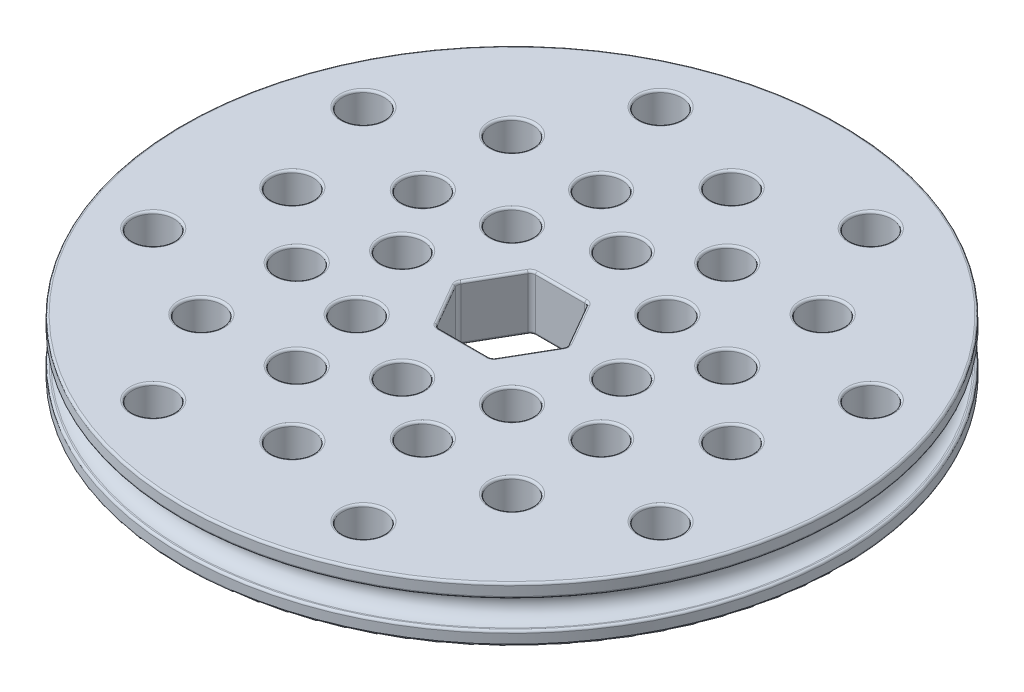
ISO-10303-21;
HEADER;
FILE_DESCRIPTION(('STEP AP214'),'2;1');
FILE_NAME('part.step','',(''),(''),'','','');
FILE_SCHEMA(('AUTOMOTIVE_DESIGN { 1 0 10303 214 1 1 1 1 }'));
ENDSEC;
DATA;
#1=APPLICATION_CONTEXT('core data for automotive mechanical design processes');
#2=APPLICATION_PROTOCOL_DEFINITION('international standard','automotive_design',2000,#1);
#3=PRODUCT_CONTEXT('',#1,'mechanical');
#4=PRODUCT('Part','Part','',(#3));
#5=PRODUCT_RELATED_PRODUCT_CATEGORY('part','',(#4));
#6=PRODUCT_DEFINITION_FORMATION('','',#4);
#7=PRODUCT_DEFINITION_CONTEXT('part definition',#1,'design');
#8=PRODUCT_DEFINITION('design','',#6,#7);
#9=PRODUCT_DEFINITION_SHAPE('','',#8);
#10=(LENGTH_UNIT() NAMED_UNIT(*) SI_UNIT(.MILLI.,.METRE.));
#11=(NAMED_UNIT(*) PLANE_ANGLE_UNIT() SI_UNIT($,.RADIAN.));
#12=(NAMED_UNIT(*) SI_UNIT($,.STERADIAN.) SOLID_ANGLE_UNIT());
#13=UNCERTAINTY_MEASURE_WITH_UNIT(LENGTH_MEASURE(1.E-05),#10,'distance_accuracy_value','');
#14=(GEOMETRIC_REPRESENTATION_CONTEXT(3) GLOBAL_UNCERTAINTY_ASSIGNED_CONTEXT((#13)) GLOBAL_UNIT_ASSIGNED_CONTEXT((#10,
#11,#12)) REPRESENTATION_CONTEXT('',''));
#15=CARTESIAN_POINT('',(0.,0.,0.));
#16=DIRECTION('',(0.,0.,1.));
#17=DIRECTION('',(1.,0.,0.));
#18=AXIS2_PLACEMENT_3D('',#15,#16,#17);
#19=CARTESIAN_POINT('',(0.,6.35,0.));
#20=DIRECTION('',(0.,-1.,0.));
#21=DIRECTION('',(0.,0.,-1.));
#22=AXIS2_PLACEMENT_3D('',#19,#20,#21);
#23=CYLINDRICAL_SURFACE('',#22,38.1);
#24=CARTESIAN_POINT('',(0.,0.254,0.));
#25=DIRECTION('',(0.,1.,0.));
#26=DIRECTION('',(0.,0.,1.));
#27=AXIS2_PLACEMENT_3D('',#24,#25,#26);
#28=CIRCLE('',#27,38.1);
#29=CARTESIAN_POINT('',(0.,0.254,38.1));
#30=VERTEX_POINT('',#29);
#31=EDGE_CURVE('E424',#30,#30,#28,.T.);
#32=ORIENTED_EDGE('',*,*,#31,.T.);
#33=EDGE_LOOP('',(#32));
#34=FACE_BOUND('',#33,.T.);
#35=CARTESIAN_POINT('',(0.,1.3335,0.));
#36=DIRECTION('',(0.,-1.,0.));
#37=DIRECTION('',(0.,0.,-1.));
#38=AXIS2_PLACEMENT_3D('',#35,#36,#37);
#39=CIRCLE('',#38,38.1);
#40=CARTESIAN_POINT('',(0.,1.3335,-38.1));
#41=VERTEX_POINT('',#40);
#42=EDGE_CURVE('E421',#41,#41,#39,.T.);
#43=ORIENTED_EDGE('',*,*,#42,.T.);
#44=EDGE_LOOP('',(#43));
#45=FACE_BOUND('',#44,.T.);
#46=ADVANCED_FACE('F38',(#34,#45),#23,.T.);
#47=CARTESIAN_POINT('',(0.,6.35,0.));
#48=DIRECTION('',(0.,1.,0.));
#49=DIRECTION('',(0.,0.,1.));
#50=AXIS2_PLACEMENT_3D('',#47,#48,#49);
#51=PLANE('',#50);
#52=CARTESIAN_POINT('',(2.8449511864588,6.35,-4.9276));
#53=DIRECTION('',(0.,1.,0.));
#54=DIRECTION('',(0.,0.,1.));
#55=AXIS2_PLACEMENT_3D('',#52,#53,#54);
#56=CIRCLE('',#55,0.889);
#57=CARTESIAN_POINT('',(3.61484777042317,6.35,-5.3721));
#58=VERTEX_POINT('',#57);
#59=CARTESIAN_POINT('',(2.8449511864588,6.35,-5.8166));
#60=VERTEX_POINT('',#59);
#61=EDGE_CURVE('E58',#58,#60,#56,.T.);
#62=ORIENTED_EDGE('',*,*,#61,.F.);
#63=DIRECTION('',(-0.5,0.,-0.866025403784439));
#64=VECTOR('',#63,1.);
#65=CARTESIAN_POINT('',(5.03732336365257,6.35,-2.9083));
#66=LINE('',#65,#64);
#67=CARTESIAN_POINT('',(6.45979895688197,6.35,-0.4445));
#68=VERTEX_POINT('',#67);
#69=EDGE_CURVE('E53',#58,#68,#66,.F.);
#70=ORIENTED_EDGE('',*,*,#69,.T.);
#71=CARTESIAN_POINT('',(5.6899023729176,6.35,0.));
#72=DIRECTION('',(0.,1.,0.));
#73=DIRECTION('',(0.,0.,1.));
#74=AXIS2_PLACEMENT_3D('',#71,#72,#73);
#75=CIRCLE('',#74,0.889);
#76=CARTESIAN_POINT('',(6.45979895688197,6.35,0.444499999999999));
#77=VERTEX_POINT('',#76);
#78=EDGE_CURVE('E747',#77,#68,#75,.T.);
#79=ORIENTED_EDGE('',*,*,#78,.F.);
#80=DIRECTION('',(0.5,0.,-0.866025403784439));
#81=VECTOR('',#80,1.);
#82=CARTESIAN_POINT('',(5.03732336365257,6.35,2.9083));
#83=LINE('',#82,#81);
#84=CARTESIAN_POINT('',(3.61484777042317,6.35,5.3721));
#85=VERTEX_POINT('',#84);
#86=EDGE_CURVE('E744',#77,#85,#83,.F.);
#87=ORIENTED_EDGE('',*,*,#86,.T.);
#88=CARTESIAN_POINT('',(2.8449511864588,6.35,4.9276));
#89=DIRECTION('',(0.,1.,0.));
#90=DIRECTION('',(0.,0.,1.));
#91=AXIS2_PLACEMENT_3D('',#88,#89,#90);
#92=CIRCLE('',#91,0.889);
#93=CARTESIAN_POINT('',(2.8449511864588,6.35,5.8166));
#94=VERTEX_POINT('',#93);
#95=EDGE_CURVE('E741',#94,#85,#92,.T.);
#96=ORIENTED_EDGE('',*,*,#95,.F.);
#97=DIRECTION('',(1.,0.,0.));
#98=VECTOR('',#97,1.);
#99=CARTESIAN_POINT('',(0.,6.35,5.8166));
#100=LINE('',#99,#98);
#101=CARTESIAN_POINT('',(-2.8449511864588,6.35,5.8166));
#102=VERTEX_POINT('',#101);
#103=EDGE_CURVE('E734',#94,#102,#100,.F.);
#104=ORIENTED_EDGE('',*,*,#103,.T.);
#105=CARTESIAN_POINT('',(-2.8449511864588,6.35,4.9276));
#106=DIRECTION('',(0.,1.,0.));
#107=DIRECTION('',(0.,0.,1.));
#108=AXIS2_PLACEMENT_3D('',#105,#106,#107);
#109=CIRCLE('',#108,0.889);
#110=CARTESIAN_POINT('',(-3.61484777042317,6.35,5.3721));
#111=VERTEX_POINT('',#110);
#112=EDGE_CURVE('E227',#111,#102,#109,.T.);
#113=ORIENTED_EDGE('',*,*,#112,.F.);
#114=DIRECTION('',(0.5,0.,0.866025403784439));
#115=VECTOR('',#114,1.);
#116=CARTESIAN_POINT('',(-5.03732336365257,6.35,2.9083));
#117=LINE('',#116,#115);
#118=CARTESIAN_POINT('',(-6.45979895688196,6.35,0.4445));
#119=VERTEX_POINT('',#118);
#120=EDGE_CURVE('E729',#111,#119,#117,.F.);
#121=ORIENTED_EDGE('',*,*,#120,.T.);
#122=CARTESIAN_POINT('',(-5.6899023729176,6.35,0.));
#123=DIRECTION('',(0.,1.,0.));
#124=DIRECTION('',(0.,0.,1.));
#125=AXIS2_PLACEMENT_3D('',#122,#123,#124);
#126=CIRCLE('',#125,0.889);
#127=CARTESIAN_POINT('',(-6.45979895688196,6.35,-0.444499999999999));
#128=VERTEX_POINT('',#127);
#129=EDGE_CURVE('E726',#128,#119,#126,.T.);
#130=ORIENTED_EDGE('',*,*,#129,.F.);
#131=DIRECTION('',(-0.5,0.,0.866025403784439));
#132=VECTOR('',#131,1.);
#133=CARTESIAN_POINT('',(-5.03732336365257,6.35,-2.9083));
#134=LINE('',#133,#132);
#135=CARTESIAN_POINT('',(-3.61484777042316,6.35,-5.3721));
#136=VERTEX_POINT('',#135);
#137=EDGE_CURVE('E731',#128,#136,#134,.F.);
#138=ORIENTED_EDGE('',*,*,#137,.T.);
#139=CARTESIAN_POINT('',(-2.8449511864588,6.35,-4.9276));
#140=DIRECTION('',(0.,1.,0.));
#141=DIRECTION('',(0.,0.,1.));
#142=AXIS2_PLACEMENT_3D('',#139,#140,#141);
#143=CIRCLE('',#142,0.889);
#144=CARTESIAN_POINT('',(-2.8449511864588,6.35,-5.8166));
#145=VERTEX_POINT('',#144);
#146=EDGE_CURVE('E736',#145,#136,#143,.T.);
#147=ORIENTED_EDGE('',*,*,#146,.F.);
#148=DIRECTION('',(-1.,0.,0.));
#149=VECTOR('',#148,1.);
#150=CARTESIAN_POINT('',(0.,6.35,-5.8166));
#151=LINE('',#150,#149);
#152=EDGE_CURVE('E739',#145,#60,#151,.F.);
#153=ORIENTED_EDGE('',*,*,#152,.T.);
#154=EDGE_LOOP('',(#62,#70,#79,#87,#96,#104,#113,#121,#130,#138,#147,#153));
#155=FACE_BOUND('',#154,.T.);
#156=CARTESIAN_POINT('',(0.,6.35,0.));
#157=DIRECTION('',(0.,1.,0.));
#158=DIRECTION('',(0.,0.,1.));
#159=AXIS2_PLACEMENT_3D('',#156,#157,#158);
#160=CIRCLE('',#159,37.846);
#161=CARTESIAN_POINT('',(0.,6.35,37.846));
#162=VERTEX_POINT('',#161);
#163=EDGE_CURVE('E723',#162,#162,#160,.T.);
#164=ORIENTED_EDGE('',*,*,#163,.T.);
#165=EDGE_LOOP('',(#164));
#166=FACE_BOUND('',#165,.T.);
#167=CARTESIAN_POINT('',(-12.7,6.35,0.));
#168=DIRECTION('',(0.,1.,0.));
#169=DIRECTION('',(0.,0.,1.));
#170=AXIS2_PLACEMENT_3D('',#167,#168,#169);
#171=CIRCLE('',#170,2.667);
#172=CARTESIAN_POINT('',(-12.7,6.35,2.667));
#173=VERTEX_POINT('',#172);
#174=EDGE_CURVE('E720',#173,#173,#171,.F.);
#175=ORIENTED_EDGE('',*,*,#174,.T.);
#176=EDGE_LOOP('',(#175));
#177=FACE_BOUND('',#176,.T.);
#178=CARTESIAN_POINT('',(-25.4,6.35,0.));
#179=DIRECTION('',(0.,1.,0.));
#180=DIRECTION('',(0.,0.,1.));
#181=AXIS2_PLACEMENT_3D('',#178,#179,#180);
#182=CIRCLE('',#181,2.667);
#183=CARTESIAN_POINT('',(-25.4,6.35,2.667));
#184=VERTEX_POINT('',#183);
#185=EDGE_CURVE('E717',#184,#184,#182,.F.);
#186=ORIENTED_EDGE('',*,*,#185,.T.);
#187=EDGE_LOOP('',(#186));
#188=FACE_BOUND('',#187,.T.);
#189=CARTESIAN_POINT('',(-29.3331751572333,6.35,-12.1501989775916));
#190=DIRECTION('',(0.,1.,0.));
#191=DIRECTION('',(0.,0.,1.));
#192=AXIS2_PLACEMENT_3D('',#189,#190,#191);
#193=CIRCLE('',#192,2.667);
#194=CARTESIAN_POINT('',(-29.3331751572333,6.35,-9.48319897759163));
#195=VERTEX_POINT('',#194);
#196=EDGE_CURVE('E714',#195,#195,#193,.F.);
#197=ORIENTED_EDGE('',*,*,#196,.T.);
#198=EDGE_LOOP('',(#197));
#199=FACE_BOUND('',#198,.T.);
#200=CARTESIAN_POINT('',(-17.59990509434,6.35,-7.29011938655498));
#201=DIRECTION('',(0.,1.,0.));
#202=DIRECTION('',(0.,0.,1.));
#203=AXIS2_PLACEMENT_3D('',#200,#201,#202);
#204=CIRCLE('',#203,2.667);
#205=CARTESIAN_POINT('',(-17.59990509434,6.35,-4.62311938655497));
#206=VERTEX_POINT('',#205);
#207=EDGE_CURVE('E711',#206,#206,#204,.F.);
#208=ORIENTED_EDGE('',*,*,#207,.T.);
#209=EDGE_LOOP('',(#208));
#210=FACE_BOUND('',#209,.T.);
#211=CARTESIAN_POINT('',(-7.29011938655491,6.35,-17.59990509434));
#212=DIRECTION('',(0.,1.,0.));
#213=DIRECTION('',(0.,0.,1.));
#214=AXIS2_PLACEMENT_3D('',#211,#212,#213);
#215=CIRCLE('',#214,2.667);
#216=CARTESIAN_POINT('',(-7.29011938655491,6.35,-14.93290509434));
#217=VERTEX_POINT('',#216);
#218=EDGE_CURVE('E708',#217,#217,#215,.F.);
#219=ORIENTED_EDGE('',*,*,#218,.T.);
#220=EDGE_LOOP('',(#219));
#221=FACE_BOUND('',#220,.T.);
#222=CARTESIAN_POINT('',(7.29011938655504,6.35,-17.59990509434));
#223=DIRECTION('',(0.,1.,0.));
#224=DIRECTION('',(0.,0.,1.));
#225=AXIS2_PLACEMENT_3D('',#222,#223,#224);
#226=CIRCLE('',#225,2.667);
#227=CARTESIAN_POINT('',(7.29011938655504,6.35,-14.93290509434));
#228=VERTEX_POINT('',#227);
#229=EDGE_CURVE('E705',#228,#228,#226,.F.);
#230=ORIENTED_EDGE('',*,*,#229,.T.);
#231=EDGE_LOOP('',(#230));
#232=FACE_BOUND('',#231,.T.);
#233=CARTESIAN_POINT('',(17.5999050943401,6.35,-7.29011938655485));
#234=DIRECTION('',(0.,1.,0.));
#235=DIRECTION('',(0.,0.,1.));
#236=AXIS2_PLACEMENT_3D('',#233,#234,#235);
#237=CIRCLE('',#236,2.667);
#238=CARTESIAN_POINT('',(17.5999050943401,6.35,-4.62311938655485));
#239=VERTEX_POINT('',#238);
#240=EDGE_CURVE('E702',#239,#239,#237,.F.);
#241=ORIENTED_EDGE('',*,*,#240,.T.);
#242=EDGE_LOOP('',(#241));
#243=FACE_BOUND('',#242,.T.);
#244=CARTESIAN_POINT('',(17.59990509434,6.35,7.2901193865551));
#245=DIRECTION('',(0.,1.,0.));
#246=DIRECTION('',(0.,0.,1.));
#247=AXIS2_PLACEMENT_3D('',#244,#245,#246);
#248=CIRCLE('',#247,2.667);
#249=CARTESIAN_POINT('',(17.59990509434,6.35,9.9571193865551));
#250=VERTEX_POINT('',#249);
#251=EDGE_CURVE('E699',#250,#250,#248,.F.);
#252=ORIENTED_EDGE('',*,*,#251,.T.);
#253=EDGE_LOOP('',(#252));
#254=FACE_BOUND('',#253,.T.);
#255=CARTESIAN_POINT('',(7.29011938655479,6.35,17.5999050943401));
#256=DIRECTION('',(0.,1.,0.));
#257=DIRECTION('',(0.,0.,1.));
#258=AXIS2_PLACEMENT_3D('',#255,#256,#257);
#259=CIRCLE('',#258,2.667);
#260=CARTESIAN_POINT('',(7.29011938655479,6.35,20.2669050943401));
#261=VERTEX_POINT('',#260);
#262=EDGE_CURVE('E696',#261,#261,#259,.F.);
#263=ORIENTED_EDGE('',*,*,#262,.T.);
#264=EDGE_LOOP('',(#263));
#265=FACE_BOUND('',#264,.T.);
#266=CARTESIAN_POINT('',(-7.29011938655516,6.35,17.5999050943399));
#267=DIRECTION('',(0.,1.,0.));
#268=DIRECTION('',(0.,0.,1.));
#269=AXIS2_PLACEMENT_3D('',#266,#267,#268);
#270=CIRCLE('',#269,2.667);
#271=CARTESIAN_POINT('',(-7.29011938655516,6.35,20.2669050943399));
#272=VERTEX_POINT('',#271);
#273=EDGE_CURVE('E693',#272,#272,#270,.F.);
#274=ORIENTED_EDGE('',*,*,#273,.T.);
#275=EDGE_LOOP('',(#274));
#276=FACE_BOUND('',#275,.T.);
#277=CARTESIAN_POINT('',(-17.5999050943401,6.35,7.29011938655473));
#278=DIRECTION('',(0.,1.,0.));
#279=DIRECTION('',(0.,0.,1.));
#280=AXIS2_PLACEMENT_3D('',#277,#278,#279);
#281=CIRCLE('',#280,2.667);
#282=CARTESIAN_POINT('',(-17.5999050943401,6.35,9.95711938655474));
#283=VERTEX_POINT('',#282);
#284=EDGE_CURVE('E690',#283,#283,#281,.F.);
#285=ORIENTED_EDGE('',*,*,#284,.T.);
#286=EDGE_LOOP('',(#285));
#287=FACE_BOUND('',#286,.T.);
#288=CARTESIAN_POINT('',(-8.98025612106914,6.35,-8.98025612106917));
#289=DIRECTION('',(0.,1.,0.));
#290=DIRECTION('',(0.,0.,1.));
#291=AXIS2_PLACEMENT_3D('',#288,#289,#290);
#292=CIRCLE('',#291,2.667);
#293=CARTESIAN_POINT('',(-8.98025612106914,6.35,-6.31325612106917));
#294=VERTEX_POINT('',#293);
#295=EDGE_CURVE('E687',#294,#294,#292,.F.);
#296=ORIENTED_EDGE('',*,*,#295,.T.);
#297=EDGE_LOOP('',(#296));
#298=FACE_BOUND('',#297,.T.);
#299=CARTESIAN_POINT('',(0.,6.35,-12.7));
#300=DIRECTION('',(0.,1.,0.));
#301=DIRECTION('',(0.,0.,1.));
#302=AXIS2_PLACEMENT_3D('',#299,#300,#301);
#303=CIRCLE('',#302,2.667);
#304=CARTESIAN_POINT('',(0.,6.35,-10.033));
#305=VERTEX_POINT('',#304);
#306=EDGE_CURVE('E684',#305,#305,#303,.F.);
#307=ORIENTED_EDGE('',*,*,#306,.T.);
#308=EDGE_LOOP('',(#307));
#309=FACE_BOUND('',#308,.T.);
#310=CARTESIAN_POINT('',(8.9802561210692,6.35,-8.98025612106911));
#311=DIRECTION('',(0.,1.,0.));
#312=DIRECTION('',(0.,0.,1.));
#313=AXIS2_PLACEMENT_3D('',#310,#311,#312);
#314=CIRCLE('',#313,2.667);
#315=CARTESIAN_POINT('',(8.9802561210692,6.35,-6.3132561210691));
#316=VERTEX_POINT('',#315);
#317=EDGE_CURVE('E681',#316,#316,#314,.F.);
#318=ORIENTED_EDGE('',*,*,#317,.T.);
#319=EDGE_LOOP('',(#318));
#320=FACE_BOUND('',#319,.T.);
#321=CARTESIAN_POINT('',(12.7,6.35,0.));
#322=DIRECTION('',(0.,1.,0.));
#323=DIRECTION('',(0.,0.,1.));
#324=AXIS2_PLACEMENT_3D('',#321,#322,#323);
#325=CIRCLE('',#324,2.667);
#326=CARTESIAN_POINT('',(12.7,6.35,2.66700000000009));
#327=VERTEX_POINT('',#326);
#328=EDGE_CURVE('E678',#327,#327,#325,.F.);
#329=ORIENTED_EDGE('',*,*,#328,.T.);
#330=EDGE_LOOP('',(#329));
#331=FACE_BOUND('',#330,.T.);
#332=CARTESIAN_POINT('',(8.98025612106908,6.35,8.98025612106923));
#333=DIRECTION('',(0.,1.,0.));
#334=DIRECTION('',(0.,0.,1.));
#335=AXIS2_PLACEMENT_3D('',#332,#333,#334);
#336=CIRCLE('',#335,2.667);
#337=CARTESIAN_POINT('',(8.98025612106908,6.35,11.6472561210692));
#338=VERTEX_POINT('',#337);
#339=EDGE_CURVE('E675',#338,#338,#336,.F.);
#340=ORIENTED_EDGE('',*,*,#339,.T.);
#341=EDGE_LOOP('',(#340));
#342=FACE_BOUND('',#341,.T.);
#343=CARTESIAN_POINT('',(-1.33025516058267E-13,6.35,12.7));
#344=DIRECTION('',(0.,1.,0.));
#345=DIRECTION('',(0.,0.,1.));
#346=AXIS2_PLACEMENT_3D('',#343,#344,#345);
#347=CIRCLE('',#346,2.667);
#348=CARTESIAN_POINT('',(-1.33025516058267E-13,6.35,15.367));
#349=VERTEX_POINT('',#348);
#350=EDGE_CURVE('E672',#349,#349,#347,.F.);
#351=ORIENTED_EDGE('',*,*,#350,.T.);
#352=EDGE_LOOP('',(#351));
#353=FACE_BOUND('',#352,.T.);
#354=CARTESIAN_POINT('',(-8.98025612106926,6.35,8.98025612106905));
#355=DIRECTION('',(0.,1.,0.));
#356=DIRECTION('',(0.,0.,1.));
#357=AXIS2_PLACEMENT_3D('',#354,#355,#356);
#358=CIRCLE('',#357,2.667);
#359=CARTESIAN_POINT('',(-8.98025612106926,6.35,11.647256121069));
#360=VERTEX_POINT('',#359);
#361=EDGE_CURVE('E669',#360,#360,#358,.F.);
#362=ORIENTED_EDGE('',*,*,#361,.T.);
#363=EDGE_LOOP('',(#362));
#364=FACE_BOUND('',#363,.T.);
#365=CARTESIAN_POINT('',(-17.9605122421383,6.35,-17.9605122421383));
#366=DIRECTION('',(0.,1.,0.));
#367=DIRECTION('',(0.,0.,1.));
#368=AXIS2_PLACEMENT_3D('',#365,#366,#367);
#369=CIRCLE('',#368,2.667);
#370=CARTESIAN_POINT('',(-17.9605122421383,6.35,-15.2935122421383));
#371=VERTEX_POINT('',#370);
#372=EDGE_CURVE('E666',#371,#371,#369,.F.);
#373=ORIENTED_EDGE('',*,*,#372,.T.);
#374=EDGE_LOOP('',(#373));
#375=FACE_BOUND('',#374,.T.);
#376=CARTESIAN_POINT('',(0.,6.35,-25.4));
#377=DIRECTION('',(0.,1.,0.));
#378=DIRECTION('',(0.,0.,1.));
#379=AXIS2_PLACEMENT_3D('',#376,#377,#378);
#380=CIRCLE('',#379,2.667);
#381=CARTESIAN_POINT('',(0.,6.35,-22.733));
#382=VERTEX_POINT('',#381);
#383=EDGE_CURVE('E663',#382,#382,#380,.F.);
#384=ORIENTED_EDGE('',*,*,#383,.T.);
#385=EDGE_LOOP('',(#384));
#386=FACE_BOUND('',#385,.T.);
#387=CARTESIAN_POINT('',(17.9605122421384,6.35,-17.9605122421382));
#388=DIRECTION('',(0.,1.,0.));
#389=DIRECTION('',(0.,0.,1.));
#390=AXIS2_PLACEMENT_3D('',#387,#388,#389);
#391=CIRCLE('',#390,2.667);
#392=CARTESIAN_POINT('',(17.9605122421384,6.35,-15.2935122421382));
#393=VERTEX_POINT('',#392);
#394=EDGE_CURVE('E660',#393,#393,#391,.F.);
#395=ORIENTED_EDGE('',*,*,#394,.T.);
#396=EDGE_LOOP('',(#395));
#397=FACE_BOUND('',#396,.T.);
#398=CARTESIAN_POINT('',(25.4,6.35,1.77367354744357E-13));
#399=DIRECTION('',(0.,1.,0.));
#400=DIRECTION('',(0.,0.,1.));
#401=AXIS2_PLACEMENT_3D('',#398,#399,#400);
#402=CIRCLE('',#401,2.667);
#403=CARTESIAN_POINT('',(25.4,6.35,2.66700000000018));
#404=VERTEX_POINT('',#403);
#405=EDGE_CURVE('E657',#404,#404,#402,.F.);
#406=ORIENTED_EDGE('',*,*,#405,.T.);
#407=EDGE_LOOP('',(#406));
#408=FACE_BOUND('',#407,.T.);
#409=CARTESIAN_POINT('',(17.9605122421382,6.35,17.9605122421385));
#410=DIRECTION('',(0.,1.,0.));
#411=DIRECTION('',(0.,0.,1.));
#412=AXIS2_PLACEMENT_3D('',#409,#410,#411);
#413=CIRCLE('',#412,2.667);
#414=CARTESIAN_POINT('',(17.9605122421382,6.35,20.6275122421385));
#415=VERTEX_POINT('',#414);
#416=EDGE_CURVE('E654',#415,#415,#413,.F.);
#417=ORIENTED_EDGE('',*,*,#416,.T.);
#418=EDGE_LOOP('',(#417));
#419=FACE_BOUND('',#418,.T.);
#420=CARTESIAN_POINT('',(-2.66051032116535E-13,6.35,25.4));
#421=DIRECTION('',(0.,1.,0.));
#422=DIRECTION('',(0.,0.,1.));
#423=AXIS2_PLACEMENT_3D('',#420,#421,#422);
#424=CIRCLE('',#423,2.667);
#425=CARTESIAN_POINT('',(-2.66051032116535E-13,6.35,28.067));
#426=VERTEX_POINT('',#425);
#427=EDGE_CURVE('E651',#426,#426,#424,.F.);
#428=ORIENTED_EDGE('',*,*,#427,.T.);
#429=EDGE_LOOP('',(#428));
#430=FACE_BOUND('',#429,.T.);
#431=CARTESIAN_POINT('',(-17.9605122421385,6.35,17.9605122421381));
#432=DIRECTION('',(0.,1.,0.));
#433=DIRECTION('',(0.,0.,1.));
#434=AXIS2_PLACEMENT_3D('',#431,#432,#433);
#435=CIRCLE('',#434,2.667);
#436=CARTESIAN_POINT('',(-17.9605122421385,6.35,20.6275122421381));
#437=VERTEX_POINT('',#436);
#438=EDGE_CURVE('E648',#437,#437,#435,.F.);
#439=ORIENTED_EDGE('',*,*,#438,.T.);
#440=EDGE_LOOP('',(#439));
#441=FACE_BOUND('',#440,.T.);
#442=CARTESIAN_POINT('',(-12.1501989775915,6.35,-29.3331751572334));
#443=DIRECTION('',(0.,1.,0.));
#444=DIRECTION('',(0.,0.,1.));
#445=AXIS2_PLACEMENT_3D('',#442,#443,#444);
#446=CIRCLE('',#445,2.667);
#447=CARTESIAN_POINT('',(-12.1501989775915,6.35,-26.6661751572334));
#448=VERTEX_POINT('',#447);
#449=EDGE_CURVE('E645',#448,#448,#446,.F.);
#450=ORIENTED_EDGE('',*,*,#449,.T.);
#451=EDGE_LOOP('',(#450));
#452=FACE_BOUND('',#451,.T.);
#453=CARTESIAN_POINT('',(12.1501989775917,6.35,-29.3331751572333));
#454=DIRECTION('',(0.,1.,0.));
#455=DIRECTION('',(0.,0.,1.));
#456=AXIS2_PLACEMENT_3D('',#453,#454,#455);
#457=CIRCLE('',#456,2.667);
#458=CARTESIAN_POINT('',(12.1501989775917,6.35,-26.6661751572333));
#459=VERTEX_POINT('',#458);
#460=EDGE_CURVE('E642',#459,#459,#457,.F.);
#461=ORIENTED_EDGE('',*,*,#460,.T.);
#462=EDGE_LOOP('',(#461));
#463=FACE_BOUND('',#462,.T.);
#464=CARTESIAN_POINT('',(29.3331751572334,6.35,-12.1501989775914));
#465=DIRECTION('',(0.,1.,0.));
#466=DIRECTION('',(0.,0.,1.));
#467=AXIS2_PLACEMENT_3D('',#464,#465,#466);
#468=CIRCLE('',#467,2.667);
#469=CARTESIAN_POINT('',(29.3331751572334,6.35,-9.48319897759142));
#470=VERTEX_POINT('',#469);
#471=EDGE_CURVE('E639',#470,#470,#468,.F.);
#472=ORIENTED_EDGE('',*,*,#471,.T.);
#473=EDGE_LOOP('',(#472));
#474=FACE_BOUND('',#473,.T.);
#475=CARTESIAN_POINT('',(29.3331751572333,6.35,12.1501989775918));
#476=DIRECTION('',(0.,1.,0.));
#477=DIRECTION('',(0.,0.,1.));
#478=AXIS2_PLACEMENT_3D('',#475,#476,#477);
#479=CIRCLE('',#478,2.667);
#480=CARTESIAN_POINT('',(29.3331751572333,6.35,14.8171989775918));
#481=VERTEX_POINT('',#480);
#482=EDGE_CURVE('E636',#481,#481,#479,.F.);
#483=ORIENTED_EDGE('',*,*,#482,.T.);
#484=EDGE_LOOP('',(#483));
#485=FACE_BOUND('',#484,.T.);
#486=CARTESIAN_POINT('',(12.1501989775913,6.35,29.3331751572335));
#487=DIRECTION('',(0.,1.,0.));
#488=DIRECTION('',(0.,0.,1.));
#489=AXIS2_PLACEMENT_3D('',#486,#487,#488);
#490=CIRCLE('',#489,2.667);
#491=CARTESIAN_POINT('',(12.1501989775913,6.35,32.0001751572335));
#492=VERTEX_POINT('',#491);
#493=EDGE_CURVE('E633',#492,#492,#490,.F.);
#494=ORIENTED_EDGE('',*,*,#493,.T.);
#495=EDGE_LOOP('',(#494));
#496=FACE_BOUND('',#495,.T.);
#497=CARTESIAN_POINT('',(-12.1501989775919,6.35,29.3331751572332));
#498=DIRECTION('',(0.,1.,0.));
#499=DIRECTION('',(0.,0.,1.));
#500=AXIS2_PLACEMENT_3D('',#497,#498,#499);
#501=CIRCLE('',#500,2.667);
#502=CARTESIAN_POINT('',(-12.1501989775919,6.35,32.0001751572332));
#503=VERTEX_POINT('',#502);
#504=EDGE_CURVE('E630',#503,#503,#501,.F.);
#505=ORIENTED_EDGE('',*,*,#504,.T.);
#506=EDGE_LOOP('',(#505));
#507=FACE_BOUND('',#506,.T.);
#508=CARTESIAN_POINT('',(-29.3331751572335,6.35,12.1501989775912));
#509=DIRECTION('',(0.,1.,0.));
#510=DIRECTION('',(0.,0.,1.));
#511=AXIS2_PLACEMENT_3D('',#508,#509,#510);
#512=CIRCLE('',#511,2.667);
#513=CARTESIAN_POINT('',(-29.3331751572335,6.35,14.8171989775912));
#514=VERTEX_POINT('',#513);
#515=EDGE_CURVE('E627',#514,#514,#512,.F.);
#516=ORIENTED_EDGE('',*,*,#515,.T.);
#517=EDGE_LOOP('',(#516));
#518=FACE_BOUND('',#517,.T.);
#519=ADVANCED_FACE('F780',(#155,#166,#177,#188,#199,#210,#221,#232,#243,#254,#265,#276,#287,
#298,#309,#320,#331,#342,#353,#364,#375,#386,#397,#408,#419,#430,#441,#452,#463,#474,#485,#496,
#507,#518),#51,.T.);
#520=CARTESIAN_POINT('',(0.,0.,0.));
#521=DIRECTION('',(0.,1.,0.));
#522=DIRECTION('',(0.,0.,1.));
#523=AXIS2_PLACEMENT_3D('',#520,#521,#522);
#524=PLANE('',#523);
#525=CARTESIAN_POINT('',(2.8449511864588,0.,4.9276));
#526=DIRECTION('',(0.,1.,0.));
#527=DIRECTION('',(0.,0.,1.));
#528=AXIS2_PLACEMENT_3D('',#525,#526,#527);
#529=CIRCLE('',#528,0.889);
#530=CARTESIAN_POINT('',(3.61484777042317,0.,5.3721));
#531=VERTEX_POINT('',#530);
#532=CARTESIAN_POINT('',(2.8449511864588,0.,5.8166));
#533=VERTEX_POINT('',#532);
#534=EDGE_CURVE('E413',#531,#533,#529,.F.);
#535=ORIENTED_EDGE('',*,*,#534,.F.);
#536=DIRECTION('',(0.5,0.,-0.866025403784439));
#537=VECTOR('',#536,1.);
#538=CARTESIAN_POINT('',(6.64310766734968,0.,0.127));
#539=LINE('',#538,#537);
#540=CARTESIAN_POINT('',(6.45979895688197,0.,0.444499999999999));
#541=VERTEX_POINT('',#540);
#542=EDGE_CURVE('E419',#531,#541,#539,.T.);
#543=ORIENTED_EDGE('',*,*,#542,.T.);
#544=CARTESIAN_POINT('',(5.6899023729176,0.,0.));
#545=DIRECTION('',(0.,1.,0.));
#546=DIRECTION('',(0.,0.,1.));
#547=AXIS2_PLACEMENT_3D('',#544,#545,#546);
#548=CIRCLE('',#547,0.889);
#549=CARTESIAN_POINT('',(6.45979895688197,0.,-0.4445));
#550=VERTEX_POINT('',#549);
#551=EDGE_CURVE('E416',#550,#541,#548,.F.);
#552=ORIENTED_EDGE('',*,*,#551,.F.);
#553=DIRECTION('',(-0.5,0.,-0.866025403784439));
#554=VECTOR('',#553,1.);
#555=CARTESIAN_POINT('',(3.43153905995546,0.,-5.6896));
#556=LINE('',#555,#554);
#557=CARTESIAN_POINT('',(3.61484777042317,0.,-5.3721));
#558=VERTEX_POINT('',#557);
#559=EDGE_CURVE('E411',#550,#558,#556,.T.);
#560=ORIENTED_EDGE('',*,*,#559,.T.);
#561=CARTESIAN_POINT('',(2.8449511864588,0.,-4.9276));
#562=DIRECTION('',(0.,1.,0.));
#563=DIRECTION('',(0.,0.,1.));
#564=AXIS2_PLACEMENT_3D('',#561,#562,#563);
#565=CIRCLE('',#564,0.889);
#566=CARTESIAN_POINT('',(2.8449511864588,0.,-5.8166));
#567=VERTEX_POINT('',#566);
#568=EDGE_CURVE('E408',#567,#558,#565,.F.);
#569=ORIENTED_EDGE('',*,*,#568,.F.);
#570=DIRECTION('',(-1.,0.,0.));
#571=VECTOR('',#570,1.);
#572=CARTESIAN_POINT('',(-3.21156860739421,0.,-5.8166));
#573=LINE('',#572,#571);
#574=CARTESIAN_POINT('',(-2.8449511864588,0.,-5.8166));
#575=VERTEX_POINT('',#574);
#576=EDGE_CURVE('E400',#567,#575,#573,.T.);
#577=ORIENTED_EDGE('',*,*,#576,.T.);
#578=CARTESIAN_POINT('',(-2.8449511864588,0.,-4.9276));
#579=DIRECTION('',(0.,1.,0.));
#580=DIRECTION('',(0.,0.,1.));
#581=AXIS2_PLACEMENT_3D('',#578,#579,#580);
#582=CIRCLE('',#581,0.889);
#583=CARTESIAN_POINT('',(-3.61484777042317,0.,-5.3721));
#584=VERTEX_POINT('',#583);
#585=EDGE_CURVE('E397',#584,#575,#582,.F.);
#586=ORIENTED_EDGE('',*,*,#585,.F.);
#587=DIRECTION('',(-0.5,0.,0.866025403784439));
#588=VECTOR('',#587,1.);
#589=CARTESIAN_POINT('',(-6.64310766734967,0.,-0.126999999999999));
#590=LINE('',#589,#588);
#591=CARTESIAN_POINT('',(-6.45979895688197,0.,-0.444499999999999));
#592=VERTEX_POINT('',#591);
#593=EDGE_CURVE('E393',#584,#592,#590,.T.);
#594=ORIENTED_EDGE('',*,*,#593,.T.);
#595=CARTESIAN_POINT('',(-5.6899023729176,0.,0.));
#596=DIRECTION('',(0.,1.,0.));
#597=DIRECTION('',(0.,0.,1.));
#598=AXIS2_PLACEMENT_3D('',#595,#596,#597);
#599=CIRCLE('',#598,0.889);
#600=CARTESIAN_POINT('',(-6.45979895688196,0.,0.444500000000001));
#601=VERTEX_POINT('',#600);
#602=EDGE_CURVE('E390',#601,#592,#599,.F.);
#603=ORIENTED_EDGE('',*,*,#602,.F.);
#604=DIRECTION('',(0.5,0.,0.866025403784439));
#605=VECTOR('',#604,1.);
#606=CARTESIAN_POINT('',(-3.43153905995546,0.,5.6896));
#607=LINE('',#606,#605);
#608=CARTESIAN_POINT('',(-3.61484777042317,0.,5.3721));
#609=VERTEX_POINT('',#608);
#610=EDGE_CURVE('E395',#601,#609,#607,.T.);
#611=ORIENTED_EDGE('',*,*,#610,.T.);
#612=CARTESIAN_POINT('',(-2.8449511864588,0.,4.9276));
#613=DIRECTION('',(0.,1.,0.));
#614=DIRECTION('',(0.,0.,1.));
#615=AXIS2_PLACEMENT_3D('',#612,#613,#614);
#616=CIRCLE('',#615,0.889);
#617=CARTESIAN_POINT('',(-2.8449511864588,0.,5.8166));
#618=VERTEX_POINT('',#617);
#619=EDGE_CURVE('E403',#618,#609,#616,.F.);
#620=ORIENTED_EDGE('',*,*,#619,.F.);
#621=DIRECTION('',(1.,0.,0.));
#622=VECTOR('',#621,1.);
#623=CARTESIAN_POINT('',(3.21156860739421,0.,5.8166));
#624=LINE('',#623,#622);
#625=EDGE_CURVE('E406',#618,#533,#624,.T.);
#626=ORIENTED_EDGE('',*,*,#625,.T.);
#627=EDGE_LOOP('',(#535,#543,#552,#560,#569,#577,#586,#594,#603,#611,#620,#626));
#628=FACE_BOUND('',#627,.T.);
#629=CARTESIAN_POINT('',(0.,0.,0.));
#630=DIRECTION('',(0.,1.,0.));
#631=DIRECTION('',(0.,0.,1.));
#632=AXIS2_PLACEMENT_3D('',#629,#630,#631);
#633=CIRCLE('',#632,37.846);
#634=CARTESIAN_POINT('',(0.,0.,37.846));
#635=VERTEX_POINT('',#634);
#636=EDGE_CURVE('E387',#635,#635,#633,.F.);
#637=ORIENTED_EDGE('',*,*,#636,.T.);
#638=EDGE_LOOP('',(#637));
#639=FACE_BOUND('',#638,.T.);
#640=CARTESIAN_POINT('',(-12.7,0.,0.));
#641=DIRECTION('',(0.,1.,0.));
#642=DIRECTION('',(0.,0.,1.));
#643=AXIS2_PLACEMENT_3D('',#640,#641,#642);
#644=CIRCLE('',#643,2.667);
#645=CARTESIAN_POINT('',(-12.7,0.,2.667));
#646=VERTEX_POINT('',#645);
#647=EDGE_CURVE('E384',#646,#646,#644,.T.);
#648=ORIENTED_EDGE('',*,*,#647,.T.);
#649=EDGE_LOOP('',(#648));
#650=FACE_BOUND('',#649,.T.);
#651=CARTESIAN_POINT('',(-25.4,0.,0.));
#652=DIRECTION('',(0.,1.,0.));
#653=DIRECTION('',(0.,0.,1.));
#654=AXIS2_PLACEMENT_3D('',#651,#652,#653);
#655=CIRCLE('',#654,2.667);
#656=CARTESIAN_POINT('',(-25.4,0.,2.667));
#657=VERTEX_POINT('',#656);
#658=EDGE_CURVE('E381',#657,#657,#655,.T.);
#659=ORIENTED_EDGE('',*,*,#658,.T.);
#660=EDGE_LOOP('',(#659));
#661=FACE_BOUND('',#660,.T.);
#662=CARTESIAN_POINT('',(-29.3331751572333,0.,-12.1501989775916));
#663=DIRECTION('',(0.,1.,0.));
#664=DIRECTION('',(0.,0.,1.));
#665=AXIS2_PLACEMENT_3D('',#662,#663,#664);
#666=CIRCLE('',#665,2.667);
#667=CARTESIAN_POINT('',(-29.3331751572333,0.,-9.48319897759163));
#668=VERTEX_POINT('',#667);
#669=EDGE_CURVE('E378',#668,#668,#666,.T.);
#670=ORIENTED_EDGE('',*,*,#669,.T.);
#671=EDGE_LOOP('',(#670));
#672=FACE_BOUND('',#671,.T.);
#673=CARTESIAN_POINT('',(-17.59990509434,0.,-7.29011938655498));
#674=DIRECTION('',(0.,1.,0.));
#675=DIRECTION('',(0.,0.,1.));
#676=AXIS2_PLACEMENT_3D('',#673,#674,#675);
#677=CIRCLE('',#676,2.667);
#678=CARTESIAN_POINT('',(-17.59990509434,0.,-4.62311938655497));
#679=VERTEX_POINT('',#678);
#680=EDGE_CURVE('E375',#679,#679,#677,.T.);
#681=ORIENTED_EDGE('',*,*,#680,.T.);
#682=EDGE_LOOP('',(#681));
#683=FACE_BOUND('',#682,.T.);
#684=CARTESIAN_POINT('',(-7.29011938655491,0.,-17.59990509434));
#685=DIRECTION('',(0.,1.,0.));
#686=DIRECTION('',(0.,0.,1.));
#687=AXIS2_PLACEMENT_3D('',#684,#685,#686);
#688=CIRCLE('',#687,2.667);
#689=CARTESIAN_POINT('',(-7.29011938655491,0.,-14.93290509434));
#690=VERTEX_POINT('',#689);
#691=EDGE_CURVE('E372',#690,#690,#688,.T.);
#692=ORIENTED_EDGE('',*,*,#691,.T.);
#693=EDGE_LOOP('',(#692));
#694=FACE_BOUND('',#693,.T.);
#695=CARTESIAN_POINT('',(7.29011938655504,0.,-17.59990509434));
#696=DIRECTION('',(0.,1.,0.));
#697=DIRECTION('',(0.,0.,1.));
#698=AXIS2_PLACEMENT_3D('',#695,#696,#697);
#699=CIRCLE('',#698,2.667);
#700=CARTESIAN_POINT('',(7.29011938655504,0.,-14.93290509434));
#701=VERTEX_POINT('',#700);
#702=EDGE_CURVE('E369',#701,#701,#699,.T.);
#703=ORIENTED_EDGE('',*,*,#702,.T.);
#704=EDGE_LOOP('',(#703));
#705=FACE_BOUND('',#704,.T.);
#706=CARTESIAN_POINT('',(17.5999050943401,0.,-7.29011938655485));
#707=DIRECTION('',(0.,1.,0.));
#708=DIRECTION('',(0.,0.,1.));
#709=AXIS2_PLACEMENT_3D('',#706,#707,#708);
#710=CIRCLE('',#709,2.667);
#711=CARTESIAN_POINT('',(17.5999050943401,0.,-4.62311938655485));
#712=VERTEX_POINT('',#711);
#713=EDGE_CURVE('E366',#712,#712,#710,.T.);
#714=ORIENTED_EDGE('',*,*,#713,.T.);
#715=EDGE_LOOP('',(#714));
#716=FACE_BOUND('',#715,.T.);
#717=CARTESIAN_POINT('',(17.59990509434,0.,7.2901193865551));
#718=DIRECTION('',(0.,1.,0.));
#719=DIRECTION('',(0.,0.,1.));
#720=AXIS2_PLACEMENT_3D('',#717,#718,#719);
#721=CIRCLE('',#720,2.667);
#722=CARTESIAN_POINT('',(17.59990509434,0.,9.9571193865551));
#723=VERTEX_POINT('',#722);
#724=EDGE_CURVE('E363',#723,#723,#721,.T.);
#725=ORIENTED_EDGE('',*,*,#724,.T.);
#726=EDGE_LOOP('',(#725));
#727=FACE_BOUND('',#726,.T.);
#728=CARTESIAN_POINT('',(7.29011938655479,0.,17.5999050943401));
#729=DIRECTION('',(0.,1.,0.));
#730=DIRECTION('',(0.,0.,1.));
#731=AXIS2_PLACEMENT_3D('',#728,#729,#730);
#732=CIRCLE('',#731,2.667);
#733=CARTESIAN_POINT('',(7.29011938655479,0.,20.2669050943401));
#734=VERTEX_POINT('',#733);
#735=EDGE_CURVE('E360',#734,#734,#732,.T.);
#736=ORIENTED_EDGE('',*,*,#735,.T.);
#737=EDGE_LOOP('',(#736));
#738=FACE_BOUND('',#737,.T.);
#739=CARTESIAN_POINT('',(-7.29011938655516,0.,17.5999050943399));
#740=DIRECTION('',(0.,1.,0.));
#741=DIRECTION('',(0.,0.,1.));
#742=AXIS2_PLACEMENT_3D('',#739,#740,#741);
#743=CIRCLE('',#742,2.667);
#744=CARTESIAN_POINT('',(-7.29011938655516,0.,20.2669050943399));
#745=VERTEX_POINT('',#744);
#746=EDGE_CURVE('E357',#745,#745,#743,.T.);
#747=ORIENTED_EDGE('',*,*,#746,.T.);
#748=EDGE_LOOP('',(#747));
#749=FACE_BOUND('',#748,.T.);
#750=CARTESIAN_POINT('',(-17.5999050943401,0.,7.29011938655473));
#751=DIRECTION('',(0.,1.,0.));
#752=DIRECTION('',(0.,0.,1.));
#753=AXIS2_PLACEMENT_3D('',#750,#751,#752);
#754=CIRCLE('',#753,2.667);
#755=CARTESIAN_POINT('',(-17.5999050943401,0.,9.95711938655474));
#756=VERTEX_POINT('',#755);
#757=EDGE_CURVE('E354',#756,#756,#754,.T.);
#758=ORIENTED_EDGE('',*,*,#757,.T.);
#759=EDGE_LOOP('',(#758));
#760=FACE_BOUND('',#759,.T.);
#761=CARTESIAN_POINT('',(-8.98025612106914,0.,-8.98025612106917));
#762=DIRECTION('',(0.,1.,0.));
#763=DIRECTION('',(0.,0.,1.));
#764=AXIS2_PLACEMENT_3D('',#761,#762,#763);
#765=CIRCLE('',#764,2.667);
#766=CARTESIAN_POINT('',(-8.98025612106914,0.,-6.31325612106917));
#767=VERTEX_POINT('',#766);
#768=EDGE_CURVE('E351',#767,#767,#765,.T.);
#769=ORIENTED_EDGE('',*,*,#768,.T.);
#770=EDGE_LOOP('',(#769));
#771=FACE_BOUND('',#770,.T.);
#772=CARTESIAN_POINT('',(0.,0.,-12.7));
#773=DIRECTION('',(0.,1.,0.));
#774=DIRECTION('',(0.,0.,1.));
#775=AXIS2_PLACEMENT_3D('',#772,#773,#774);
#776=CIRCLE('',#775,2.667);
#777=CARTESIAN_POINT('',(0.,0.,-10.033));
#778=VERTEX_POINT('',#777);
#779=EDGE_CURVE('E348',#778,#778,#776,.T.);
#780=ORIENTED_EDGE('',*,*,#779,.T.);
#781=EDGE_LOOP('',(#780));
#782=FACE_BOUND('',#781,.T.);
#783=CARTESIAN_POINT('',(8.9802561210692,0.,-8.98025612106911));
#784=DIRECTION('',(0.,1.,0.));
#785=DIRECTION('',(0.,0.,1.));
#786=AXIS2_PLACEMENT_3D('',#783,#784,#785);
#787=CIRCLE('',#786,2.667);
#788=CARTESIAN_POINT('',(8.9802561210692,0.,-6.3132561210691));
#789=VERTEX_POINT('',#788);
#790=EDGE_CURVE('E345',#789,#789,#787,.T.);
#791=ORIENTED_EDGE('',*,*,#790,.T.);
#792=EDGE_LOOP('',(#791));
#793=FACE_BOUND('',#792,.T.);
#794=CARTESIAN_POINT('',(12.7,0.,0.));
#795=DIRECTION('',(0.,1.,0.));
#796=DIRECTION('',(0.,0.,1.));
#797=AXIS2_PLACEMENT_3D('',#794,#795,#796);
#798=CIRCLE('',#797,2.667);
#799=CARTESIAN_POINT('',(12.7,0.,2.66700000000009));
#800=VERTEX_POINT('',#799);
#801=EDGE_CURVE('E342',#800,#800,#798,.T.);
#802=ORIENTED_EDGE('',*,*,#801,.T.);
#803=EDGE_LOOP('',(#802));
#804=FACE_BOUND('',#803,.T.);
#805=CARTESIAN_POINT('',(8.98025612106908,0.,8.98025612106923));
#806=DIRECTION('',(0.,1.,0.));
#807=DIRECTION('',(0.,0.,1.));
#808=AXIS2_PLACEMENT_3D('',#805,#806,#807);
#809=CIRCLE('',#808,2.667);
#810=CARTESIAN_POINT('',(8.98025612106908,0.,11.6472561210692));
#811=VERTEX_POINT('',#810);
#812=EDGE_CURVE('E339',#811,#811,#809,.T.);
#813=ORIENTED_EDGE('',*,*,#812,.T.);
#814=EDGE_LOOP('',(#813));
#815=FACE_BOUND('',#814,.T.);
#816=CARTESIAN_POINT('',(-1.33025516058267E-13,0.,12.7));
#817=DIRECTION('',(0.,1.,0.));
#818=DIRECTION('',(0.,0.,1.));
#819=AXIS2_PLACEMENT_3D('',#816,#817,#818);
#820=CIRCLE('',#819,2.667);
#821=CARTESIAN_POINT('',(-1.33025516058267E-13,0.,15.367));
#822=VERTEX_POINT('',#821);
#823=EDGE_CURVE('E336',#822,#822,#820,.T.);
#824=ORIENTED_EDGE('',*,*,#823,.T.);
#825=EDGE_LOOP('',(#824));
#826=FACE_BOUND('',#825,.T.);
#827=CARTESIAN_POINT('',(-8.98025612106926,0.,8.98025612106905));
#828=DIRECTION('',(0.,1.,0.));
#829=DIRECTION('',(0.,0.,1.));
#830=AXIS2_PLACEMENT_3D('',#827,#828,#829);
#831=CIRCLE('',#830,2.667);
#832=CARTESIAN_POINT('',(-8.98025612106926,0.,11.647256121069));
#833=VERTEX_POINT('',#832);
#834=EDGE_CURVE('E333',#833,#833,#831,.T.);
#835=ORIENTED_EDGE('',*,*,#834,.T.);
#836=EDGE_LOOP('',(#835));
#837=FACE_BOUND('',#836,.T.);
#838=CARTESIAN_POINT('',(-17.9605122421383,0.,-17.9605122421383));
#839=DIRECTION('',(0.,1.,0.));
#840=DIRECTION('',(0.,0.,1.));
#841=AXIS2_PLACEMENT_3D('',#838,#839,#840);
#842=CIRCLE('',#841,2.667);
#843=CARTESIAN_POINT('',(-17.9605122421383,0.,-15.2935122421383));
#844=VERTEX_POINT('',#843);
#845=EDGE_CURVE('E330',#844,#844,#842,.T.);
#846=ORIENTED_EDGE('',*,*,#845,.T.);
#847=EDGE_LOOP('',(#846));
#848=FACE_BOUND('',#847,.T.);
#849=CARTESIAN_POINT('',(0.,0.,-25.4));
#850=DIRECTION('',(0.,1.,0.));
#851=DIRECTION('',(0.,0.,1.));
#852=AXIS2_PLACEMENT_3D('',#849,#850,#851);
#853=CIRCLE('',#852,2.667);
#854=CARTESIAN_POINT('',(0.,0.,-22.733));
#855=VERTEX_POINT('',#854);
#856=EDGE_CURVE('E327',#855,#855,#853,.T.);
#857=ORIENTED_EDGE('',*,*,#856,.T.);
#858=EDGE_LOOP('',(#857));
#859=FACE_BOUND('',#858,.T.);
#860=CARTESIAN_POINT('',(17.9605122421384,0.,-17.9605122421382));
#861=DIRECTION('',(0.,1.,0.));
#862=DIRECTION('',(0.,0.,1.));
#863=AXIS2_PLACEMENT_3D('',#860,#861,#862);
#864=CIRCLE('',#863,2.667);
#865=CARTESIAN_POINT('',(17.9605122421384,0.,-15.2935122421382));
#866=VERTEX_POINT('',#865);
#867=EDGE_CURVE('E324',#866,#866,#864,.T.);
#868=ORIENTED_EDGE('',*,*,#867,.T.);
#869=EDGE_LOOP('',(#868));
#870=FACE_BOUND('',#869,.T.);
#871=CARTESIAN_POINT('',(25.4,0.,1.77367354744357E-13));
#872=DIRECTION('',(0.,1.,0.));
#873=DIRECTION('',(0.,0.,1.));
#874=AXIS2_PLACEMENT_3D('',#871,#872,#873);
#875=CIRCLE('',#874,2.667);
#876=CARTESIAN_POINT('',(25.4,0.,2.66700000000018));
#877=VERTEX_POINT('',#876);
#878=EDGE_CURVE('E321',#877,#877,#875,.T.);
#879=ORIENTED_EDGE('',*,*,#878,.T.);
#880=EDGE_LOOP('',(#879));
#881=FACE_BOUND('',#880,.T.);
#882=CARTESIAN_POINT('',(17.9605122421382,0.,17.9605122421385));
#883=DIRECTION('',(0.,1.,0.));
#884=DIRECTION('',(0.,0.,1.));
#885=AXIS2_PLACEMENT_3D('',#882,#883,#884);
#886=CIRCLE('',#885,2.667);
#887=CARTESIAN_POINT('',(17.9605122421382,0.,20.6275122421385));
#888=VERTEX_POINT('',#887);
#889=EDGE_CURVE('E318',#888,#888,#886,.T.);
#890=ORIENTED_EDGE('',*,*,#889,.T.);
#891=EDGE_LOOP('',(#890));
#892=FACE_BOUND('',#891,.T.);
#893=CARTESIAN_POINT('',(-2.66051032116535E-13,0.,25.4));
#894=DIRECTION('',(0.,1.,0.));
#895=DIRECTION('',(0.,0.,1.));
#896=AXIS2_PLACEMENT_3D('',#893,#894,#895);
#897=CIRCLE('',#896,2.667);
#898=CARTESIAN_POINT('',(-2.66051032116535E-13,0.,28.067));
#899=VERTEX_POINT('',#898);
#900=EDGE_CURVE('E315',#899,#899,#897,.T.);
#901=ORIENTED_EDGE('',*,*,#900,.T.);
#902=EDGE_LOOP('',(#901));
#903=FACE_BOUND('',#902,.T.);
#904=CARTESIAN_POINT('',(-17.9605122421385,0.,17.9605122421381));
#905=DIRECTION('',(0.,1.,0.));
#906=DIRECTION('',(0.,0.,1.));
#907=AXIS2_PLACEMENT_3D('',#904,#905,#906);
#908=CIRCLE('',#907,2.667);
#909=CARTESIAN_POINT('',(-17.9605122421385,0.,20.6275122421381));
#910=VERTEX_POINT('',#909);
#911=EDGE_CURVE('E312',#910,#910,#908,.T.);
#912=ORIENTED_EDGE('',*,*,#911,.T.);
#913=EDGE_LOOP('',(#912));
#914=FACE_BOUND('',#913,.T.);
#915=CARTESIAN_POINT('',(-12.1501989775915,0.,-29.3331751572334));
#916=DIRECTION('',(0.,1.,0.));
#917=DIRECTION('',(0.,0.,1.));
#918=AXIS2_PLACEMENT_3D('',#915,#916,#917);
#919=CIRCLE('',#918,2.667);
#920=CARTESIAN_POINT('',(-12.1501989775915,0.,-26.6661751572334));
#921=VERTEX_POINT('',#920);
#922=EDGE_CURVE('E309',#921,#921,#919,.T.);
#923=ORIENTED_EDGE('',*,*,#922,.T.);
#924=EDGE_LOOP('',(#923));
#925=FACE_BOUND('',#924,.T.);
#926=CARTESIAN_POINT('',(12.1501989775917,0.,-29.3331751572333));
#927=DIRECTION('',(0.,1.,0.));
#928=DIRECTION('',(0.,0.,1.));
#929=AXIS2_PLACEMENT_3D('',#926,#927,#928);
#930=CIRCLE('',#929,2.667);
#931=CARTESIAN_POINT('',(12.1501989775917,0.,-26.6661751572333));
#932=VERTEX_POINT('',#931);
#933=EDGE_CURVE('E306',#932,#932,#930,.T.);
#934=ORIENTED_EDGE('',*,*,#933,.T.);
#935=EDGE_LOOP('',(#934));
#936=FACE_BOUND('',#935,.T.);
#937=CARTESIAN_POINT('',(29.3331751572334,0.,-12.1501989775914));
#938=DIRECTION('',(0.,1.,0.));
#939=DIRECTION('',(0.,0.,1.));
#940=AXIS2_PLACEMENT_3D('',#937,#938,#939);
#941=CIRCLE('',#940,2.667);
#942=CARTESIAN_POINT('',(29.3331751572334,0.,-9.48319897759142));
#943=VERTEX_POINT('',#942);
#944=EDGE_CURVE('E303',#943,#943,#941,.T.);
#945=ORIENTED_EDGE('',*,*,#944,.T.);
#946=EDGE_LOOP('',(#945));
#947=FACE_BOUND('',#946,.T.);
#948=CARTESIAN_POINT('',(29.3331751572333,0.,12.1501989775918));
#949=DIRECTION('',(0.,1.,0.));
#950=DIRECTION('',(0.,0.,1.));
#951=AXIS2_PLACEMENT_3D('',#948,#949,#950);
#952=CIRCLE('',#951,2.667);
#953=CARTESIAN_POINT('',(29.3331751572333,0.,14.8171989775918));
#954=VERTEX_POINT('',#953);
#955=EDGE_CURVE('E300',#954,#954,#952,.T.);
#956=ORIENTED_EDGE('',*,*,#955,.T.);
#957=EDGE_LOOP('',(#956));
#958=FACE_BOUND('',#957,.T.);
#959=CARTESIAN_POINT('',(12.1501989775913,0.,29.3331751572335));
#960=DIRECTION('',(0.,1.,0.));
#961=DIRECTION('',(0.,0.,1.));
#962=AXIS2_PLACEMENT_3D('',#959,#960,#961);
#963=CIRCLE('',#962,2.667);
#964=CARTESIAN_POINT('',(12.1501989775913,0.,32.0001751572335));
#965=VERTEX_POINT('',#964);
#966=EDGE_CURVE('E297',#965,#965,#963,.T.);
#967=ORIENTED_EDGE('',*,*,#966,.T.);
#968=EDGE_LOOP('',(#967));
#969=FACE_BOUND('',#968,.T.);
#970=CARTESIAN_POINT('',(-12.1501989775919,0.,29.3331751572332));
#971=DIRECTION('',(0.,1.,0.));
#972=DIRECTION('',(0.,0.,1.));
#973=AXIS2_PLACEMENT_3D('',#970,#971,#972);
#974=CIRCLE('',#973,2.667);
#975=CARTESIAN_POINT('',(-12.1501989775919,0.,32.0001751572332));
#976=VERTEX_POINT('',#975);
#977=EDGE_CURVE('E293',#976,#976,#974,.T.);
#978=ORIENTED_EDGE('',*,*,#977,.T.);
#979=EDGE_LOOP('',(#978));
#980=FACE_BOUND('',#979,.T.);
#981=CARTESIAN_POINT('',(-29.3331751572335,0.,12.1501989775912));
#982=DIRECTION('',(0.,1.,0.));
#983=DIRECTION('',(0.,0.,1.));
#984=AXIS2_PLACEMENT_3D('',#981,#982,#983);
#985=CIRCLE('',#984,2.667);
#986=CARTESIAN_POINT('',(-29.3331751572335,0.,14.8171989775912));
#987=VERTEX_POINT('',#986);
#988=EDGE_CURVE('E290',#987,#987,#985,.T.);
#989=ORIENTED_EDGE('',*,*,#988,.T.);
#990=EDGE_LOOP('',(#989));
#991=FACE_BOUND('',#990,.T.);
#992=ADVANCED_FACE('F785',(#628,#639,#650,#661,#672,#683,#694,#705,#716,#727,#738,#749,#760,
#771,#782,#793,#804,#815,#826,#837,#848,#859,#870,#881,#892,#903,#914,#925,#936,#947,#958,#969,
#980,#991),#524,.F.);
#993=CARTESIAN_POINT('',(0.,6.096,0.));
#994=DIRECTION('',(0.,1.,0.));
#995=DIRECTION('',(0.,0.,1.));
#996=AXIS2_PLACEMENT_3D('',#993,#994,#995);
#997=CIRCLE('',#996,38.1);
#998=CARTESIAN_POINT('',(0.,6.096,38.1));
#999=VERTEX_POINT('',#998);
#1000=EDGE_CURVE('E754',#999,#999,#997,.F.);
#1001=ORIENTED_EDGE('',*,*,#1000,.T.);
#1002=EDGE_LOOP('',(#1001));
#1003=FACE_BOUND('',#1002,.T.);
#1004=CARTESIAN_POINT('',(0.,5.0165,0.));
#1005=DIRECTION('',(0.,1.,0.));
#1006=DIRECTION('',(0.,0.,1.));
#1007=AXIS2_PLACEMENT_3D('',#1004,#1005,#1006);
#1008=CIRCLE('',#1007,38.1);
#1009=CARTESIAN_POINT('',(0.,5.0165,38.1));
#1010=VERTEX_POINT('',#1009);
#1011=EDGE_CURVE('E751',#1010,#1010,#1008,.T.);
#1012=ORIENTED_EDGE('',*,*,#1011,.T.);
#1013=EDGE_LOOP('',(#1012));
#1014=FACE_BOUND('',#1013,.T.);
#1015=ADVANCED_FACE('F40',(#1003,#1014),#23,.T.);
#1016=CARTESIAN_POINT('',(-3.21156860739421,6.35,-5.5626));
#1017=DIRECTION('',(0.866025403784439,0.,0.5));
#1018=DIRECTION('',(0.5,0.,-0.866025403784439));
#1019=AXIS2_PLACEMENT_3D('',#1016,#1017,#1018);
#1020=PLANE('',#1019);
#1021=DIRECTION('',(0.,-1.,0.));
#1022=VECTOR('',#1021,1.);
#1023=CARTESIAN_POINT('',(-6.23982850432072,0.,-0.317499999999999));
#1024=LINE('',#1023,#1022);
#1025=CARTESIAN_POINT('',(-6.23982850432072,6.096,-0.317499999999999));
#1026=VERTEX_POINT('',#1025);
#1027=CARTESIAN_POINT('',(-6.23982850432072,0.254,-0.317499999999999));
#1028=VERTEX_POINT('',#1027);
#1029=EDGE_CURVE('E276',#1026,#1028,#1024,.T.);
#1030=ORIENTED_EDGE('',*,*,#1029,.T.);
#1031=DIRECTION('',(-0.5,0.,0.866025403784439));
#1032=VECTOR('',#1031,1.);
#1033=CARTESIAN_POINT('',(-3.21156860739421,0.254,-5.5626));
#1034=LINE('',#1033,#1032);
#1035=CARTESIAN_POINT('',(-3.39487731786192,0.254,-5.2451));
#1036=VERTEX_POINT('',#1035);
#1037=EDGE_CURVE('E281',#1028,#1036,#1034,.F.);
#1038=ORIENTED_EDGE('',*,*,#1037,.T.);
#1039=DIRECTION('',(0.,-1.,0.));
#1040=VECTOR('',#1039,1.);
#1041=CARTESIAN_POINT('',(-3.39487731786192,6.35,-5.2451));
#1042=LINE('',#1041,#1040);
#1043=CARTESIAN_POINT('',(-3.39487731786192,6.096,-5.2451));
#1044=VERTEX_POINT('',#1043);
#1045=EDGE_CURVE('E278',#1036,#1044,#1042,.F.);
#1046=ORIENTED_EDGE('',*,*,#1045,.T.);
#1047=DIRECTION('',(-0.5,0.,0.866025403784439));
#1048=VECTOR('',#1047,1.);
#1049=CARTESIAN_POINT('',(-3.21156860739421,6.096,-5.5626));
#1050=LINE('',#1049,#1048);
#1051=EDGE_CURVE('E274',#1044,#1026,#1050,.T.);
#1052=ORIENTED_EDGE('',*,*,#1051,.T.);
#1053=EDGE_LOOP('',(#1030,#1038,#1046,#1052));
#1054=FACE_BOUND('',#1053,.T.);
#1055=ADVANCED_FACE('F788',(#1054),#1020,.T.);
#1056=CARTESIAN_POINT('',(-6.42313721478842,6.35,0.));
#1057=DIRECTION('',(0.866025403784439,0.,-0.5));
#1058=DIRECTION('',(-0.5,0.,-0.866025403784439));
#1059=AXIS2_PLACEMENT_3D('',#1056,#1057,#1058);
#1060=PLANE('',#1059);
#1061=DIRECTION('',(0.,-1.,0.));
#1062=VECTOR('',#1061,1.);
#1063=CARTESIAN_POINT('',(-3.39487731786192,0.,5.2451));
#1064=LINE('',#1063,#1062);
#1065=CARTESIAN_POINT('',(-3.39487731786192,6.096,5.2451));
#1066=VERTEX_POINT('',#1065);
#1067=CARTESIAN_POINT('',(-3.39487731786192,0.254,5.2451));
#1068=VERTEX_POINT('',#1067);
#1069=EDGE_CURVE('E217',#1066,#1068,#1064,.T.);
#1070=ORIENTED_EDGE('',*,*,#1069,.T.);
#1071=DIRECTION('',(0.5,0.,0.866025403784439));
#1072=VECTOR('',#1071,1.);
#1073=CARTESIAN_POINT('',(-6.42313721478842,0.254,0.));
#1074=LINE('',#1073,#1072);
#1075=CARTESIAN_POINT('',(-6.23982850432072,0.254,0.3175));
#1076=VERTEX_POINT('',#1075);
#1077=EDGE_CURVE('E288',#1068,#1076,#1074,.F.);
#1078=ORIENTED_EDGE('',*,*,#1077,.T.);
#1079=DIRECTION('',(0.,-1.,0.));
#1080=VECTOR('',#1079,1.);
#1081=CARTESIAN_POINT('',(-6.23982850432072,6.35,0.3175));
#1082=LINE('',#1081,#1080);
#1083=CARTESIAN_POINT('',(-6.23982850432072,6.096,0.3175));
#1084=VERTEX_POINT('',#1083);
#1085=EDGE_CURVE('E285',#1076,#1084,#1082,.F.);
#1086=ORIENTED_EDGE('',*,*,#1085,.T.);
#1087=DIRECTION('',(0.5,0.,0.866025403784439));
#1088=VECTOR('',#1087,1.);
#1089=CARTESIAN_POINT('',(-6.42313721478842,6.096,0.));
#1090=LINE('',#1089,#1088);
#1091=EDGE_CURVE('E283',#1084,#1066,#1090,.T.);
#1092=ORIENTED_EDGE('',*,*,#1091,.T.);
#1093=EDGE_LOOP('',(#1070,#1078,#1086,#1092));
#1094=FACE_BOUND('',#1093,.T.);
#1095=ADVANCED_FACE('F794',(#1094),#1060,.T.);
#1096=CARTESIAN_POINT('',(-3.21156860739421,6.35,5.5626));
#1097=DIRECTION('',(0.,0.,-1.));
#1098=DIRECTION('',(-1.,0.,0.));
#1099=AXIS2_PLACEMENT_3D('',#1096,#1097,#1098);
#1100=PLANE('',#1099);
#1101=DIRECTION('',(0.,-1.,0.));
#1102=VECTOR('',#1101,1.);
#1103=CARTESIAN_POINT('',(2.8449511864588,0.,5.5626));
#1104=LINE('',#1103,#1102);
#1105=CARTESIAN_POINT('',(2.8449511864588,6.096,5.5626));
#1106=VERTEX_POINT('',#1105);
#1107=CARTESIAN_POINT('',(2.8449511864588,0.254,5.5626));
#1108=VERTEX_POINT('',#1107);
#1109=EDGE_CURVE('E209',#1106,#1108,#1104,.T.);
#1110=ORIENTED_EDGE('',*,*,#1109,.T.);
#1111=DIRECTION('',(1.,0.,0.));
#1112=VECTOR('',#1111,1.);
#1113=CARTESIAN_POINT('',(-3.21156860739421,0.254,5.5626));
#1114=LINE('',#1113,#1112);
#1115=CARTESIAN_POINT('',(-2.8449511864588,0.254,5.5626));
#1116=VERTEX_POINT('',#1115);
#1117=EDGE_CURVE('E205',#1108,#1116,#1114,.F.);
#1118=ORIENTED_EDGE('',*,*,#1117,.T.);
#1119=DIRECTION('',(0.,-1.,0.));
#1120=VECTOR('',#1119,1.);
#1121=CARTESIAN_POINT('',(-2.8449511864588,6.35,5.5626));
#1122=LINE('',#1121,#1120);
#1123=CARTESIAN_POINT('',(-2.8449511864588,6.096,5.5626));
#1124=VERTEX_POINT('',#1123);
#1125=EDGE_CURVE('E197',#1116,#1124,#1122,.F.);
#1126=ORIENTED_EDGE('',*,*,#1125,.T.);
#1127=DIRECTION('',(1.,0.,0.));
#1128=VECTOR('',#1127,1.);
#1129=CARTESIAN_POINT('',(-3.21156860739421,6.096,5.5626));
#1130=LINE('',#1129,#1128);
#1131=EDGE_CURVE('E202',#1124,#1106,#1130,.T.);
#1132=ORIENTED_EDGE('',*,*,#1131,.T.);
#1133=EDGE_LOOP('',(#1110,#1118,#1126,#1132));
#1134=FACE_BOUND('',#1133,.T.);
#1135=ADVANCED_FACE('F200',(#1134),#1100,.T.);
#1136=CARTESIAN_POINT('',(3.21156860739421,6.35,5.5626));
#1137=DIRECTION('',(-0.866025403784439,0.,-0.5));
#1138=DIRECTION('',(-0.5,0.,0.866025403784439));
#1139=AXIS2_PLACEMENT_3D('',#1136,#1137,#1138);
#1140=PLANE('',#1139);
#1141=DIRECTION('',(0.,-1.,0.));
#1142=VECTOR('',#1141,1.);
#1143=CARTESIAN_POINT('',(6.23982850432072,0.,0.317499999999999));
#1144=LINE('',#1143,#1142);
#1145=CARTESIAN_POINT('',(6.23982850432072,6.096,0.317499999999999));
#1146=VERTEX_POINT('',#1145);
#1147=CARTESIAN_POINT('',(6.23982850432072,0.254,0.317499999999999));
#1148=VERTEX_POINT('',#1147);
#1149=EDGE_CURVE('E249',#1146,#1148,#1144,.T.);
#1150=ORIENTED_EDGE('',*,*,#1149,.T.);
#1151=DIRECTION('',(0.5,0.,-0.866025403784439));
#1152=VECTOR('',#1151,1.);
#1153=CARTESIAN_POINT('',(3.21156860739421,0.254,5.5626));
#1154=LINE('',#1153,#1152);
#1155=CARTESIAN_POINT('',(3.39487731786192,0.254,5.2451));
#1156=VERTEX_POINT('',#1155);
#1157=EDGE_CURVE('E254',#1148,#1156,#1154,.F.);
#1158=ORIENTED_EDGE('',*,*,#1157,.T.);
#1159=DIRECTION('',(0.,-1.,0.));
#1160=VECTOR('',#1159,1.);
#1161=CARTESIAN_POINT('',(3.39487731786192,6.35,5.2451));
#1162=LINE('',#1161,#1160);
#1163=CARTESIAN_POINT('',(3.39487731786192,6.096,5.2451));
#1164=VERTEX_POINT('',#1163);
#1165=EDGE_CURVE('E251',#1156,#1164,#1162,.F.);
#1166=ORIENTED_EDGE('',*,*,#1165,.T.);
#1167=DIRECTION('',(0.5,0.,-0.866025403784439));
#1168=VECTOR('',#1167,1.);
#1169=CARTESIAN_POINT('',(3.21156860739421,6.096,5.5626));
#1170=LINE('',#1169,#1168);
#1171=EDGE_CURVE('E247',#1164,#1146,#1170,.T.);
#1172=ORIENTED_EDGE('',*,*,#1171,.T.);
#1173=EDGE_LOOP('',(#1150,#1158,#1166,#1172));
#1174=FACE_BOUND('',#1173,.T.);
#1175=ADVANCED_FACE('F1021',(#1174),#1140,.T.);
#1176=CARTESIAN_POINT('',(6.42313721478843,6.35,0.));
#1177=DIRECTION('',(-0.866025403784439,0.,0.5));
#1178=DIRECTION('',(0.5,0.,0.866025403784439));
#1179=AXIS2_PLACEMENT_3D('',#1176,#1177,#1178);
#1180=PLANE('',#1179);
#1181=DIRECTION('',(0.,-1.,0.));
#1182=VECTOR('',#1181,1.);
#1183=CARTESIAN_POINT('',(3.39487731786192,0.,-5.2451));
#1184=LINE('',#1183,#1182);
#1185=CARTESIAN_POINT('',(3.39487731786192,6.096,-5.2451));
#1186=VERTEX_POINT('',#1185);
#1187=CARTESIAN_POINT('',(3.39487731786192,0.254,-5.2451));
#1188=VERTEX_POINT('',#1187);
#1189=EDGE_CURVE('E258',#1186,#1188,#1184,.T.);
#1190=ORIENTED_EDGE('',*,*,#1189,.T.);
#1191=DIRECTION('',(-0.5,0.,-0.866025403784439));
#1192=VECTOR('',#1191,1.);
#1193=CARTESIAN_POINT('',(6.42313721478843,0.254,0.));
#1194=LINE('',#1193,#1192);
#1195=CARTESIAN_POINT('',(6.23982850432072,0.254,-0.317500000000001));
#1196=VERTEX_POINT('',#1195);
#1197=EDGE_CURVE('E263',#1188,#1196,#1194,.F.);
#1198=ORIENTED_EDGE('',*,*,#1197,.T.);
#1199=DIRECTION('',(0.,-1.,0.));
#1200=VECTOR('',#1199,1.);
#1201=CARTESIAN_POINT('',(6.23982850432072,6.35,-0.317500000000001));
#1202=LINE('',#1201,#1200);
#1203=CARTESIAN_POINT('',(6.23982850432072,6.096,-0.317500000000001));
#1204=VERTEX_POINT('',#1203);
#1205=EDGE_CURVE('E260',#1196,#1204,#1202,.F.);
#1206=ORIENTED_EDGE('',*,*,#1205,.T.);
#1207=DIRECTION('',(-0.5,0.,-0.866025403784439));
#1208=VECTOR('',#1207,1.);
#1209=CARTESIAN_POINT('',(6.42313721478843,6.096,0.));
#1210=LINE('',#1209,#1208);
#1211=EDGE_CURVE('E256',#1204,#1186,#1210,.T.);
#1212=ORIENTED_EDGE('',*,*,#1211,.T.);
#1213=EDGE_LOOP('',(#1190,#1198,#1206,#1212));
#1214=FACE_BOUND('',#1213,.T.);
#1215=ADVANCED_FACE('F1017',(#1214),#1180,.T.);
#1216=CARTESIAN_POINT('',(3.21156860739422,6.35,-5.5626));
#1217=DIRECTION('',(0.,0.,1.));
#1218=DIRECTION('',(1.,0.,0.));
#1219=AXIS2_PLACEMENT_3D('',#1216,#1217,#1218);
#1220=PLANE('',#1219);
#1221=DIRECTION('',(0.,-1.,0.));
#1222=VECTOR('',#1221,1.);
#1223=CARTESIAN_POINT('',(-2.8449511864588,0.,-5.5626));
#1224=LINE('',#1223,#1222);
#1225=CARTESIAN_POINT('',(-2.8449511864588,6.096,-5.5626));
#1226=VERTEX_POINT('',#1225);
#1227=CARTESIAN_POINT('',(-2.8449511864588,0.254,-5.5626));
#1228=VERTEX_POINT('',#1227);
#1229=EDGE_CURVE('E267',#1226,#1228,#1224,.T.);
#1230=ORIENTED_EDGE('',*,*,#1229,.T.);
#1231=DIRECTION('',(-1.,0.,0.));
#1232=VECTOR('',#1231,1.);
#1233=CARTESIAN_POINT('',(3.21156860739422,0.254,-5.5626));
#1234=LINE('',#1233,#1232);
#1235=CARTESIAN_POINT('',(2.8449511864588,0.254,-5.5626));
#1236=VERTEX_POINT('',#1235);
#1237=EDGE_CURVE('E272',#1228,#1236,#1234,.F.);
#1238=ORIENTED_EDGE('',*,*,#1237,.T.);
#1239=DIRECTION('',(0.,-1.,0.));
#1240=VECTOR('',#1239,1.);
#1241=CARTESIAN_POINT('',(2.8449511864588,6.35,-5.5626));
#1242=LINE('',#1241,#1240);
#1243=CARTESIAN_POINT('',(2.8449511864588,6.096,-5.5626));
#1244=VERTEX_POINT('',#1243);
#1245=EDGE_CURVE('E269',#1236,#1244,#1242,.F.);
#1246=ORIENTED_EDGE('',*,*,#1245,.T.);
#1247=DIRECTION('',(-1.,0.,0.));
#1248=VECTOR('',#1247,1.);
#1249=CARTESIAN_POINT('',(3.21156860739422,6.096,-5.5626));
#1250=LINE('',#1249,#1248);
#1251=EDGE_CURVE('E265',#1244,#1226,#1250,.T.);
#1252=ORIENTED_EDGE('',*,*,#1251,.T.);
#1253=EDGE_LOOP('',(#1230,#1238,#1246,#1252));
#1254=FACE_BOUND('',#1253,.T.);
#1255=ADVANCED_FACE('F1013',(#1254),#1220,.T.);
#1256=CARTESIAN_POINT('',(-12.7,0.,0.));
#1257=DIRECTION('',(0.,1.,0.));
#1258=DIRECTION('',(0.,0.,1.));
#1259=AXIS2_PLACEMENT_3D('',#1256,#1257,#1258);
#1260=CYLINDRICAL_SURFACE('',#1259,2.413);
#1261=CARTESIAN_POINT('',(-12.7,0.254,0.));
#1262=DIRECTION('',(0.,1.,0.));
#1263=DIRECTION('',(0.,0.,1.));
#1264=AXIS2_PLACEMENT_3D('',#1261,#1262,#1263);
#1265=CIRCLE('',#1264,2.413);
#1266=CARTESIAN_POINT('',(-12.7,0.254,2.413));
#1267=VERTEX_POINT('',#1266);
#1268=EDGE_CURVE('E430',#1267,#1267,#1265,.F.);
#1269=ORIENTED_EDGE('',*,*,#1268,.T.);
#1270=EDGE_LOOP('',(#1269));
#1271=FACE_BOUND('',#1270,.T.);
#1272=CARTESIAN_POINT('',(-12.7,6.096,0.));
#1273=DIRECTION('',(0.,1.,0.));
#1274=DIRECTION('',(0.,0.,1.));
#1275=AXIS2_PLACEMENT_3D('',#1272,#1273,#1274);
#1276=CIRCLE('',#1275,2.413);
#1277=CARTESIAN_POINT('',(-12.7,6.096,2.413));
#1278=VERTEX_POINT('',#1277);
#1279=EDGE_CURVE('E427',#1278,#1278,#1276,.T.);
#1280=ORIENTED_EDGE('',*,*,#1279,.T.);
#1281=EDGE_LOOP('',(#1280));
#1282=FACE_BOUND('',#1281,.T.);
#1283=ADVANCED_FACE('F1009',(#1271,#1282),#1260,.F.);
#1284=CARTESIAN_POINT('',(-25.4,0.,0.));
#1285=DIRECTION('',(0.,1.,0.));
#1286=DIRECTION('',(0.,0.,1.));
#1287=AXIS2_PLACEMENT_3D('',#1284,#1285,#1286);
#1288=CYLINDRICAL_SURFACE('',#1287,2.413);
#1289=CARTESIAN_POINT('',(-25.4,0.254,0.));
#1290=DIRECTION('',(0.,1.,0.));
#1291=DIRECTION('',(0.,0.,1.));
#1292=AXIS2_PLACEMENT_3D('',#1289,#1290,#1291);
#1293=CIRCLE('',#1292,2.413);
#1294=CARTESIAN_POINT('',(-25.4,0.254,2.413));
#1295=VERTEX_POINT('',#1294);
#1296=EDGE_CURVE('E436',#1295,#1295,#1293,.F.);
#1297=ORIENTED_EDGE('',*,*,#1296,.T.);
#1298=EDGE_LOOP('',(#1297));
#1299=FACE_BOUND('',#1298,.T.);
#1300=CARTESIAN_POINT('',(-25.4,6.096,0.));
#1301=DIRECTION('',(0.,1.,0.));
#1302=DIRECTION('',(0.,0.,1.));
#1303=AXIS2_PLACEMENT_3D('',#1300,#1301,#1302);
#1304=CIRCLE('',#1303,2.413);
#1305=CARTESIAN_POINT('',(-25.4,6.096,2.413));
#1306=VERTEX_POINT('',#1305);
#1307=EDGE_CURVE('E433',#1306,#1306,#1304,.T.);
#1308=ORIENTED_EDGE('',*,*,#1307,.T.);
#1309=EDGE_LOOP('',(#1308));
#1310=FACE_BOUND('',#1309,.T.);
#1311=ADVANCED_FACE('F1005',(#1299,#1310),#1288,.F.);
#1312=CARTESIAN_POINT('',(-29.3331751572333,0.,-12.1501989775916));
#1313=DIRECTION('',(0.,1.,0.));
#1314=DIRECTION('',(0.,0.,1.));
#1315=AXIS2_PLACEMENT_3D('',#1312,#1313,#1314);
#1316=CYLINDRICAL_SURFACE('',#1315,2.413);
#1317=CARTESIAN_POINT('',(-29.3331751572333,0.254,-12.1501989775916));
#1318=DIRECTION('',(0.,1.,0.));
#1319=DIRECTION('',(0.,0.,1.));
#1320=AXIS2_PLACEMENT_3D('',#1317,#1318,#1319);
#1321=CIRCLE('',#1320,2.413);
#1322=CARTESIAN_POINT('',(-29.3331751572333,0.254,-9.73719897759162));
#1323=VERTEX_POINT('',#1322);
#1324=EDGE_CURVE('E442',#1323,#1323,#1321,.F.);
#1325=ORIENTED_EDGE('',*,*,#1324,.T.);
#1326=EDGE_LOOP('',(#1325));
#1327=FACE_BOUND('',#1326,.T.);
#1328=CARTESIAN_POINT('',(-29.3331751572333,6.096,-12.1501989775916));
#1329=DIRECTION('',(0.,1.,0.));
#1330=DIRECTION('',(0.,0.,1.));
#1331=AXIS2_PLACEMENT_3D('',#1328,#1329,#1330);
#1332=CIRCLE('',#1331,2.413);
#1333=CARTESIAN_POINT('',(-29.3331751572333,6.096,-9.73719897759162));
#1334=VERTEX_POINT('',#1333);
#1335=EDGE_CURVE('E439',#1334,#1334,#1332,.T.);
#1336=ORIENTED_EDGE('',*,*,#1335,.T.);
#1337=EDGE_LOOP('',(#1336));
#1338=FACE_BOUND('',#1337,.T.);
#1339=ADVANCED_FACE('F1001',(#1327,#1338),#1316,.F.);
#1340=CARTESIAN_POINT('',(-17.59990509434,0.,-7.29011938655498));
#1341=DIRECTION('',(0.,1.,0.));
#1342=DIRECTION('',(0.,0.,1.));
#1343=AXIS2_PLACEMENT_3D('',#1340,#1341,#1342);
#1344=CYLINDRICAL_SURFACE('',#1343,2.413);
#1345=CARTESIAN_POINT('',(-17.59990509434,0.254,-7.29011938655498));
#1346=DIRECTION('',(0.,1.,0.));
#1347=DIRECTION('',(0.,0.,1.));
#1348=AXIS2_PLACEMENT_3D('',#1345,#1346,#1347);
#1349=CIRCLE('',#1348,2.413);
#1350=CARTESIAN_POINT('',(-17.59990509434,0.254,-4.87711938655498));
#1351=VERTEX_POINT('',#1350);
#1352=EDGE_CURVE('E448',#1351,#1351,#1349,.F.);
#1353=ORIENTED_EDGE('',*,*,#1352,.T.);
#1354=EDGE_LOOP('',(#1353));
#1355=FACE_BOUND('',#1354,.T.);
#1356=CARTESIAN_POINT('',(-17.59990509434,6.096,-7.29011938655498));
#1357=DIRECTION('',(0.,1.,0.));
#1358=DIRECTION('',(0.,0.,1.));
#1359=AXIS2_PLACEMENT_3D('',#1356,#1357,#1358);
#1360=CIRCLE('',#1359,2.413);
#1361=CARTESIAN_POINT('',(-17.59990509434,6.096,-4.87711938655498));
#1362=VERTEX_POINT('',#1361);
#1363=EDGE_CURVE('E445',#1362,#1362,#1360,.T.);
#1364=ORIENTED_EDGE('',*,*,#1363,.T.);
#1365=EDGE_LOOP('',(#1364));
#1366=FACE_BOUND('',#1365,.T.);
#1367=ADVANCED_FACE('F997',(#1355,#1366),#1344,.F.);
#1368=CARTESIAN_POINT('',(-7.29011938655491,0.,-17.59990509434));
#1369=DIRECTION('',(0.,1.,0.));
#1370=DIRECTION('',(-0.707106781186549,0.,0.707106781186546));
#1371=AXIS2_PLACEMENT_3D('',#1368,#1369,#1370);
#1372=CYLINDRICAL_SURFACE('',#1371,2.413);
#1373=CARTESIAN_POINT('',(-7.29011938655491,0.254,-17.59990509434));
#1374=DIRECTION('',(0.,1.,0.));
#1375=DIRECTION('',(0.,0.,1.));
#1376=AXIS2_PLACEMENT_3D('',#1373,#1374,#1375);
#1377=CIRCLE('',#1376,2.413);
#1378=CARTESIAN_POINT('',(-7.29011938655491,0.254,-15.18690509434));
#1379=VERTEX_POINT('',#1378);
#1380=EDGE_CURVE('E454',#1379,#1379,#1377,.F.);
#1381=ORIENTED_EDGE('',*,*,#1380,.T.);
#1382=EDGE_LOOP('',(#1381));
#1383=FACE_BOUND('',#1382,.T.);
#1384=CARTESIAN_POINT('',(-7.29011938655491,6.096,-17.59990509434));
#1385=DIRECTION('',(0.,1.,0.));
#1386=DIRECTION('',(0.,0.,1.));
#1387=AXIS2_PLACEMENT_3D('',#1384,#1385,#1386);
#1388=CIRCLE('',#1387,2.413);
#1389=CARTESIAN_POINT('',(-7.29011938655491,6.096,-15.18690509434));
#1390=VERTEX_POINT('',#1389);
#1391=EDGE_CURVE('E451',#1390,#1390,#1388,.T.);
#1392=ORIENTED_EDGE('',*,*,#1391,.T.);
#1393=EDGE_LOOP('',(#1392));
#1394=FACE_BOUND('',#1393,.T.);
#1395=ADVANCED_FACE('F993',(#1383,#1394),#1372,.F.);
#1396=CARTESIAN_POINT('',(7.29011938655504,0.,-17.59990509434));
#1397=DIRECTION('',(0.,1.,0.));
#1398=DIRECTION('',(-1.,0.,0.));
#1399=AXIS2_PLACEMENT_3D('',#1396,#1397,#1398);
#1400=CYLINDRICAL_SURFACE('',#1399,2.413);
#1401=CARTESIAN_POINT('',(7.29011938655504,0.254,-17.59990509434));
#1402=DIRECTION('',(0.,1.,0.));
#1403=DIRECTION('',(0.,0.,1.));
#1404=AXIS2_PLACEMENT_3D('',#1401,#1402,#1403);
#1405=CIRCLE('',#1404,2.413);
#1406=CARTESIAN_POINT('',(7.29011938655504,0.254,-15.18690509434));
#1407=VERTEX_POINT('',#1406);
#1408=EDGE_CURVE('E461',#1407,#1407,#1405,.F.);
#1409=ORIENTED_EDGE('',*,*,#1408,.T.);
#1410=EDGE_LOOP('',(#1409));
#1411=FACE_BOUND('',#1410,.T.);
#1412=CARTESIAN_POINT('',(7.29011938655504,6.096,-17.59990509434));
#1413=DIRECTION('',(0.,1.,0.));
#1414=DIRECTION('',(0.,0.,1.));
#1415=AXIS2_PLACEMENT_3D('',#1412,#1413,#1414);
#1416=CIRCLE('',#1415,2.413);
#1417=CARTESIAN_POINT('',(7.29011938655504,6.096,-15.18690509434));
#1418=VERTEX_POINT('',#1417);
#1419=EDGE_CURVE('E457',#1418,#1418,#1416,.T.);
#1420=ORIENTED_EDGE('',*,*,#1419,.T.);
#1421=EDGE_LOOP('',(#1420));
#1422=FACE_BOUND('',#1421,.T.);
#1423=ADVANCED_FACE('F989',(#1411,#1422),#1400,.F.);
#1424=CARTESIAN_POINT('',(17.5999050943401,0.,-7.29011938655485));
#1425=DIRECTION('',(0.,1.,0.));
#1426=DIRECTION('',(-0.707106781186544,0.,-0.707106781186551));
#1427=AXIS2_PLACEMENT_3D('',#1424,#1425,#1426);
#1428=CYLINDRICAL_SURFACE('',#1427,2.413);
#1429=CARTESIAN_POINT('',(17.5999050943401,0.254,-7.29011938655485));
#1430=DIRECTION('',(0.,1.,0.));
#1431=DIRECTION('',(0.,0.,1.));
#1432=AXIS2_PLACEMENT_3D('',#1429,#1430,#1431);
#1433=CIRCLE('',#1432,2.413);
#1434=CARTESIAN_POINT('',(17.5999050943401,0.254,-4.87711938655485));
#1435=VERTEX_POINT('',#1434);
#1436=EDGE_CURVE('E468',#1435,#1435,#1433,.F.);
#1437=ORIENTED_EDGE('',*,*,#1436,.T.);
#1438=EDGE_LOOP('',(#1437));
#1439=FACE_BOUND('',#1438,.T.);
#1440=CARTESIAN_POINT('',(17.5999050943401,6.096,-7.29011938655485));
#1441=DIRECTION('',(0.,1.,0.));
#1442=DIRECTION('',(0.,0.,1.));
#1443=AXIS2_PLACEMENT_3D('',#1440,#1441,#1442);
#1444=CIRCLE('',#1443,2.413);
#1445=CARTESIAN_POINT('',(17.5999050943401,6.096,-4.87711938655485));
#1446=VERTEX_POINT('',#1445);
#1447=EDGE_CURVE('E465',#1446,#1446,#1444,.T.);
#1448=ORIENTED_EDGE('',*,*,#1447,.T.);
#1449=EDGE_LOOP('',(#1448));
#1450=FACE_BOUND('',#1449,.T.);
#1451=ADVANCED_FACE('F985',(#1439,#1450),#1428,.F.);
#1452=CARTESIAN_POINT('',(17.59990509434,0.,7.2901193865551));
#1453=DIRECTION('',(0.,1.,0.));
#1454=DIRECTION('',(0.,0.,-1.));
#1455=AXIS2_PLACEMENT_3D('',#1452,#1453,#1454);
#1456=CYLINDRICAL_SURFACE('',#1455,2.413);
#1457=CARTESIAN_POINT('',(17.59990509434,0.254,7.2901193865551));
#1458=DIRECTION('',(0.,1.,0.));
#1459=DIRECTION('',(0.,0.,1.));
#1460=AXIS2_PLACEMENT_3D('',#1457,#1458,#1459);
#1461=CIRCLE('',#1460,2.413);
#1462=CARTESIAN_POINT('',(17.59990509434,0.254,9.7031193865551));
#1463=VERTEX_POINT('',#1462);
#1464=EDGE_CURVE('E474',#1463,#1463,#1461,.F.);
#1465=ORIENTED_EDGE('',*,*,#1464,.T.);
#1466=EDGE_LOOP('',(#1465));
#1467=FACE_BOUND('',#1466,.T.);
#1468=CARTESIAN_POINT('',(17.59990509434,6.096,7.2901193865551));
#1469=DIRECTION('',(0.,1.,0.));
#1470=DIRECTION('',(0.,0.,1.));
#1471=AXIS2_PLACEMENT_3D('',#1468,#1469,#1470);
#1472=CIRCLE('',#1471,2.413);
#1473=CARTESIAN_POINT('',(17.59990509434,6.096,9.7031193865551));
#1474=VERTEX_POINT('',#1473);
#1475=EDGE_CURVE('E471',#1474,#1474,#1472,.T.);
#1476=ORIENTED_EDGE('',*,*,#1475,.T.);
#1477=EDGE_LOOP('',(#1476));
#1478=FACE_BOUND('',#1477,.T.);
#1479=ADVANCED_FACE('F981',(#1467,#1478),#1456,.F.);
#1480=CARTESIAN_POINT('',(7.29011938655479,0.,17.5999050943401));
#1481=DIRECTION('',(0.,1.,0.));
#1482=DIRECTION('',(0.707106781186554,0.,-0.707106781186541));
#1483=AXIS2_PLACEMENT_3D('',#1480,#1481,#1482);
#1484=CYLINDRICAL_SURFACE('',#1483,2.413);
#1485=CARTESIAN_POINT('',(7.29011938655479,0.254,17.5999050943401));
#1486=DIRECTION('',(0.,1.,0.));
#1487=DIRECTION('',(0.,0.,1.));
#1488=AXIS2_PLACEMENT_3D('',#1485,#1486,#1487);
#1489=CIRCLE('',#1488,2.413);
#1490=CARTESIAN_POINT('',(7.29011938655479,0.254,20.0129050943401));
#1491=VERTEX_POINT('',#1490);
#1492=EDGE_CURVE('E480',#1491,#1491,#1489,.F.);
#1493=ORIENTED_EDGE('',*,*,#1492,.T.);
#1494=EDGE_LOOP('',(#1493));
#1495=FACE_BOUND('',#1494,.T.);
#1496=CARTESIAN_POINT('',(7.29011938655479,6.096,17.5999050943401));
#1497=DIRECTION('',(0.,1.,0.));
#1498=DIRECTION('',(0.,0.,1.));
#1499=AXIS2_PLACEMENT_3D('',#1496,#1497,#1498);
#1500=CIRCLE('',#1499,2.413);
#1501=CARTESIAN_POINT('',(7.29011938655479,6.096,20.0129050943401));
#1502=VERTEX_POINT('',#1501);
#1503=EDGE_CURVE('E477',#1502,#1502,#1500,.T.);
#1504=ORIENTED_EDGE('',*,*,#1503,.T.);
#1505=EDGE_LOOP('',(#1504));
#1506=FACE_BOUND('',#1505,.T.);
#1507=ADVANCED_FACE('F977',(#1495,#1506),#1484,.F.);
#1508=CARTESIAN_POINT('',(-7.29011938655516,0.,17.5999050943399));
#1509=DIRECTION('',(0.,1.,0.));
#1510=DIRECTION('',(1.,0.,0.));
#1511=AXIS2_PLACEMENT_3D('',#1508,#1509,#1510);
#1512=CYLINDRICAL_SURFACE('',#1511,2.413);
#1513=CARTESIAN_POINT('',(-7.29011938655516,0.254,17.5999050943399));
#1514=DIRECTION('',(0.,1.,0.));
#1515=DIRECTION('',(0.,0.,1.));
#1516=AXIS2_PLACEMENT_3D('',#1513,#1514,#1515);
#1517=CIRCLE('',#1516,2.413);
#1518=CARTESIAN_POINT('',(-7.29011938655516,0.254,20.0129050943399));
#1519=VERTEX_POINT('',#1518);
#1520=EDGE_CURVE('E487',#1519,#1519,#1517,.F.);
#1521=ORIENTED_EDGE('',*,*,#1520,.T.);
#1522=EDGE_LOOP('',(#1521));
#1523=FACE_BOUND('',#1522,.T.);
#1524=CARTESIAN_POINT('',(-7.29011938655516,6.096,17.5999050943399));
#1525=DIRECTION('',(0.,1.,0.));
#1526=DIRECTION('',(0.,0.,1.));
#1527=AXIS2_PLACEMENT_3D('',#1524,#1525,#1526);
#1528=CIRCLE('',#1527,2.413);
#1529=CARTESIAN_POINT('',(-7.29011938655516,6.096,20.0129050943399));
#1530=VERTEX_POINT('',#1529);
#1531=EDGE_CURVE('E483',#1530,#1530,#1528,.T.);
#1532=ORIENTED_EDGE('',*,*,#1531,.T.);
#1533=EDGE_LOOP('',(#1532));
#1534=FACE_BOUND('',#1533,.T.);
#1535=ADVANCED_FACE('F973',(#1523,#1534),#1512,.F.);
#1536=CARTESIAN_POINT('',(-17.5999050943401,0.,7.29011938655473));
#1537=DIRECTION('',(0.,1.,0.));
#1538=DIRECTION('',(0.707106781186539,0.,0.707106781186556));
#1539=AXIS2_PLACEMENT_3D('',#1536,#1537,#1538);
#1540=CYLINDRICAL_SURFACE('',#1539,2.413);
#1541=CARTESIAN_POINT('',(-17.5999050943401,0.254,7.29011938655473));
#1542=DIRECTION('',(0.,1.,0.));
#1543=DIRECTION('',(0.,0.,1.));
#1544=AXIS2_PLACEMENT_3D('',#1541,#1542,#1543);
#1545=CIRCLE('',#1544,2.413);
#1546=CARTESIAN_POINT('',(-17.5999050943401,0.254,9.70311938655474));
#1547=VERTEX_POINT('',#1546);
#1548=EDGE_CURVE('E494',#1547,#1547,#1545,.F.);
#1549=ORIENTED_EDGE('',*,*,#1548,.T.);
#1550=EDGE_LOOP('',(#1549));
#1551=FACE_BOUND('',#1550,.T.);
#1552=CARTESIAN_POINT('',(-17.5999050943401,6.096,7.29011938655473));
#1553=DIRECTION('',(0.,1.,0.));
#1554=DIRECTION('',(0.,0.,1.));
#1555=AXIS2_PLACEMENT_3D('',#1552,#1553,#1554);
#1556=CIRCLE('',#1555,2.413);
#1557=CARTESIAN_POINT('',(-17.5999050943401,6.096,9.70311938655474));
#1558=VERTEX_POINT('',#1557);
#1559=EDGE_CURVE('E491',#1558,#1558,#1556,.T.);
#1560=ORIENTED_EDGE('',*,*,#1559,.T.);
#1561=EDGE_LOOP('',(#1560));
#1562=FACE_BOUND('',#1561,.T.);
#1563=ADVANCED_FACE('F969',(#1551,#1562),#1540,.F.);
#1564=CARTESIAN_POINT('',(-8.98025612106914,0.,-8.98025612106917));
#1565=DIRECTION('',(0.,1.,0.));
#1566=DIRECTION('',(-0.707106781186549,0.,0.707106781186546));
#1567=AXIS2_PLACEMENT_3D('',#1564,#1565,#1566);
#1568=CYLINDRICAL_SURFACE('',#1567,2.413);
#1569=CARTESIAN_POINT('',(-8.98025612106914,0.254,-8.98025612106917));
#1570=DIRECTION('',(0.,1.,0.));
#1571=DIRECTION('',(0.,0.,1.));
#1572=AXIS2_PLACEMENT_3D('',#1569,#1570,#1571);
#1573=CIRCLE('',#1572,2.413);
#1574=CARTESIAN_POINT('',(-8.98025612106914,0.254,-6.56725612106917));
#1575=VERTEX_POINT('',#1574);
#1576=EDGE_CURVE('E500',#1575,#1575,#1573,.F.);
#1577=ORIENTED_EDGE('',*,*,#1576,.T.);
#1578=EDGE_LOOP('',(#1577));
#1579=FACE_BOUND('',#1578,.T.);
#1580=CARTESIAN_POINT('',(-8.98025612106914,6.096,-8.98025612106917));
#1581=DIRECTION('',(0.,1.,0.));
#1582=DIRECTION('',(0.,0.,1.));
#1583=AXIS2_PLACEMENT_3D('',#1580,#1581,#1582);
#1584=CIRCLE('',#1583,2.413);
#1585=CARTESIAN_POINT('',(-8.98025612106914,6.096,-6.56725612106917));
#1586=VERTEX_POINT('',#1585);
#1587=EDGE_CURVE('E497',#1586,#1586,#1584,.T.);
#1588=ORIENTED_EDGE('',*,*,#1587,.T.);
#1589=EDGE_LOOP('',(#1588));
#1590=FACE_BOUND('',#1589,.T.);
#1591=ADVANCED_FACE('F965',(#1579,#1590),#1568,.F.);
#1592=CARTESIAN_POINT('',(0.,0.,-12.7));
#1593=DIRECTION('',(0.,1.,0.));
#1594=DIRECTION('',(-1.,0.,0.));
#1595=AXIS2_PLACEMENT_3D('',#1592,#1593,#1594);
#1596=CYLINDRICAL_SURFACE('',#1595,2.413);
#1597=CARTESIAN_POINT('',(0.,0.254,-12.7));
#1598=DIRECTION('',(0.,1.,0.));
#1599=DIRECTION('',(0.,0.,1.));
#1600=AXIS2_PLACEMENT_3D('',#1597,#1598,#1599);
#1601=CIRCLE('',#1600,2.413);
#1602=CARTESIAN_POINT('',(0.,0.254,-10.287));
#1603=VERTEX_POINT('',#1602);
#1604=EDGE_CURVE('E506',#1603,#1603,#1601,.F.);
#1605=ORIENTED_EDGE('',*,*,#1604,.T.);
#1606=EDGE_LOOP('',(#1605));
#1607=FACE_BOUND('',#1606,.T.);
#1608=CARTESIAN_POINT('',(0.,6.096,-12.7));
#1609=DIRECTION('',(0.,1.,0.));
#1610=DIRECTION('',(0.,0.,1.));
#1611=AXIS2_PLACEMENT_3D('',#1608,#1609,#1610);
#1612=CIRCLE('',#1611,2.413);
#1613=CARTESIAN_POINT('',(0.,6.096,-10.287));
#1614=VERTEX_POINT('',#1613);
#1615=EDGE_CURVE('E503',#1614,#1614,#1612,.T.);
#1616=ORIENTED_EDGE('',*,*,#1615,.T.);
#1617=EDGE_LOOP('',(#1616));
#1618=FACE_BOUND('',#1617,.T.);
#1619=ADVANCED_FACE('F961',(#1607,#1618),#1596,.F.);
#1620=CARTESIAN_POINT('',(8.9802561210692,0.,-8.98025612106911));
#1621=DIRECTION('',(0.,1.,0.));
#1622=DIRECTION('',(-0.707106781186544,0.,-0.707106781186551));
#1623=AXIS2_PLACEMENT_3D('',#1620,#1621,#1622);
#1624=CYLINDRICAL_SURFACE('',#1623,2.413);
#1625=CARTESIAN_POINT('',(8.9802561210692,0.254,-8.98025612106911));
#1626=DIRECTION('',(0.,1.,0.));
#1627=DIRECTION('',(0.,0.,1.));
#1628=AXIS2_PLACEMENT_3D('',#1625,#1626,#1627);
#1629=CIRCLE('',#1628,2.413);
#1630=CARTESIAN_POINT('',(8.9802561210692,0.254,-6.5672561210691));
#1631=VERTEX_POINT('',#1630);
#1632=EDGE_CURVE('E512',#1631,#1631,#1629,.F.);
#1633=ORIENTED_EDGE('',*,*,#1632,.T.);
#1634=EDGE_LOOP('',(#1633));
#1635=FACE_BOUND('',#1634,.T.);
#1636=CARTESIAN_POINT('',(8.9802561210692,6.096,-8.98025612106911));
#1637=DIRECTION('',(0.,1.,0.));
#1638=DIRECTION('',(0.,0.,1.));
#1639=AXIS2_PLACEMENT_3D('',#1636,#1637,#1638);
#1640=CIRCLE('',#1639,2.413);
#1641=CARTESIAN_POINT('',(8.9802561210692,6.096,-6.5672561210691));
#1642=VERTEX_POINT('',#1641);
#1643=EDGE_CURVE('E509',#1642,#1642,#1640,.T.);
#1644=ORIENTED_EDGE('',*,*,#1643,.T.);
#1645=EDGE_LOOP('',(#1644));
#1646=FACE_BOUND('',#1645,.T.);
#1647=ADVANCED_FACE('F957',(#1635,#1646),#1624,.F.);
#1648=CARTESIAN_POINT('',(12.7,0.,0.));
#1649=DIRECTION('',(0.,1.,0.));
#1650=DIRECTION('',(0.,0.,-1.));
#1651=AXIS2_PLACEMENT_3D('',#1648,#1649,#1650);
#1652=CYLINDRICAL_SURFACE('',#1651,2.413);
#1653=CARTESIAN_POINT('',(12.7,0.254,0.));
#1654=DIRECTION('',(0.,1.,0.));
#1655=DIRECTION('',(0.,0.,1.));
#1656=AXIS2_PLACEMENT_3D('',#1653,#1654,#1655);
#1657=CIRCLE('',#1656,2.413);
#1658=CARTESIAN_POINT('',(12.7,0.254,2.41300000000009));
#1659=VERTEX_POINT('',#1658);
#1660=EDGE_CURVE('E518',#1659,#1659,#1657,.F.);
#1661=ORIENTED_EDGE('',*,*,#1660,.T.);
#1662=EDGE_LOOP('',(#1661));
#1663=FACE_BOUND('',#1662,.T.);
#1664=CARTESIAN_POINT('',(12.7,6.096,0.));
#1665=DIRECTION('',(0.,1.,0.));
#1666=DIRECTION('',(0.,0.,1.));
#1667=AXIS2_PLACEMENT_3D('',#1664,#1665,#1666);
#1668=CIRCLE('',#1667,2.413);
#1669=CARTESIAN_POINT('',(12.7,6.096,2.41300000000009));
#1670=VERTEX_POINT('',#1669);
#1671=EDGE_CURVE('E515',#1670,#1670,#1668,.T.);
#1672=ORIENTED_EDGE('',*,*,#1671,.T.);
#1673=EDGE_LOOP('',(#1672));
#1674=FACE_BOUND('',#1673,.T.);
#1675=ADVANCED_FACE('F953',(#1663,#1674),#1652,.F.);
#1676=CARTESIAN_POINT('',(8.98025612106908,0.,8.98025612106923));
#1677=DIRECTION('',(0.,1.,0.));
#1678=DIRECTION('',(0.707106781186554,0.,-0.707106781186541));
#1679=AXIS2_PLACEMENT_3D('',#1676,#1677,#1678);
#1680=CYLINDRICAL_SURFACE('',#1679,2.413);
#1681=CARTESIAN_POINT('',(8.98025612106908,0.254,8.98025612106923));
#1682=DIRECTION('',(0.,1.,0.));
#1683=DIRECTION('',(0.,0.,1.));
#1684=AXIS2_PLACEMENT_3D('',#1681,#1682,#1683);
#1685=CIRCLE('',#1684,2.413);
#1686=CARTESIAN_POINT('',(8.98025612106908,0.254,11.3932561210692));
#1687=VERTEX_POINT('',#1686);
#1688=EDGE_CURVE('E524',#1687,#1687,#1685,.F.);
#1689=ORIENTED_EDGE('',*,*,#1688,.T.);
#1690=EDGE_LOOP('',(#1689));
#1691=FACE_BOUND('',#1690,.T.);
#1692=CARTESIAN_POINT('',(8.98025612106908,6.096,8.98025612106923));
#1693=DIRECTION('',(0.,1.,0.));
#1694=DIRECTION('',(0.,0.,1.));
#1695=AXIS2_PLACEMENT_3D('',#1692,#1693,#1694);
#1696=CIRCLE('',#1695,2.413);
#1697=CARTESIAN_POINT('',(8.98025612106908,6.096,11.3932561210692));
#1698=VERTEX_POINT('',#1697);
#1699=EDGE_CURVE('E521',#1698,#1698,#1696,.T.);
#1700=ORIENTED_EDGE('',*,*,#1699,.T.);
#1701=EDGE_LOOP('',(#1700));
#1702=FACE_BOUND('',#1701,.T.);
#1703=ADVANCED_FACE('F949',(#1691,#1702),#1680,.F.);
#1704=CARTESIAN_POINT('',(-1.33025516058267E-13,0.,12.7));
#1705=DIRECTION('',(0.,1.,0.));
#1706=DIRECTION('',(1.,0.,0.));
#1707=AXIS2_PLACEMENT_3D('',#1704,#1705,#1706);
#1708=CYLINDRICAL_SURFACE('',#1707,2.413);
#1709=CARTESIAN_POINT('',(-1.33025516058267E-13,0.254,12.7));
#1710=DIRECTION('',(0.,1.,0.));
#1711=DIRECTION('',(0.,0.,1.));
#1712=AXIS2_PLACEMENT_3D('',#1709,#1710,#1711);
#1713=CIRCLE('',#1712,2.413);
#1714=CARTESIAN_POINT('',(-1.33025516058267E-13,0.254,15.113));
#1715=VERTEX_POINT('',#1714);
#1716=EDGE_CURVE('E530',#1715,#1715,#1713,.F.);
#1717=ORIENTED_EDGE('',*,*,#1716,.T.);
#1718=EDGE_LOOP('',(#1717));
#1719=FACE_BOUND('',#1718,.T.);
#1720=CARTESIAN_POINT('',(-1.33025516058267E-13,6.096,12.7));
#1721=DIRECTION('',(0.,1.,0.));
#1722=DIRECTION('',(0.,0.,1.));
#1723=AXIS2_PLACEMENT_3D('',#1720,#1721,#1722);
#1724=CIRCLE('',#1723,2.413);
#1725=CARTESIAN_POINT('',(-1.33025516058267E-13,6.096,15.113));
#1726=VERTEX_POINT('',#1725);
#1727=EDGE_CURVE('E527',#1726,#1726,#1724,.T.);
#1728=ORIENTED_EDGE('',*,*,#1727,.T.);
#1729=EDGE_LOOP('',(#1728));
#1730=FACE_BOUND('',#1729,.T.);
#1731=ADVANCED_FACE('F945',(#1719,#1730),#1708,.F.);
#1732=CARTESIAN_POINT('',(-8.98025612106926,0.,8.98025612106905));
#1733=DIRECTION('',(0.,1.,0.));
#1734=DIRECTION('',(0.707106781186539,0.,0.707106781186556));
#1735=AXIS2_PLACEMENT_3D('',#1732,#1733,#1734);
#1736=CYLINDRICAL_SURFACE('',#1735,2.413);
#1737=CARTESIAN_POINT('',(-8.98025612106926,0.254,8.98025612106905));
#1738=DIRECTION('',(0.,1.,0.));
#1739=DIRECTION('',(0.,0.,1.));
#1740=AXIS2_PLACEMENT_3D('',#1737,#1738,#1739);
#1741=CIRCLE('',#1740,2.413);
#1742=CARTESIAN_POINT('',(-8.98025612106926,0.254,11.393256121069));
#1743=VERTEX_POINT('',#1742);
#1744=EDGE_CURVE('E536',#1743,#1743,#1741,.F.);
#1745=ORIENTED_EDGE('',*,*,#1744,.T.);
#1746=EDGE_LOOP('',(#1745));
#1747=FACE_BOUND('',#1746,.T.);
#1748=CARTESIAN_POINT('',(-8.98025612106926,6.096,8.98025612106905));
#1749=DIRECTION('',(0.,1.,0.));
#1750=DIRECTION('',(0.,0.,1.));
#1751=AXIS2_PLACEMENT_3D('',#1748,#1749,#1750);
#1752=CIRCLE('',#1751,2.413);
#1753=CARTESIAN_POINT('',(-8.98025612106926,6.096,11.393256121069));
#1754=VERTEX_POINT('',#1753);
#1755=EDGE_CURVE('E533',#1754,#1754,#1752,.T.);
#1756=ORIENTED_EDGE('',*,*,#1755,.T.);
#1757=EDGE_LOOP('',(#1756));
#1758=FACE_BOUND('',#1757,.T.);
#1759=ADVANCED_FACE('F941',(#1747,#1758),#1736,.F.);
#1760=CARTESIAN_POINT('',(-17.9605122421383,0.,-17.9605122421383));
#1761=DIRECTION('',(0.,1.,0.));
#1762=DIRECTION('',(-0.707106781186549,0.,0.707106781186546));
#1763=AXIS2_PLACEMENT_3D('',#1760,#1761,#1762);
#1764=CYLINDRICAL_SURFACE('',#1763,2.413);
#1765=CARTESIAN_POINT('',(-17.9605122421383,0.254,-17.9605122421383));
#1766=DIRECTION('',(0.,1.,0.));
#1767=DIRECTION('',(0.,0.,1.));
#1768=AXIS2_PLACEMENT_3D('',#1765,#1766,#1767);
#1769=CIRCLE('',#1768,2.413);
#1770=CARTESIAN_POINT('',(-17.9605122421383,0.254,-15.5475122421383));
#1771=VERTEX_POINT('',#1770);
#1772=EDGE_CURVE('E542',#1771,#1771,#1769,.F.);
#1773=ORIENTED_EDGE('',*,*,#1772,.T.);
#1774=EDGE_LOOP('',(#1773));
#1775=FACE_BOUND('',#1774,.T.);
#1776=CARTESIAN_POINT('',(-17.9605122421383,6.096,-17.9605122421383));
#1777=DIRECTION('',(0.,1.,0.));
#1778=DIRECTION('',(0.,0.,1.));
#1779=AXIS2_PLACEMENT_3D('',#1776,#1777,#1778);
#1780=CIRCLE('',#1779,2.413);
#1781=CARTESIAN_POINT('',(-17.9605122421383,6.096,-15.5475122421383));
#1782=VERTEX_POINT('',#1781);
#1783=EDGE_CURVE('E539',#1782,#1782,#1780,.T.);
#1784=ORIENTED_EDGE('',*,*,#1783,.T.);
#1785=EDGE_LOOP('',(#1784));
#1786=FACE_BOUND('',#1785,.T.);
#1787=ADVANCED_FACE('F937',(#1775,#1786),#1764,.F.);
#1788=CARTESIAN_POINT('',(0.,0.,-25.4));
#1789=DIRECTION('',(0.,1.,0.));
#1790=DIRECTION('',(-1.,0.,0.));
#1791=AXIS2_PLACEMENT_3D('',#1788,#1789,#1790);
#1792=CYLINDRICAL_SURFACE('',#1791,2.413);
#1793=CARTESIAN_POINT('',(0.,0.254,-25.4));
#1794=DIRECTION('',(0.,1.,0.));
#1795=DIRECTION('',(0.,0.,1.));
#1796=AXIS2_PLACEMENT_3D('',#1793,#1794,#1795);
#1797=CIRCLE('',#1796,2.413);
#1798=CARTESIAN_POINT('',(0.,0.254,-22.987));
#1799=VERTEX_POINT('',#1798);
#1800=EDGE_CURVE('E548',#1799,#1799,#1797,.F.);
#1801=ORIENTED_EDGE('',*,*,#1800,.T.);
#1802=EDGE_LOOP('',(#1801));
#1803=FACE_BOUND('',#1802,.T.);
#1804=CARTESIAN_POINT('',(0.,6.096,-25.4));
#1805=DIRECTION('',(0.,1.,0.));
#1806=DIRECTION('',(0.,0.,1.));
#1807=AXIS2_PLACEMENT_3D('',#1804,#1805,#1806);
#1808=CIRCLE('',#1807,2.413);
#1809=CARTESIAN_POINT('',(0.,6.096,-22.987));
#1810=VERTEX_POINT('',#1809);
#1811=EDGE_CURVE('E545',#1810,#1810,#1808,.T.);
#1812=ORIENTED_EDGE('',*,*,#1811,.T.);
#1813=EDGE_LOOP('',(#1812));
#1814=FACE_BOUND('',#1813,.T.);
#1815=ADVANCED_FACE('F933',(#1803,#1814),#1792,.F.);
#1816=CARTESIAN_POINT('',(17.9605122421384,0.,-17.9605122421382));
#1817=DIRECTION('',(0.,1.,0.));
#1818=DIRECTION('',(-0.707106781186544,0.,-0.707106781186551));
#1819=AXIS2_PLACEMENT_3D('',#1816,#1817,#1818);
#1820=CYLINDRICAL_SURFACE('',#1819,2.413);
#1821=CARTESIAN_POINT('',(17.9605122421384,0.254,-17.9605122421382));
#1822=DIRECTION('',(0.,1.,0.));
#1823=DIRECTION('',(0.,0.,1.));
#1824=AXIS2_PLACEMENT_3D('',#1821,#1822,#1823);
#1825=CIRCLE('',#1824,2.413);
#1826=CARTESIAN_POINT('',(17.9605122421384,0.254,-15.5475122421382));
#1827=VERTEX_POINT('',#1826);
#1828=EDGE_CURVE('E554',#1827,#1827,#1825,.F.);
#1829=ORIENTED_EDGE('',*,*,#1828,.T.);
#1830=EDGE_LOOP('',(#1829));
#1831=FACE_BOUND('',#1830,.T.);
#1832=CARTESIAN_POINT('',(17.9605122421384,6.096,-17.9605122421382));
#1833=DIRECTION('',(0.,1.,0.));
#1834=DIRECTION('',(0.,0.,1.));
#1835=AXIS2_PLACEMENT_3D('',#1832,#1833,#1834);
#1836=CIRCLE('',#1835,2.413);
#1837=CARTESIAN_POINT('',(17.9605122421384,6.096,-15.5475122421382));
#1838=VERTEX_POINT('',#1837);
#1839=EDGE_CURVE('E551',#1838,#1838,#1836,.T.);
#1840=ORIENTED_EDGE('',*,*,#1839,.T.);
#1841=EDGE_LOOP('',(#1840));
#1842=FACE_BOUND('',#1841,.T.);
#1843=ADVANCED_FACE('F929',(#1831,#1842),#1820,.F.);
#1844=CARTESIAN_POINT('',(25.4,0.,1.77367354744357E-13));
#1845=DIRECTION('',(0.,1.,0.));
#1846=DIRECTION('',(0.,0.,-1.));
#1847=AXIS2_PLACEMENT_3D('',#1844,#1845,#1846);
#1848=CYLINDRICAL_SURFACE('',#1847,2.413);
#1849=CARTESIAN_POINT('',(25.4,0.254,1.77367354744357E-13));
#1850=DIRECTION('',(0.,1.,0.));
#1851=DIRECTION('',(0.,0.,1.));
#1852=AXIS2_PLACEMENT_3D('',#1849,#1850,#1851);
#1853=CIRCLE('',#1852,2.413);
#1854=CARTESIAN_POINT('',(25.4,0.254,2.41300000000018));
#1855=VERTEX_POINT('',#1854);
#1856=EDGE_CURVE('E560',#1855,#1855,#1853,.F.);
#1857=ORIENTED_EDGE('',*,*,#1856,.T.);
#1858=EDGE_LOOP('',(#1857));
#1859=FACE_BOUND('',#1858,.T.);
#1860=CARTESIAN_POINT('',(25.4,6.096,1.77367354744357E-13));
#1861=DIRECTION('',(0.,1.,0.));
#1862=DIRECTION('',(0.,0.,1.));
#1863=AXIS2_PLACEMENT_3D('',#1860,#1861,#1862);
#1864=CIRCLE('',#1863,2.413);
#1865=CARTESIAN_POINT('',(25.4,6.096,2.41300000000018));
#1866=VERTEX_POINT('',#1865);
#1867=EDGE_CURVE('E557',#1866,#1866,#1864,.T.);
#1868=ORIENTED_EDGE('',*,*,#1867,.T.);
#1869=EDGE_LOOP('',(#1868));
#1870=FACE_BOUND('',#1869,.T.);
#1871=ADVANCED_FACE('F925',(#1859,#1870),#1848,.F.);
#1872=CARTESIAN_POINT('',(17.9605122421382,0.,17.9605122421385));
#1873=DIRECTION('',(0.,1.,0.));
#1874=DIRECTION('',(0.707106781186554,0.,-0.707106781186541));
#1875=AXIS2_PLACEMENT_3D('',#1872,#1873,#1874);
#1876=CYLINDRICAL_SURFACE('',#1875,2.413);
#1877=CARTESIAN_POINT('',(17.9605122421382,0.254,17.9605122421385));
#1878=DIRECTION('',(0.,1.,0.));
#1879=DIRECTION('',(0.,0.,1.));
#1880=AXIS2_PLACEMENT_3D('',#1877,#1878,#1879);
#1881=CIRCLE('',#1880,2.413);
#1882=CARTESIAN_POINT('',(17.9605122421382,0.254,20.3735122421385));
#1883=VERTEX_POINT('',#1882);
#1884=EDGE_CURVE('E566',#1883,#1883,#1881,.F.);
#1885=ORIENTED_EDGE('',*,*,#1884,.T.);
#1886=EDGE_LOOP('',(#1885));
#1887=FACE_BOUND('',#1886,.T.);
#1888=CARTESIAN_POINT('',(17.9605122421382,6.096,17.9605122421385));
#1889=DIRECTION('',(0.,1.,0.));
#1890=DIRECTION('',(0.,0.,1.));
#1891=AXIS2_PLACEMENT_3D('',#1888,#1889,#1890);
#1892=CIRCLE('',#1891,2.413);
#1893=CARTESIAN_POINT('',(17.9605122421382,6.096,20.3735122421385));
#1894=VERTEX_POINT('',#1893);
#1895=EDGE_CURVE('E563',#1894,#1894,#1892,.T.);
#1896=ORIENTED_EDGE('',*,*,#1895,.T.);
#1897=EDGE_LOOP('',(#1896));
#1898=FACE_BOUND('',#1897,.T.);
#1899=ADVANCED_FACE('F921',(#1887,#1898),#1876,.F.);
#1900=CARTESIAN_POINT('',(-2.66051032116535E-13,0.,25.4));
#1901=DIRECTION('',(0.,1.,0.));
#1902=DIRECTION('',(1.,0.,0.));
#1903=AXIS2_PLACEMENT_3D('',#1900,#1901,#1902);
#1904=CYLINDRICAL_SURFACE('',#1903,2.413);
#1905=CARTESIAN_POINT('',(-2.66051032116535E-13,0.254,25.4));
#1906=DIRECTION('',(0.,1.,0.));
#1907=DIRECTION('',(0.,0.,1.));
#1908=AXIS2_PLACEMENT_3D('',#1905,#1906,#1907);
#1909=CIRCLE('',#1908,2.413);
#1910=CARTESIAN_POINT('',(-2.66051032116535E-13,0.254,27.813));
#1911=VERTEX_POINT('',#1910);
#1912=EDGE_CURVE('E572',#1911,#1911,#1909,.F.);
#1913=ORIENTED_EDGE('',*,*,#1912,.T.);
#1914=EDGE_LOOP('',(#1913));
#1915=FACE_BOUND('',#1914,.T.);
#1916=CARTESIAN_POINT('',(-2.66051032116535E-13,6.096,25.4));
#1917=DIRECTION('',(0.,1.,0.));
#1918=DIRECTION('',(0.,0.,1.));
#1919=AXIS2_PLACEMENT_3D('',#1916,#1917,#1918);
#1920=CIRCLE('',#1919,2.413);
#1921=CARTESIAN_POINT('',(-2.66051032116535E-13,6.096,27.813));
#1922=VERTEX_POINT('',#1921);
#1923=EDGE_CURVE('E569',#1922,#1922,#1920,.T.);
#1924=ORIENTED_EDGE('',*,*,#1923,.T.);
#1925=EDGE_LOOP('',(#1924));
#1926=FACE_BOUND('',#1925,.T.);
#1927=ADVANCED_FACE('F917',(#1915,#1926),#1904,.F.);
#1928=CARTESIAN_POINT('',(-17.9605122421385,0.,17.9605122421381));
#1929=DIRECTION('',(0.,1.,0.));
#1930=DIRECTION('',(0.707106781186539,0.,0.707106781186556));
#1931=AXIS2_PLACEMENT_3D('',#1928,#1929,#1930);
#1932=CYLINDRICAL_SURFACE('',#1931,2.413);
#1933=CARTESIAN_POINT('',(-17.9605122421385,0.254,17.9605122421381));
#1934=DIRECTION('',(0.,1.,0.));
#1935=DIRECTION('',(0.,0.,1.));
#1936=AXIS2_PLACEMENT_3D('',#1933,#1934,#1935);
#1937=CIRCLE('',#1936,2.413);
#1938=CARTESIAN_POINT('',(-17.9605122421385,0.254,20.3735122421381));
#1939=VERTEX_POINT('',#1938);
#1940=EDGE_CURVE('E578',#1939,#1939,#1937,.F.);
#1941=ORIENTED_EDGE('',*,*,#1940,.T.);
#1942=EDGE_LOOP('',(#1941));
#1943=FACE_BOUND('',#1942,.T.);
#1944=CARTESIAN_POINT('',(-17.9605122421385,6.096,17.9605122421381));
#1945=DIRECTION('',(0.,1.,0.));
#1946=DIRECTION('',(0.,0.,1.));
#1947=AXIS2_PLACEMENT_3D('',#1944,#1945,#1946);
#1948=CIRCLE('',#1947,2.413);
#1949=CARTESIAN_POINT('',(-17.9605122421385,6.096,20.3735122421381));
#1950=VERTEX_POINT('',#1949);
#1951=EDGE_CURVE('E575',#1950,#1950,#1948,.T.);
#1952=ORIENTED_EDGE('',*,*,#1951,.T.);
#1953=EDGE_LOOP('',(#1952));
#1954=FACE_BOUND('',#1953,.T.);
#1955=ADVANCED_FACE('F913',(#1943,#1954),#1932,.F.);
#1956=CARTESIAN_POINT('',(-12.1501989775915,0.,-29.3331751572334));
#1957=DIRECTION('',(0.,1.,0.));
#1958=DIRECTION('',(-0.707106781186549,0.,0.707106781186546));
#1959=AXIS2_PLACEMENT_3D('',#1956,#1957,#1958);
#1960=CYLINDRICAL_SURFACE('',#1959,2.413);
#1961=CARTESIAN_POINT('',(-12.1501989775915,0.254,-29.3331751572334));
#1962=DIRECTION('',(0.,1.,0.));
#1963=DIRECTION('',(0.,0.,1.));
#1964=AXIS2_PLACEMENT_3D('',#1961,#1962,#1963);
#1965=CIRCLE('',#1964,2.413);
#1966=CARTESIAN_POINT('',(-12.1501989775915,0.254,-26.9201751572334));
#1967=VERTEX_POINT('',#1966);
#1968=EDGE_CURVE('E584',#1967,#1967,#1965,.F.);
#1969=ORIENTED_EDGE('',*,*,#1968,.T.);
#1970=EDGE_LOOP('',(#1969));
#1971=FACE_BOUND('',#1970,.T.);
#1972=CARTESIAN_POINT('',(-12.1501989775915,6.096,-29.3331751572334));
#1973=DIRECTION('',(0.,1.,0.));
#1974=DIRECTION('',(0.,0.,1.));
#1975=AXIS2_PLACEMENT_3D('',#1972,#1973,#1974);
#1976=CIRCLE('',#1975,2.413);
#1977=CARTESIAN_POINT('',(-12.1501989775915,6.096,-26.9201751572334));
#1978=VERTEX_POINT('',#1977);
#1979=EDGE_CURVE('E581',#1978,#1978,#1976,.T.);
#1980=ORIENTED_EDGE('',*,*,#1979,.T.);
#1981=EDGE_LOOP('',(#1980));
#1982=FACE_BOUND('',#1981,.T.);
#1983=ADVANCED_FACE('F909',(#1971,#1982),#1960,.F.);
#1984=CARTESIAN_POINT('',(12.1501989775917,0.,-29.3331751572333));
#1985=DIRECTION('',(0.,1.,0.));
#1986=DIRECTION('',(-1.,0.,0.));
#1987=AXIS2_PLACEMENT_3D('',#1984,#1985,#1986);
#1988=CYLINDRICAL_SURFACE('',#1987,2.413);
#1989=CARTESIAN_POINT('',(12.1501989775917,0.254,-29.3331751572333));
#1990=DIRECTION('',(0.,1.,0.));
#1991=DIRECTION('',(0.,0.,1.));
#1992=AXIS2_PLACEMENT_3D('',#1989,#1990,#1991);
#1993=CIRCLE('',#1992,2.413);
#1994=CARTESIAN_POINT('',(12.1501989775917,0.254,-26.9201751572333));
#1995=VERTEX_POINT('',#1994);
#1996=EDGE_CURVE('E591',#1995,#1995,#1993,.F.);
#1997=ORIENTED_EDGE('',*,*,#1996,.T.);
#1998=EDGE_LOOP('',(#1997));
#1999=FACE_BOUND('',#1998,.T.);
#2000=CARTESIAN_POINT('',(12.1501989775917,6.096,-29.3331751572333));
#2001=DIRECTION('',(0.,1.,0.));
#2002=DIRECTION('',(0.,0.,1.));
#2003=AXIS2_PLACEMENT_3D('',#2000,#2001,#2002);
#2004=CIRCLE('',#2003,2.413);
#2005=CARTESIAN_POINT('',(12.1501989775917,6.096,-26.9201751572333));
#2006=VERTEX_POINT('',#2005);
#2007=EDGE_CURVE('E587',#2006,#2006,#2004,.T.);
#2008=ORIENTED_EDGE('',*,*,#2007,.T.);
#2009=EDGE_LOOP('',(#2008));
#2010=FACE_BOUND('',#2009,.T.);
#2011=ADVANCED_FACE('F905',(#1999,#2010),#1988,.F.);
#2012=CARTESIAN_POINT('',(29.3331751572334,0.,-12.1501989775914));
#2013=DIRECTION('',(0.,1.,0.));
#2014=DIRECTION('',(-0.707106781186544,0.,-0.707106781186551));
#2015=AXIS2_PLACEMENT_3D('',#2012,#2013,#2014);
#2016=CYLINDRICAL_SURFACE('',#2015,2.413);
#2017=CARTESIAN_POINT('',(29.3331751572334,0.254,-12.1501989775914));
#2018=DIRECTION('',(0.,1.,0.));
#2019=DIRECTION('',(0.,0.,1.));
#2020=AXIS2_PLACEMENT_3D('',#2017,#2018,#2019);
#2021=CIRCLE('',#2020,2.413);
#2022=CARTESIAN_POINT('',(29.3331751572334,0.254,-9.73719897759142));
#2023=VERTEX_POINT('',#2022);
#2024=EDGE_CURVE('E598',#2023,#2023,#2021,.F.);
#2025=ORIENTED_EDGE('',*,*,#2024,.T.);
#2026=EDGE_LOOP('',(#2025));
#2027=FACE_BOUND('',#2026,.T.);
#2028=CARTESIAN_POINT('',(29.3331751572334,6.096,-12.1501989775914));
#2029=DIRECTION('',(0.,1.,0.));
#2030=DIRECTION('',(0.,0.,1.));
#2031=AXIS2_PLACEMENT_3D('',#2028,#2029,#2030);
#2032=CIRCLE('',#2031,2.413);
#2033=CARTESIAN_POINT('',(29.3331751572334,6.096,-9.73719897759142));
#2034=VERTEX_POINT('',#2033);
#2035=EDGE_CURVE('E595',#2034,#2034,#2032,.T.);
#2036=ORIENTED_EDGE('',*,*,#2035,.T.);
#2037=EDGE_LOOP('',(#2036));
#2038=FACE_BOUND('',#2037,.T.);
#2039=ADVANCED_FACE('F901',(#2027,#2038),#2016,.F.);
#2040=CARTESIAN_POINT('',(29.3331751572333,0.,12.1501989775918));
#2041=DIRECTION('',(0.,1.,0.));
#2042=DIRECTION('',(0.,0.,-1.));
#2043=AXIS2_PLACEMENT_3D('',#2040,#2041,#2042);
#2044=CYLINDRICAL_SURFACE('',#2043,2.413);
#2045=CARTESIAN_POINT('',(29.3331751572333,0.254,12.1501989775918));
#2046=DIRECTION('',(0.,1.,0.));
#2047=DIRECTION('',(0.,0.,1.));
#2048=AXIS2_PLACEMENT_3D('',#2045,#2046,#2047);
#2049=CIRCLE('',#2048,2.413);
#2050=CARTESIAN_POINT('',(29.3331751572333,0.254,14.5631989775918));
#2051=VERTEX_POINT('',#2050);
#2052=EDGE_CURVE('E604',#2051,#2051,#2049,.F.);
#2053=ORIENTED_EDGE('',*,*,#2052,.T.);
#2054=EDGE_LOOP('',(#2053));
#2055=FACE_BOUND('',#2054,.T.);
#2056=CARTESIAN_POINT('',(29.3331751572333,6.096,12.1501989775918));
#2057=DIRECTION('',(0.,1.,0.));
#2058=DIRECTION('',(0.,0.,1.));
#2059=AXIS2_PLACEMENT_3D('',#2056,#2057,#2058);
#2060=CIRCLE('',#2059,2.413);
#2061=CARTESIAN_POINT('',(29.3331751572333,6.096,14.5631989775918));
#2062=VERTEX_POINT('',#2061);
#2063=EDGE_CURVE('E601',#2062,#2062,#2060,.T.);
#2064=ORIENTED_EDGE('',*,*,#2063,.T.);
#2065=EDGE_LOOP('',(#2064));
#2066=FACE_BOUND('',#2065,.T.);
#2067=ADVANCED_FACE('F897',(#2055,#2066),#2044,.F.);
#2068=CARTESIAN_POINT('',(12.1501989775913,0.,29.3331751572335));
#2069=DIRECTION('',(0.,1.,0.));
#2070=DIRECTION('',(0.707106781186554,0.,-0.707106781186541));
#2071=AXIS2_PLACEMENT_3D('',#2068,#2069,#2070);
#2072=CYLINDRICAL_SURFACE('',#2071,2.413);
#2073=CARTESIAN_POINT('',(12.1501989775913,0.254,29.3331751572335));
#2074=DIRECTION('',(0.,1.,0.));
#2075=DIRECTION('',(0.,0.,1.));
#2076=AXIS2_PLACEMENT_3D('',#2073,#2074,#2075);
#2077=CIRCLE('',#2076,2.413);
#2078=CARTESIAN_POINT('',(12.1501989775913,0.254,31.7461751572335));
#2079=VERTEX_POINT('',#2078);
#2080=EDGE_CURVE('E610',#2079,#2079,#2077,.F.);
#2081=ORIENTED_EDGE('',*,*,#2080,.T.);
#2082=EDGE_LOOP('',(#2081));
#2083=FACE_BOUND('',#2082,.T.);
#2084=CARTESIAN_POINT('',(12.1501989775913,6.096,29.3331751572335));
#2085=DIRECTION('',(0.,1.,0.));
#2086=DIRECTION('',(0.,0.,1.));
#2087=AXIS2_PLACEMENT_3D('',#2084,#2085,#2086);
#2088=CIRCLE('',#2087,2.413);
#2089=CARTESIAN_POINT('',(12.1501989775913,6.096,31.7461751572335));
#2090=VERTEX_POINT('',#2089);
#2091=EDGE_CURVE('E607',#2090,#2090,#2088,.T.);
#2092=ORIENTED_EDGE('',*,*,#2091,.T.);
#2093=EDGE_LOOP('',(#2092));
#2094=FACE_BOUND('',#2093,.T.);
#2095=ADVANCED_FACE('F890',(#2083,#2094),#2072,.F.);
#2096=CARTESIAN_POINT('',(-12.1501989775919,0.,29.3331751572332));
#2097=DIRECTION('',(0.,1.,0.));
#2098=DIRECTION('',(1.,0.,0.));
#2099=AXIS2_PLACEMENT_3D('',#2096,#2097,#2098);
#2100=CYLINDRICAL_SURFACE('',#2099,2.413);
#2101=CARTESIAN_POINT('',(-12.1501989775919,0.254,29.3331751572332));
#2102=DIRECTION('',(0.,1.,0.));
#2103=DIRECTION('',(0.,0.,1.));
#2104=AXIS2_PLACEMENT_3D('',#2101,#2102,#2103);
#2105=CIRCLE('',#2104,2.413);
#2106=CARTESIAN_POINT('',(-12.1501989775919,0.254,31.7461751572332));
#2107=VERTEX_POINT('',#2106);
#2108=EDGE_CURVE('E617',#2107,#2107,#2105,.F.);
#2109=ORIENTED_EDGE('',*,*,#2108,.T.);
#2110=EDGE_LOOP('',(#2109));
#2111=FACE_BOUND('',#2110,.T.);
#2112=CARTESIAN_POINT('',(-12.1501989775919,6.096,29.3331751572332));
#2113=DIRECTION('',(0.,1.,0.));
#2114=DIRECTION('',(0.,0.,1.));
#2115=AXIS2_PLACEMENT_3D('',#2112,#2113,#2114);
#2116=CIRCLE('',#2115,2.413);
#2117=CARTESIAN_POINT('',(-12.1501989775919,6.096,31.7461751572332));
#2118=VERTEX_POINT('',#2117);
#2119=EDGE_CURVE('E613',#2118,#2118,#2116,.T.);
#2120=ORIENTED_EDGE('',*,*,#2119,.T.);
#2121=EDGE_LOOP('',(#2120));
#2122=FACE_BOUND('',#2121,.T.);
#2123=ADVANCED_FACE('F881',(#2111,#2122),#2100,.F.);
#2124=CARTESIAN_POINT('',(-29.3331751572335,0.,12.1501989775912));
#2125=DIRECTION('',(0.,1.,0.));
#2126=DIRECTION('',(0.707106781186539,0.,0.707106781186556));
#2127=AXIS2_PLACEMENT_3D('',#2124,#2125,#2126);
#2128=CYLINDRICAL_SURFACE('',#2127,2.413);
#2129=CARTESIAN_POINT('',(-29.3331751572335,0.254,12.1501989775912));
#2130=DIRECTION('',(0.,1.,0.));
#2131=DIRECTION('',(0.,0.,1.));
#2132=AXIS2_PLACEMENT_3D('',#2129,#2130,#2131);
#2133=CIRCLE('',#2132,2.413);
#2134=CARTESIAN_POINT('',(-29.3331751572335,0.254,14.5631989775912));
#2135=VERTEX_POINT('',#2134);
#2136=EDGE_CURVE('E624',#2135,#2135,#2133,.F.);
#2137=ORIENTED_EDGE('',*,*,#2136,.T.);
#2138=EDGE_LOOP('',(#2137));
#2139=FACE_BOUND('',#2138,.T.);
#2140=CARTESIAN_POINT('',(-29.3331751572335,6.096,12.1501989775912));
#2141=DIRECTION('',(0.,1.,0.));
#2142=DIRECTION('',(0.,0.,1.));
#2143=AXIS2_PLACEMENT_3D('',#2140,#2141,#2142);
#2144=CIRCLE('',#2143,2.413);
#2145=CARTESIAN_POINT('',(-29.3331751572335,6.096,14.5631989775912));
#2146=VERTEX_POINT('',#2145);
#2147=EDGE_CURVE('E621',#2146,#2146,#2144,.T.);
#2148=ORIENTED_EDGE('',*,*,#2147,.T.);
#2149=EDGE_LOOP('',(#2148));
#2150=FACE_BOUND('',#2149,.T.);
#2151=ADVANCED_FACE('F879',(#2139,#2150),#2128,.F.);
#2152=CARTESIAN_POINT('',(-38.1,1.5875,0.));
#2153=DIRECTION('',(0.,-1.,0.));
#2154=DIRECTION('',(0.,0.,-1.));
#2155=AXIS2_PLACEMENT_3D('',#2152,#2153,#2154);
#2156=PLANE('',#2155);
#2157=CARTESIAN_POINT('',(0.,1.5875,0.));
#2158=DIRECTION('',(0.,-1.,0.));
#2159=DIRECTION('',(0.,0.,-1.));
#2160=AXIS2_PLACEMENT_3D('',#2157,#2158,#2159);
#2161=CIRCLE('',#2160,37.846);
#2162=CARTESIAN_POINT('',(0.,1.5875,-37.846));
#2163=VERTEX_POINT('',#2162);
#2164=EDGE_CURVE('E46',#2163,#2163,#2161,.F.);
#2165=ORIENTED_EDGE('',*,*,#2164,.T.);
#2166=EDGE_LOOP('',(#2165));
#2167=FACE_BOUND('',#2166,.T.);
#2168=CARTESIAN_POINT('',(0.,1.5875,0.));
#2169=DIRECTION('',(0.,1.,0.));
#2170=DIRECTION('',(0.,0.,1.));
#2171=AXIS2_PLACEMENT_3D('',#2168,#2169,#2170);
#2172=CIRCLE('',#2171,37.703125);
#2173=CARTESIAN_POINT('',(0.,1.5875,37.703125));
#2174=VERTEX_POINT('',#2173);
#2175=EDGE_CURVE('E238',#2174,#2174,#2172,.T.);
#2176=ORIENTED_EDGE('',*,*,#2175,.F.);
#2177=EDGE_LOOP('',(#2176));
#2178=FACE_BOUND('',#2177,.T.);
#2179=ADVANCED_FACE('F760',(#2167,#2178),#2156,.F.);
#2180=CARTESIAN_POINT('',(0.,3.175,0.));
#2181=DIRECTION('',(0.,1.,0.));
#2182=DIRECTION('',(0.,0.,1.));
#2183=AXIS2_PLACEMENT_3D('',#2180,#2181,#2182);
#2184=TOROIDAL_SURFACE('',#2183,37.703125,1.5875);
#2185=CARTESIAN_POINT('',(0.,4.7625,0.));
#2186=DIRECTION('',(0.,1.,0.));
#2187=DIRECTION('',(0.,0.,1.));
#2188=AXIS2_PLACEMENT_3D('',#2185,#2186,#2187);
#2189=CIRCLE('',#2188,37.703125);
#2190=CARTESIAN_POINT('',(0.,4.7625,37.703125));
#2191=VERTEX_POINT('',#2190);
#2192=EDGE_CURVE('E241',#2191,#2191,#2189,.T.);
#2193=ORIENTED_EDGE('',*,*,#2192,.F.);
#2194=EDGE_LOOP('',(#2193));
#2195=FACE_BOUND('',#2194,.T.);
#2196=ORIENTED_EDGE('',*,*,#2175,.T.);
#2197=EDGE_LOOP('',(#2196));
#2198=FACE_BOUND('',#2197,.T.);
#2199=ADVANCED_FACE('F888',(#2195,#2198),#2184,.F.);
#2200=CARTESIAN_POINT('',(-38.1,4.7625,0.));
#2201=DIRECTION('',(0.,1.,0.));
#2202=DIRECTION('',(0.,0.,1.));
#2203=AXIS2_PLACEMENT_3D('',#2200,#2201,#2202);
#2204=PLANE('',#2203);
#2205=CARTESIAN_POINT('',(0.,4.7625,0.));
#2206=DIRECTION('',(0.,1.,0.));
#2207=DIRECTION('',(0.,0.,1.));
#2208=AXIS2_PLACEMENT_3D('',#2205,#2206,#2207);
#2209=CIRCLE('',#2208,37.846);
#2210=CARTESIAN_POINT('',(0.,4.7625,37.846));
#2211=VERTEX_POINT('',#2210);
#2212=EDGE_CURVE('E12',#2211,#2211,#2209,.F.);
#2213=ORIENTED_EDGE('',*,*,#2212,.T.);
#2214=EDGE_LOOP('',(#2213));
#2215=FACE_BOUND('',#2214,.T.);
#2216=ORIENTED_EDGE('',*,*,#2192,.T.);
#2217=EDGE_LOOP('',(#2216));
#2218=FACE_BOUND('',#2217,.T.);
#2219=ADVANCED_FACE('F1102',(#2215,#2218),#2204,.F.);
#2220=CARTESIAN_POINT('',(-2.8449511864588,6.35,-4.9276));
#2221=DIRECTION('',(0.,1.,0.));
#2222=DIRECTION('',(0.,0.,1.));
#2223=AXIS2_PLACEMENT_3D('',#2220,#2221,#2222);
#2224=CYLINDRICAL_SURFACE('',#2223,0.635);
#2225=CARTESIAN_POINT('',(-2.8449511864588,6.096,-4.9276));
#2226=DIRECTION('',(0.,1.,0.));
#2227=DIRECTION('',(0.,0.,1.));
#2228=AXIS2_PLACEMENT_3D('',#2225,#2226,#2227);
#2229=CIRCLE('',#2228,0.635);
#2230=EDGE_CURVE('E1097',#1044,#1226,#2229,.F.);
#2231=ORIENTED_EDGE('',*,*,#2230,.F.);
#2232=ORIENTED_EDGE('',*,*,#1045,.F.);
#2233=CARTESIAN_POINT('',(-2.8449511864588,0.254,-4.9276));
#2234=DIRECTION('',(0.,1.,0.));
#2235=DIRECTION('',(0.,0.,1.));
#2236=AXIS2_PLACEMENT_3D('',#2233,#2234,#2235);
#2237=CIRCLE('',#2236,0.635);
#2238=EDGE_CURVE('E1094',#1228,#1036,#2237,.T.);
#2239=ORIENTED_EDGE('',*,*,#2238,.F.);
#2240=ORIENTED_EDGE('',*,*,#1229,.F.);
#2241=EDGE_LOOP('',(#2231,#2232,#2239,#2240));
#2242=FACE_BOUND('',#2241,.T.);
#2243=ADVANCED_FACE('F1110',(#2242),#2224,.F.);
#2244=CARTESIAN_POINT('',(-2.8449511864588,6.096,-4.9276));
#2245=DIRECTION('',(0.,1.,0.));
#2246=DIRECTION('',(0.,0.,1.));
#2247=AXIS2_PLACEMENT_3D('',#2244,#2245,#2246);
#2248=TOROIDAL_SURFACE('',#2247,0.889,0.254);
#2249=CARTESIAN_POINT('',(-3.61484777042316,6.096,-5.3721));
#2250=DIRECTION('',(0.500000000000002,0.,-0.866025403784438));
#2251=DIRECTION('',(-0.866025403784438,0.,-0.500000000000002));
#2252=AXIS2_PLACEMENT_3D('',#2249,#2250,#2251);
#2253=CIRCLE('',#2252,0.254);
#2254=EDGE_CURVE('E1088',#1044,#136,#2253,.F.);
#2255=ORIENTED_EDGE('',*,*,#2254,.F.);
#2256=ORIENTED_EDGE('',*,*,#2230,.T.);
#2257=CARTESIAN_POINT('',(-2.8449511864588,6.096,-5.8166));
#2258=DIRECTION('',(-1.,0.,0.));
#2259=DIRECTION('',(0.,0.,1.));
#2260=AXIS2_PLACEMENT_3D('',#2257,#2258,#2259);
#2261=CIRCLE('',#2260,0.254);
#2262=EDGE_CURVE('E1091',#145,#1226,#2261,.F.);
#2263=ORIENTED_EDGE('',*,*,#2262,.F.);
#2264=ORIENTED_EDGE('',*,*,#146,.T.);
#2265=EDGE_LOOP('',(#2255,#2256,#2263,#2264));
#2266=FACE_BOUND('',#2265,.T.);
#2267=ADVANCED_FACE('F1116',(#2266),#2248,.T.);
#2268=CARTESIAN_POINT('',(-2.8449511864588,0.254,-4.9276));
#2269=DIRECTION('',(0.,1.,0.));
#2270=DIRECTION('',(0.,0.,1.));
#2271=AXIS2_PLACEMENT_3D('',#2268,#2269,#2270);
#2272=TOROIDAL_SURFACE('',#2271,0.889,0.254);
#2273=CARTESIAN_POINT('',(-2.8449511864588,0.254,-5.8166));
#2274=DIRECTION('',(-1.,0.,0.));
#2275=DIRECTION('',(0.,0.,1.));
#2276=AXIS2_PLACEMENT_3D('',#2273,#2274,#2275);
#2277=CIRCLE('',#2276,0.254);
#2278=EDGE_CURVE('E1083',#1228,#575,#2277,.F.);
#2279=ORIENTED_EDGE('',*,*,#2278,.F.);
#2280=ORIENTED_EDGE('',*,*,#2238,.T.);
#2281=CARTESIAN_POINT('',(-3.61484777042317,0.254,-5.3721));
#2282=DIRECTION('',(0.500000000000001,0.,-0.866025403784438));
#2283=DIRECTION('',(-0.866025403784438,0.,-0.500000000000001));
#2284=AXIS2_PLACEMENT_3D('',#2281,#2282,#2283);
#2285=CIRCLE('',#2284,0.254);
#2286=EDGE_CURVE('E1085',#584,#1036,#2285,.F.);
#2287=ORIENTED_EDGE('',*,*,#2286,.F.);
#2288=ORIENTED_EDGE('',*,*,#585,.T.);
#2289=EDGE_LOOP('',(#2279,#2280,#2287,#2288));
#2290=FACE_BOUND('',#2289,.T.);
#2291=ADVANCED_FACE('F1120',(#2290),#2272,.T.);
#2292=CARTESIAN_POINT('',(3.21156860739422,6.096,-5.8166));
#2293=DIRECTION('',(-1.,0.,0.));
#2294=DIRECTION('',(0.,0.,1.));
#2295=AXIS2_PLACEMENT_3D('',#2292,#2293,#2294);
#2296=CYLINDRICAL_SURFACE('',#2295,0.254);
#2297=ORIENTED_EDGE('',*,*,#2262,.T.);
#2298=ORIENTED_EDGE('',*,*,#1251,.F.);
#2299=CARTESIAN_POINT('',(2.8449511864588,6.096,-5.8166));
#2300=DIRECTION('',(1.,0.,0.));
#2301=DIRECTION('',(0.,0.,-1.));
#2302=AXIS2_PLACEMENT_3D('',#2299,#2300,#2301);
#2303=CIRCLE('',#2302,0.254);
#2304=EDGE_CURVE('E1078',#60,#1244,#2303,.T.);
#2305=ORIENTED_EDGE('',*,*,#2304,.F.);
#2306=ORIENTED_EDGE('',*,*,#152,.F.);
#2307=EDGE_LOOP('',(#2297,#2298,#2305,#2306));
#2308=FACE_BOUND('',#2307,.T.);
#2309=ADVANCED_FACE('F1124',(#2308),#2296,.T.);
#2310=CARTESIAN_POINT('',(-3.43153905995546,6.096,-5.6896));
#2311=DIRECTION('',(-0.5,0.,0.866025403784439));
#2312=DIRECTION('',(0.866025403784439,0.,0.5));
#2313=AXIS2_PLACEMENT_3D('',#2310,#2311,#2312);
#2314=CYLINDRICAL_SURFACE('',#2313,0.254);
#2315=ORIENTED_EDGE('',*,*,#2254,.T.);
#2316=ORIENTED_EDGE('',*,*,#137,.F.);
#2317=CARTESIAN_POINT('',(-6.45979895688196,6.096,-0.444499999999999));
#2318=DIRECTION('',(-0.500000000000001,0.,0.866025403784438));
#2319=DIRECTION('',(0.866025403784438,0.,0.500000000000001));
#2320=AXIS2_PLACEMENT_3D('',#2317,#2318,#2319);
#2321=CIRCLE('',#2320,0.254);
#2322=EDGE_CURVE('E1075',#1026,#128,#2321,.T.);
#2323=ORIENTED_EDGE('',*,*,#2322,.F.);
#2324=ORIENTED_EDGE('',*,*,#1051,.F.);
#2325=EDGE_LOOP('',(#2315,#2316,#2323,#2324));
#2326=FACE_BOUND('',#2325,.T.);
#2327=ADVANCED_FACE('F1128',(#2326),#2314,.T.);
#2328=CARTESIAN_POINT('',(-5.6899023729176,6.35,0.));
#2329=DIRECTION('',(0.,1.,0.));
#2330=DIRECTION('',(0.,0.,1.));
#2331=AXIS2_PLACEMENT_3D('',#2328,#2329,#2330);
#2332=CYLINDRICAL_SURFACE('',#2331,0.635);
#2333=CARTESIAN_POINT('',(-5.6899023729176,0.254,0.));
#2334=DIRECTION('',(0.,1.,0.));
#2335=DIRECTION('',(0.,0.,1.));
#2336=AXIS2_PLACEMENT_3D('',#2333,#2334,#2335);
#2337=CIRCLE('',#2336,0.635);
#2338=EDGE_CURVE('E1069',#1028,#1076,#2337,.T.);
#2339=ORIENTED_EDGE('',*,*,#2338,.F.);
#2340=ORIENTED_EDGE('',*,*,#1029,.F.);
#2341=CARTESIAN_POINT('',(-5.6899023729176,6.096,0.));
#2342=DIRECTION('',(0.,1.,0.));
#2343=DIRECTION('',(0.,0.,1.));
#2344=AXIS2_PLACEMENT_3D('',#2341,#2342,#2343);
#2345=CIRCLE('',#2344,0.635);
#2346=EDGE_CURVE('E1072',#1084,#1026,#2345,.F.);
#2347=ORIENTED_EDGE('',*,*,#2346,.F.);
#2348=ORIENTED_EDGE('',*,*,#1085,.F.);
#2349=EDGE_LOOP('',(#2339,#2340,#2347,#2348));
#2350=FACE_BOUND('',#2349,.T.);
#2351=ADVANCED_FACE('F1132',(#2350),#2332,.F.);
#2352=CARTESIAN_POINT('',(-5.03732336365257,0.254,-2.9083));
#2353=DIRECTION('',(0.5,0.,-0.866025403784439));
#2354=DIRECTION('',(-0.866025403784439,0.,-0.5));
#2355=AXIS2_PLACEMENT_3D('',#2352,#2353,#2354);
#2356=CYLINDRICAL_SURFACE('',#2355,0.254);
#2357=ORIENTED_EDGE('',*,*,#2286,.T.);
#2358=ORIENTED_EDGE('',*,*,#1037,.F.);
#2359=CARTESIAN_POINT('',(-6.45979895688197,0.254,-0.444499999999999));
#2360=DIRECTION('',(-0.500000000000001,0.,0.866025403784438));
#2361=DIRECTION('',(0.866025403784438,0.,0.500000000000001));
#2362=AXIS2_PLACEMENT_3D('',#2359,#2360,#2361);
#2363=CIRCLE('',#2362,0.254);
#2364=EDGE_CURVE('E1066',#592,#1028,#2363,.T.);
#2365=ORIENTED_EDGE('',*,*,#2364,.F.);
#2366=ORIENTED_EDGE('',*,*,#593,.F.);
#2367=EDGE_LOOP('',(#2357,#2358,#2365,#2366));
#2368=FACE_BOUND('',#2367,.T.);
#2369=ADVANCED_FACE('F1136',(#2368),#2356,.T.);
#2370=CARTESIAN_POINT('',(0.,0.254,-5.8166));
#2371=DIRECTION('',(1.,0.,0.));
#2372=DIRECTION('',(0.,0.,-1.));
#2373=AXIS2_PLACEMENT_3D('',#2370,#2371,#2372);
#2374=CYLINDRICAL_SURFACE('',#2373,0.254);
#2375=ORIENTED_EDGE('',*,*,#2278,.T.);
#2376=ORIENTED_EDGE('',*,*,#576,.F.);
#2377=CARTESIAN_POINT('',(2.8449511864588,0.254,-5.8166));
#2378=DIRECTION('',(1.,0.,0.));
#2379=DIRECTION('',(0.,0.,-1.));
#2380=AXIS2_PLACEMENT_3D('',#2377,#2378,#2379);
#2381=CIRCLE('',#2380,0.254);
#2382=EDGE_CURVE('E1063',#1236,#567,#2381,.T.);
#2383=ORIENTED_EDGE('',*,*,#2382,.F.);
#2384=ORIENTED_EDGE('',*,*,#1237,.F.);
#2385=EDGE_LOOP('',(#2375,#2376,#2383,#2384));
#2386=FACE_BOUND('',#2385,.T.);
#2387=ADVANCED_FACE('F1140',(#2386),#2374,.T.);
#2388=CARTESIAN_POINT('',(2.8449511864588,6.35,-4.9276));
#2389=DIRECTION('',(0.,1.,0.));
#2390=DIRECTION('',(0.,0.,1.));
#2391=AXIS2_PLACEMENT_3D('',#2388,#2389,#2390);
#2392=CYLINDRICAL_SURFACE('',#2391,0.635);
#2393=CARTESIAN_POINT('',(2.8449511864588,6.096,-4.9276));
#2394=DIRECTION('',(0.,1.,0.));
#2395=DIRECTION('',(0.,0.,1.));
#2396=AXIS2_PLACEMENT_3D('',#2393,#2394,#2395);
#2397=CIRCLE('',#2396,0.635);
#2398=EDGE_CURVE('E1080',#1244,#1186,#2397,.F.);
#2399=ORIENTED_EDGE('',*,*,#2398,.F.);
#2400=ORIENTED_EDGE('',*,*,#1245,.F.);
#2401=CARTESIAN_POINT('',(2.8449511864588,0.254,-4.9276));
#2402=DIRECTION('',(0.,1.,0.));
#2403=DIRECTION('',(0.,0.,1.));
#2404=AXIS2_PLACEMENT_3D('',#2401,#2402,#2403);
#2405=CIRCLE('',#2404,0.635);
#2406=EDGE_CURVE('E1060',#1188,#1236,#2405,.T.);
#2407=ORIENTED_EDGE('',*,*,#2406,.F.);
#2408=ORIENTED_EDGE('',*,*,#1189,.F.);
#2409=EDGE_LOOP('',(#2399,#2400,#2407,#2408));
#2410=FACE_BOUND('',#2409,.T.);
#2411=ADVANCED_FACE('F1144',(#2410),#2392,.F.);
#2412=CARTESIAN_POINT('',(2.8449511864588,6.096,-4.9276));
#2413=DIRECTION('',(0.,1.,0.));
#2414=DIRECTION('',(0.,0.,1.));
#2415=AXIS2_PLACEMENT_3D('',#2412,#2413,#2414);
#2416=TOROIDAL_SURFACE('',#2415,0.889,0.254);
#2417=ORIENTED_EDGE('',*,*,#2304,.T.);
#2418=ORIENTED_EDGE('',*,*,#2398,.T.);
#2419=CARTESIAN_POINT('',(3.61484777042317,6.096,-5.3721));
#2420=DIRECTION('',(-0.500000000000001,0.,-0.866025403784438));
#2421=DIRECTION('',(-0.866025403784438,0.,0.500000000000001));
#2422=AXIS2_PLACEMENT_3D('',#2419,#2420,#2421);
#2423=CIRCLE('',#2422,0.254);
#2424=EDGE_CURVE('E1057',#58,#1186,#2423,.F.);
#2425=ORIENTED_EDGE('',*,*,#2424,.F.);
#2426=ORIENTED_EDGE('',*,*,#61,.T.);
#2427=EDGE_LOOP('',(#2417,#2418,#2425,#2426));
#2428=FACE_BOUND('',#2427,.T.);
#2429=ADVANCED_FACE('F1148',(#2428),#2416,.T.);
#2430=CARTESIAN_POINT('',(-5.6899023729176,6.096,0.));
#2431=DIRECTION('',(0.,1.,0.));
#2432=DIRECTION('',(0.,0.,1.));
#2433=AXIS2_PLACEMENT_3D('',#2430,#2431,#2432);
#2434=TOROIDAL_SURFACE('',#2433,0.889,0.254);
#2435=ORIENTED_EDGE('',*,*,#2322,.T.);
#2436=ORIENTED_EDGE('',*,*,#129,.T.);
#2437=CARTESIAN_POINT('',(-6.45979895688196,6.096,0.4445));
#2438=DIRECTION('',(-0.5,0.,-0.866025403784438));
#2439=DIRECTION('',(-0.866025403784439,0.,0.5));
#2440=AXIS2_PLACEMENT_3D('',#2437,#2438,#2439);
#2441=CIRCLE('',#2440,0.254);
#2442=EDGE_CURVE('E1041',#1084,#119,#2441,.F.);
#2443=ORIENTED_EDGE('',*,*,#2442,.F.);
#2444=ORIENTED_EDGE('',*,*,#2346,.T.);
#2445=EDGE_LOOP('',(#2435,#2436,#2443,#2444));
#2446=FACE_BOUND('',#2445,.T.);
#2447=ADVANCED_FACE('F1152',(#2446),#2434,.T.);
#2448=CARTESIAN_POINT('',(-5.6899023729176,0.254,0.));
#2449=DIRECTION('',(0.,1.,0.));
#2450=DIRECTION('',(0.,0.,1.));
#2451=AXIS2_PLACEMENT_3D('',#2448,#2449,#2450);
#2452=TOROIDAL_SURFACE('',#2451,0.889,0.254);
#2453=ORIENTED_EDGE('',*,*,#2364,.T.);
#2454=ORIENTED_EDGE('',*,*,#2338,.T.);
#2455=CARTESIAN_POINT('',(-6.45979895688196,0.254,0.4445));
#2456=DIRECTION('',(-0.500000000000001,0.,-0.866025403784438));
#2457=DIRECTION('',(-0.866025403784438,0.,0.500000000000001));
#2458=AXIS2_PLACEMENT_3D('',#2455,#2456,#2457);
#2459=CIRCLE('',#2458,0.254);
#2460=EDGE_CURVE('E1053',#601,#1076,#2459,.F.);
#2461=ORIENTED_EDGE('',*,*,#2460,.F.);
#2462=ORIENTED_EDGE('',*,*,#602,.T.);
#2463=EDGE_LOOP('',(#2453,#2454,#2461,#2462));
#2464=FACE_BOUND('',#2463,.T.);
#2465=ADVANCED_FACE('F1156',(#2464),#2452,.T.);
#2466=CARTESIAN_POINT('',(2.8449511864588,0.254,-4.9276));
#2467=DIRECTION('',(0.,1.,0.));
#2468=DIRECTION('',(0.,0.,1.));
#2469=AXIS2_PLACEMENT_3D('',#2466,#2467,#2468);
#2470=TOROIDAL_SURFACE('',#2469,0.889,0.254);
#2471=ORIENTED_EDGE('',*,*,#2382,.T.);
#2472=ORIENTED_EDGE('',*,*,#568,.T.);
#2473=CARTESIAN_POINT('',(3.61484777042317,0.254,-5.3721));
#2474=DIRECTION('',(-0.5,0.,-0.866025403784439));
#2475=DIRECTION('',(-0.866025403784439,0.,0.5));
#2476=AXIS2_PLACEMENT_3D('',#2473,#2474,#2475);
#2477=CIRCLE('',#2476,0.254);
#2478=EDGE_CURVE('E1050',#1188,#558,#2477,.F.);
#2479=ORIENTED_EDGE('',*,*,#2478,.F.);
#2480=ORIENTED_EDGE('',*,*,#2406,.T.);
#2481=EDGE_LOOP('',(#2471,#2472,#2479,#2480));
#2482=FACE_BOUND('',#2481,.T.);
#2483=ADVANCED_FACE('F1160',(#2482),#2470,.T.);
#2484=CARTESIAN_POINT('',(6.64310766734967,6.096,-0.127));
#2485=DIRECTION('',(-0.5,0.,-0.866025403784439));
#2486=DIRECTION('',(-0.866025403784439,0.,0.5));
#2487=AXIS2_PLACEMENT_3D('',#2484,#2485,#2486);
#2488=CYLINDRICAL_SURFACE('',#2487,0.254);
#2489=ORIENTED_EDGE('',*,*,#2424,.T.);
#2490=ORIENTED_EDGE('',*,*,#1211,.F.);
#2491=CARTESIAN_POINT('',(6.45979895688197,6.096,-0.4445));
#2492=DIRECTION('',(0.499999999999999,0.,0.866025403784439));
#2493=DIRECTION('',(0.866025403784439,0.,-0.499999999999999));
#2494=AXIS2_PLACEMENT_3D('',#2491,#2492,#2493);
#2495=CIRCLE('',#2494,0.254);
#2496=EDGE_CURVE('E1042',#68,#1204,#2495,.T.);
#2497=ORIENTED_EDGE('',*,*,#2496,.F.);
#2498=ORIENTED_EDGE('',*,*,#69,.F.);
#2499=EDGE_LOOP('',(#2489,#2490,#2497,#2498));
#2500=FACE_BOUND('',#2499,.T.);
#2501=ADVANCED_FACE('F1164',(#2500),#2488,.T.);
#2502=CARTESIAN_POINT('',(-6.64310766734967,6.096,0.127));
#2503=DIRECTION('',(0.5,0.,0.866025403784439));
#2504=DIRECTION('',(0.866025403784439,0.,-0.5));
#2505=AXIS2_PLACEMENT_3D('',#2502,#2503,#2504);
#2506=CYLINDRICAL_SURFACE('',#2505,0.254);
#2507=ORIENTED_EDGE('',*,*,#2442,.T.);
#2508=ORIENTED_EDGE('',*,*,#120,.F.);
#2509=CARTESIAN_POINT('',(-3.61484777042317,6.096,5.3721));
#2510=DIRECTION('',(0.500000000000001,0.,0.866025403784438));
#2511=DIRECTION('',(0.866025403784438,0.,-0.500000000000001));
#2512=AXIS2_PLACEMENT_3D('',#2509,#2510,#2511);
#2513=CIRCLE('',#2512,0.254);
#2514=EDGE_CURVE('E221',#1066,#111,#2513,.T.);
#2515=ORIENTED_EDGE('',*,*,#2514,.F.);
#2516=ORIENTED_EDGE('',*,*,#1091,.F.);
#2517=EDGE_LOOP('',(#2507,#2508,#2515,#2516));
#2518=FACE_BOUND('',#2517,.T.);
#2519=ADVANCED_FACE('F1038',(#2518),#2506,.T.);
#2520=CARTESIAN_POINT('',(-2.8449511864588,6.35,4.9276));
#2521=DIRECTION('',(0.,1.,0.));
#2522=DIRECTION('',(0.,0.,1.));
#2523=AXIS2_PLACEMENT_3D('',#2520,#2521,#2522);
#2524=CYLINDRICAL_SURFACE('',#2523,0.635);
#2525=CARTESIAN_POINT('',(-2.8449511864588,0.254,4.9276));
#2526=DIRECTION('',(0.,1.,0.));
#2527=DIRECTION('',(0.,0.,1.));
#2528=AXIS2_PLACEMENT_3D('',#2525,#2526,#2527);
#2529=CIRCLE('',#2528,0.635);
#2530=EDGE_CURVE('E222',#1068,#1116,#2529,.T.);
#2531=ORIENTED_EDGE('',*,*,#2530,.F.);
#2532=ORIENTED_EDGE('',*,*,#1069,.F.);
#2533=CARTESIAN_POINT('',(-2.8449511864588,6.096,4.9276));
#2534=DIRECTION('',(0.,1.,0.));
#2535=DIRECTION('',(0.,0.,1.));
#2536=AXIS2_PLACEMENT_3D('',#2533,#2534,#2535);
#2537=CIRCLE('',#2536,0.635);
#2538=EDGE_CURVE('E213',#1124,#1066,#2537,.F.);
#2539=ORIENTED_EDGE('',*,*,#2538,.F.);
#2540=ORIENTED_EDGE('',*,*,#1125,.F.);
#2541=EDGE_LOOP('',(#2531,#2532,#2539,#2540));
#2542=FACE_BOUND('',#2541,.T.);
#2543=ADVANCED_FACE('F215',(#2542),#2524,.F.);
#2544=CARTESIAN_POINT('',(-5.03732336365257,0.254,2.9083));
#2545=DIRECTION('',(-0.5,0.,-0.866025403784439));
#2546=DIRECTION('',(-0.866025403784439,0.,0.5));
#2547=AXIS2_PLACEMENT_3D('',#2544,#2545,#2546);
#2548=CYLINDRICAL_SURFACE('',#2547,0.254);
#2549=ORIENTED_EDGE('',*,*,#2460,.T.);
#2550=ORIENTED_EDGE('',*,*,#1077,.F.);
#2551=CARTESIAN_POINT('',(-3.61484777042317,0.254,5.3721));
#2552=DIRECTION('',(0.5,0.,0.866025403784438));
#2553=DIRECTION('',(0.866025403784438,0.,-0.5));
#2554=AXIS2_PLACEMENT_3D('',#2551,#2552,#2553);
#2555=CIRCLE('',#2554,0.254);
#2556=EDGE_CURVE('E2620',#609,#1068,#2555,.T.);
#2557=ORIENTED_EDGE('',*,*,#2556,.F.);
#2558=ORIENTED_EDGE('',*,*,#610,.F.);
#2559=EDGE_LOOP('',(#2549,#2550,#2557,#2558));
#2560=FACE_BOUND('',#2559,.T.);
#2561=ADVANCED_FACE('F1173',(#2560),#2548,.T.);
#2562=CARTESIAN_POINT('',(5.03732336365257,0.254,-2.9083));
#2563=DIRECTION('',(0.5,0.,0.866025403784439));
#2564=DIRECTION('',(0.866025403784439,0.,-0.5));
#2565=AXIS2_PLACEMENT_3D('',#2562,#2563,#2564);
#2566=CYLINDRICAL_SURFACE('',#2565,0.254);
#2567=ORIENTED_EDGE('',*,*,#2478,.T.);
#2568=ORIENTED_EDGE('',*,*,#559,.F.);
#2569=CARTESIAN_POINT('',(6.45979895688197,0.254,-0.444500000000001));
#2570=DIRECTION('',(0.499999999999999,0.,0.866025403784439));
#2571=DIRECTION('',(0.866025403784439,0.,-0.499999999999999));
#2572=AXIS2_PLACEMENT_3D('',#2569,#2570,#2571);
#2573=CIRCLE('',#2572,0.254);
#2574=EDGE_CURVE('E2617',#1196,#550,#2573,.T.);
#2575=ORIENTED_EDGE('',*,*,#2574,.F.);
#2576=ORIENTED_EDGE('',*,*,#1197,.F.);
#2577=EDGE_LOOP('',(#2567,#2568,#2575,#2576));
#2578=FACE_BOUND('',#2577,.T.);
#2579=ADVANCED_FACE('F1176',(#2578),#2566,.T.);
#2580=CARTESIAN_POINT('',(5.6899023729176,6.35,0.));
#2581=DIRECTION('',(0.,1.,0.));
#2582=DIRECTION('',(0.,0.,1.));
#2583=AXIS2_PLACEMENT_3D('',#2580,#2581,#2582);
#2584=CYLINDRICAL_SURFACE('',#2583,0.635);
#2585=CARTESIAN_POINT('',(5.6899023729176,6.096,0.));
#2586=DIRECTION('',(0.,1.,0.));
#2587=DIRECTION('',(0.,0.,1.));
#2588=AXIS2_PLACEMENT_3D('',#2585,#2586,#2587);
#2589=CIRCLE('',#2588,0.635);
#2590=EDGE_CURVE('E1044',#1204,#1146,#2589,.F.);
#2591=ORIENTED_EDGE('',*,*,#2590,.F.);
#2592=ORIENTED_EDGE('',*,*,#1205,.F.);
#2593=CARTESIAN_POINT('',(5.6899023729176,0.254,0.));
#2594=DIRECTION('',(0.,1.,0.));
#2595=DIRECTION('',(0.,0.,1.));
#2596=AXIS2_PLACEMENT_3D('',#2593,#2594,#2595);
#2597=CIRCLE('',#2596,0.635);
#2598=EDGE_CURVE('E2614',#1148,#1196,#2597,.T.);
#2599=ORIENTED_EDGE('',*,*,#2598,.F.);
#2600=ORIENTED_EDGE('',*,*,#1149,.F.);
#2601=EDGE_LOOP('',(#2591,#2592,#2599,#2600));
#2602=FACE_BOUND('',#2601,.T.);
#2603=ADVANCED_FACE('F1180',(#2602),#2584,.F.);
#2604=CARTESIAN_POINT('',(5.6899023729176,6.096,0.));
#2605=DIRECTION('',(0.,1.,0.));
#2606=DIRECTION('',(0.,0.,1.));
#2607=AXIS2_PLACEMENT_3D('',#2604,#2605,#2606);
#2608=TOROIDAL_SURFACE('',#2607,0.889,0.254);
#2609=ORIENTED_EDGE('',*,*,#2496,.T.);
#2610=ORIENTED_EDGE('',*,*,#2590,.T.);
#2611=CARTESIAN_POINT('',(6.45979895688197,6.096,0.444499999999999));
#2612=DIRECTION('',(0.500000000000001,0.,-0.866025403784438));
#2613=DIRECTION('',(-0.866025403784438,0.,-0.500000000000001));
#2614=AXIS2_PLACEMENT_3D('',#2611,#2612,#2613);
#2615=CIRCLE('',#2614,0.254);
#2616=EDGE_CURVE('E231',#77,#1146,#2615,.F.);
#2617=ORIENTED_EDGE('',*,*,#2616,.F.);
#2618=ORIENTED_EDGE('',*,*,#78,.T.);
#2619=EDGE_LOOP('',(#2609,#2610,#2617,#2618));
#2620=FACE_BOUND('',#2619,.T.);
#2621=ADVANCED_FACE('F1184',(#2620),#2608,.T.);
#2622=CARTESIAN_POINT('',(-2.8449511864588,6.096,4.9276));
#2623=DIRECTION('',(0.,1.,0.));
#2624=DIRECTION('',(0.,0.,1.));
#2625=AXIS2_PLACEMENT_3D('',#2622,#2623,#2624);
#2626=TOROIDAL_SURFACE('',#2625,0.889,0.254);
#2627=ORIENTED_EDGE('',*,*,#2514,.T.);
#2628=ORIENTED_EDGE('',*,*,#112,.T.);
#2629=CARTESIAN_POINT('',(-2.8449511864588,6.096,5.8166));
#2630=DIRECTION('',(-1.,0.,0.));
#2631=DIRECTION('',(0.,0.,1.));
#2632=AXIS2_PLACEMENT_3D('',#2629,#2630,#2631);
#2633=CIRCLE('',#2632,0.254);
#2634=EDGE_CURVE('E225',#1124,#102,#2633,.F.);
#2635=ORIENTED_EDGE('',*,*,#2634,.F.);
#2636=ORIENTED_EDGE('',*,*,#2538,.T.);
#2637=EDGE_LOOP('',(#2627,#2628,#2635,#2636));
#2638=FACE_BOUND('',#2637,.T.);
#2639=ADVANCED_FACE('F226',(#2638),#2626,.T.);
#2640=CARTESIAN_POINT('',(-2.8449511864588,0.254,4.9276));
#2641=DIRECTION('',(0.,1.,0.));
#2642=DIRECTION('',(0.,0.,1.));
#2643=AXIS2_PLACEMENT_3D('',#2640,#2641,#2642);
#2644=TOROIDAL_SURFACE('',#2643,0.889,0.254);
#2645=ORIENTED_EDGE('',*,*,#2556,.T.);
#2646=ORIENTED_EDGE('',*,*,#2530,.T.);
#2647=CARTESIAN_POINT('',(-2.8449511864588,0.254,5.8166));
#2648=DIRECTION('',(-1.,0.,0.));
#2649=DIRECTION('',(0.,0.,1.));
#2650=AXIS2_PLACEMENT_3D('',#2647,#2648,#2649);
#2651=CIRCLE('',#2650,0.254);
#2652=EDGE_CURVE('E232',#618,#1116,#2651,.F.);
#2653=ORIENTED_EDGE('',*,*,#2652,.F.);
#2654=ORIENTED_EDGE('',*,*,#619,.T.);
#2655=EDGE_LOOP('',(#2645,#2646,#2653,#2654));
#2656=FACE_BOUND('',#2655,.T.);
#2657=ADVANCED_FACE('F1191',(#2656),#2644,.T.);
#2658=CARTESIAN_POINT('',(5.6899023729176,0.254,0.));
#2659=DIRECTION('',(0.,1.,0.));
#2660=DIRECTION('',(0.,0.,1.));
#2661=AXIS2_PLACEMENT_3D('',#2658,#2659,#2660);
#2662=TOROIDAL_SURFACE('',#2661,0.889,0.254);
#2663=ORIENTED_EDGE('',*,*,#2574,.T.);
#2664=ORIENTED_EDGE('',*,*,#551,.T.);
#2665=CARTESIAN_POINT('',(6.45979895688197,0.254,0.444499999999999));
#2666=DIRECTION('',(0.500000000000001,0.,-0.866025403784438));
#2667=DIRECTION('',(-0.866025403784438,0.,-0.500000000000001));
#2668=AXIS2_PLACEMENT_3D('',#2665,#2666,#2667);
#2669=CIRCLE('',#2668,0.254);
#2670=EDGE_CURVE('E2592',#1148,#541,#2669,.F.);
#2671=ORIENTED_EDGE('',*,*,#2670,.F.);
#2672=ORIENTED_EDGE('',*,*,#2598,.T.);
#2673=EDGE_LOOP('',(#2663,#2664,#2671,#2672));
#2674=FACE_BOUND('',#2673,.T.);
#2675=ADVANCED_FACE('F1194',(#2674),#2662,.T.);
#2676=CARTESIAN_POINT('',(3.43153905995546,6.096,5.6896));
#2677=DIRECTION('',(0.5,0.,-0.866025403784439));
#2678=DIRECTION('',(-0.866025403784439,0.,-0.5));
#2679=AXIS2_PLACEMENT_3D('',#2676,#2677,#2678);
#2680=CYLINDRICAL_SURFACE('',#2679,0.254);
#2681=ORIENTED_EDGE('',*,*,#2616,.T.);
#2682=ORIENTED_EDGE('',*,*,#1171,.F.);
#2683=CARTESIAN_POINT('',(3.61484777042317,6.096,5.3721));
#2684=DIRECTION('',(-0.500000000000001,0.,0.866025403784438));
#2685=DIRECTION('',(0.866025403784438,0.,0.500000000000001));
#2686=AXIS2_PLACEMENT_3D('',#2683,#2684,#2685);
#2687=CIRCLE('',#2686,0.254);
#2688=EDGE_CURVE('E2589',#85,#1164,#2687,.T.);
#2689=ORIENTED_EDGE('',*,*,#2688,.F.);
#2690=ORIENTED_EDGE('',*,*,#86,.F.);
#2691=EDGE_LOOP('',(#2681,#2682,#2689,#2690));
#2692=FACE_BOUND('',#2691,.T.);
#2693=ADVANCED_FACE('F1198',(#2692),#2680,.T.);
#2694=CARTESIAN_POINT('',(-3.21156860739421,6.096,5.8166));
#2695=DIRECTION('',(1.,0.,0.));
#2696=DIRECTION('',(0.,0.,-1.));
#2697=AXIS2_PLACEMENT_3D('',#2694,#2695,#2696);
#2698=CYLINDRICAL_SURFACE('',#2697,0.254);
#2699=ORIENTED_EDGE('',*,*,#2634,.T.);
#2700=ORIENTED_EDGE('',*,*,#103,.F.);
#2701=CARTESIAN_POINT('',(2.8449511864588,6.096,5.8166));
#2702=DIRECTION('',(1.,0.,0.));
#2703=DIRECTION('',(0.,0.,-1.));
#2704=AXIS2_PLACEMENT_3D('',#2701,#2702,#2703);
#2705=CIRCLE('',#2704,0.254);
#2706=EDGE_CURVE('E236',#1106,#94,#2705,.T.);
#2707=ORIENTED_EDGE('',*,*,#2706,.F.);
#2708=ORIENTED_EDGE('',*,*,#1131,.F.);
#2709=EDGE_LOOP('',(#2699,#2700,#2707,#2708));
#2710=FACE_BOUND('',#2709,.T.);
#2711=ADVANCED_FACE('F234',(#2710),#2698,.T.);
#2712=CARTESIAN_POINT('',(0.,0.254,5.8166));
#2713=DIRECTION('',(-1.,0.,0.));
#2714=DIRECTION('',(0.,0.,1.));
#2715=AXIS2_PLACEMENT_3D('',#2712,#2713,#2714);
#2716=CYLINDRICAL_SURFACE('',#2715,0.254);
#2717=ORIENTED_EDGE('',*,*,#2652,.T.);
#2718=ORIENTED_EDGE('',*,*,#1117,.F.);
#2719=CARTESIAN_POINT('',(2.8449511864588,0.254,5.8166));
#2720=DIRECTION('',(1.,0.,0.));
#2721=DIRECTION('',(0.,0.,-1.));
#2722=AXIS2_PLACEMENT_3D('',#2719,#2720,#2721);
#2723=CIRCLE('',#2722,0.254);
#2724=EDGE_CURVE('E2603',#533,#1108,#2723,.T.);
#2725=ORIENTED_EDGE('',*,*,#2724,.F.);
#2726=ORIENTED_EDGE('',*,*,#625,.F.);
#2727=EDGE_LOOP('',(#2717,#2718,#2725,#2726));
#2728=FACE_BOUND('',#2727,.T.);
#2729=ADVANCED_FACE('F1205',(#2728),#2716,.T.);
#2730=CARTESIAN_POINT('',(5.03732336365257,0.254,2.9083));
#2731=DIRECTION('',(-0.5,0.,0.866025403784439));
#2732=DIRECTION('',(0.866025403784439,0.,0.5));
#2733=AXIS2_PLACEMENT_3D('',#2730,#2731,#2732);
#2734=CYLINDRICAL_SURFACE('',#2733,0.254);
#2735=ORIENTED_EDGE('',*,*,#2670,.T.);
#2736=ORIENTED_EDGE('',*,*,#542,.F.);
#2737=CARTESIAN_POINT('',(3.61484777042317,0.254,5.3721));
#2738=DIRECTION('',(-0.500000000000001,0.,0.866025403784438));
#2739=DIRECTION('',(0.866025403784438,0.,0.500000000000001));
#2740=AXIS2_PLACEMENT_3D('',#2737,#2738,#2739);
#2741=CIRCLE('',#2740,0.254);
#2742=EDGE_CURVE('E2585',#1156,#531,#2741,.T.);
#2743=ORIENTED_EDGE('',*,*,#2742,.F.);
#2744=ORIENTED_EDGE('',*,*,#1157,.F.);
#2745=EDGE_LOOP('',(#2735,#2736,#2743,#2744));
#2746=FACE_BOUND('',#2745,.T.);
#2747=ADVANCED_FACE('F1208',(#2746),#2734,.T.);
#2748=CARTESIAN_POINT('',(2.8449511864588,6.096,4.9276));
#2749=DIRECTION('',(0.,1.,0.));
#2750=DIRECTION('',(0.,0.,1.));
#2751=AXIS2_PLACEMENT_3D('',#2748,#2749,#2750);
#2752=TOROIDAL_SURFACE('',#2751,0.889,0.254);
#2753=ORIENTED_EDGE('',*,*,#95,.T.);
#2754=ORIENTED_EDGE('',*,*,#2688,.T.);
#2755=CARTESIAN_POINT('',(2.8449511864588,6.096,4.9276));
#2756=DIRECTION('',(0.,1.,0.));
#2757=DIRECTION('',(0.,0.,1.));
#2758=AXIS2_PLACEMENT_3D('',#2755,#2756,#2757);
#2759=CIRCLE('',#2758,0.635);
#2760=EDGE_CURVE('E2582',#1106,#1164,#2759,.T.);
#2761=ORIENTED_EDGE('',*,*,#2760,.F.);
#2762=ORIENTED_EDGE('',*,*,#2706,.T.);
#2763=EDGE_LOOP('',(#2753,#2754,#2761,#2762));
#2764=FACE_BOUND('',#2763,.T.);
#2765=ADVANCED_FACE('F1212',(#2764),#2752,.T.);
#2766=CARTESIAN_POINT('',(2.8449511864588,0.254,4.9276));
#2767=DIRECTION('',(0.,1.,0.));
#2768=DIRECTION('',(0.,0.,1.));
#2769=AXIS2_PLACEMENT_3D('',#2766,#2767,#2768);
#2770=TOROIDAL_SURFACE('',#2769,0.889,0.254);
#2771=ORIENTED_EDGE('',*,*,#534,.T.);
#2772=ORIENTED_EDGE('',*,*,#2724,.T.);
#2773=CARTESIAN_POINT('',(2.8449511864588,0.254,4.9276));
#2774=DIRECTION('',(0.,1.,0.));
#2775=DIRECTION('',(0.,0.,1.));
#2776=AXIS2_PLACEMENT_3D('',#2773,#2774,#2775);
#2777=CIRCLE('',#2776,0.635);
#2778=EDGE_CURVE('E2586',#1156,#1108,#2777,.F.);
#2779=ORIENTED_EDGE('',*,*,#2778,.F.);
#2780=ORIENTED_EDGE('',*,*,#2742,.T.);
#2781=EDGE_LOOP('',(#2771,#2772,#2779,#2780));
#2782=FACE_BOUND('',#2781,.T.);
#2783=ADVANCED_FACE('F1216',(#2782),#2770,.T.);
#2784=CARTESIAN_POINT('',(2.8449511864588,6.35,4.9276));
#2785=DIRECTION('',(0.,1.,0.));
#2786=DIRECTION('',(0.,0.,1.));
#2787=AXIS2_PLACEMENT_3D('',#2784,#2785,#2786);
#2788=CYLINDRICAL_SURFACE('',#2787,0.635);
#2789=ORIENTED_EDGE('',*,*,#2760,.T.);
#2790=ORIENTED_EDGE('',*,*,#1165,.F.);
#2791=ORIENTED_EDGE('',*,*,#2778,.T.);
#2792=ORIENTED_EDGE('',*,*,#1109,.F.);
#2793=EDGE_LOOP('',(#2789,#2790,#2791,#2792));
#2794=FACE_BOUND('',#2793,.T.);
#2795=ADVANCED_FACE('F1220',(#2794),#2788,.F.);
#2796=CARTESIAN_POINT('',(0.,0.254,0.));
#2797=DIRECTION('',(0.,1.,0.));
#2798=DIRECTION('',(0.,0.,1.));
#2799=AXIS2_PLACEMENT_3D('',#2796,#2797,#2798);
#2800=TOROIDAL_SURFACE('',#2799,37.846,0.254);
#2801=ORIENTED_EDGE('',*,*,#636,.F.);
#2802=EDGE_LOOP('',(#2801));
#2803=FACE_BOUND('',#2802,.T.);
#2804=ORIENTED_EDGE('',*,*,#31,.F.);
#2805=EDGE_LOOP('',(#2804));
#2806=FACE_BOUND('',#2805,.T.);
#2807=ADVANCED_FACE('F1224',(#2803,#2806),#2800,.T.);
#2808=CARTESIAN_POINT('',(-12.7,0.254,0.));
#2809=DIRECTION('',(0.,1.,0.));
#2810=DIRECTION('',(0.,0.,1.));
#2811=AXIS2_PLACEMENT_3D('',#2808,#2809,#2810);
#2812=TOROIDAL_SURFACE('',#2811,2.667,0.254);
#2813=ORIENTED_EDGE('',*,*,#1268,.F.);
#2814=EDGE_LOOP('',(#2813));
#2815=FACE_BOUND('',#2814,.T.);
#2816=ORIENTED_EDGE('',*,*,#647,.F.);
#2817=EDGE_LOOP('',(#2816));
#2818=FACE_BOUND('',#2817,.T.);
#2819=ADVANCED_FACE('F1228',(#2815,#2818),#2812,.T.);
#2820=CARTESIAN_POINT('',(-25.4,0.254,0.));
#2821=DIRECTION('',(0.,1.,0.));
#2822=DIRECTION('',(0.,0.,1.));
#2823=AXIS2_PLACEMENT_3D('',#2820,#2821,#2822);
#2824=TOROIDAL_SURFACE('',#2823,2.667,0.254);
#2825=ORIENTED_EDGE('',*,*,#1296,.F.);
#2826=EDGE_LOOP('',(#2825));
#2827=FACE_BOUND('',#2826,.T.);
#2828=ORIENTED_EDGE('',*,*,#658,.F.);
#2829=EDGE_LOOP('',(#2828));
#2830=FACE_BOUND('',#2829,.T.);
#2831=ADVANCED_FACE('F1232',(#2827,#2830),#2824,.T.);
#2832=CARTESIAN_POINT('',(-29.3331751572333,0.254,-12.1501989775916));
#2833=DIRECTION('',(0.,1.,0.));
#2834=DIRECTION('',(0.,0.,1.));
#2835=AXIS2_PLACEMENT_3D('',#2832,#2833,#2834);
#2836=TOROIDAL_SURFACE('',#2835,2.667,0.254);
#2837=ORIENTED_EDGE('',*,*,#1324,.F.);
#2838=EDGE_LOOP('',(#2837));
#2839=FACE_BOUND('',#2838,.T.);
#2840=ORIENTED_EDGE('',*,*,#669,.F.);
#2841=EDGE_LOOP('',(#2840));
#2842=FACE_BOUND('',#2841,.T.);
#2843=ADVANCED_FACE('F1236',(#2839,#2842),#2836,.T.);
#2844=CARTESIAN_POINT('',(-17.59990509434,0.254,-7.29011938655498));
#2845=DIRECTION('',(0.,1.,0.));
#2846=DIRECTION('',(0.,0.,1.));
#2847=AXIS2_PLACEMENT_3D('',#2844,#2845,#2846);
#2848=TOROIDAL_SURFACE('',#2847,2.667,0.254);
#2849=ORIENTED_EDGE('',*,*,#1352,.F.);
#2850=EDGE_LOOP('',(#2849));
#2851=FACE_BOUND('',#2850,.T.);
#2852=ORIENTED_EDGE('',*,*,#680,.F.);
#2853=EDGE_LOOP('',(#2852));
#2854=FACE_BOUND('',#2853,.T.);
#2855=ADVANCED_FACE('F1240',(#2851,#2854),#2848,.T.);
#2856=CARTESIAN_POINT('',(-7.29011938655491,0.254,-17.59990509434));
#2857=DIRECTION('',(0.,1.,0.));
#2858=DIRECTION('',(0.,0.,1.));
#2859=AXIS2_PLACEMENT_3D('',#2856,#2857,#2858);
#2860=TOROIDAL_SURFACE('',#2859,2.667,0.254);
#2861=ORIENTED_EDGE('',*,*,#1380,.F.);
#2862=EDGE_LOOP('',(#2861));
#2863=FACE_BOUND('',#2862,.T.);
#2864=ORIENTED_EDGE('',*,*,#691,.F.);
#2865=EDGE_LOOP('',(#2864));
#2866=FACE_BOUND('',#2865,.T.);
#2867=ADVANCED_FACE('F1244',(#2863,#2866),#2860,.T.);
#2868=CARTESIAN_POINT('',(7.29011938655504,0.254,-17.59990509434));
#2869=DIRECTION('',(0.,1.,0.));
#2870=DIRECTION('',(0.,0.,1.));
#2871=AXIS2_PLACEMENT_3D('',#2868,#2869,#2870);
#2872=TOROIDAL_SURFACE('',#2871,2.667,0.254);
#2873=ORIENTED_EDGE('',*,*,#1408,.F.);
#2874=EDGE_LOOP('',(#2873));
#2875=FACE_BOUND('',#2874,.T.);
#2876=ORIENTED_EDGE('',*,*,#702,.F.);
#2877=EDGE_LOOP('',(#2876));
#2878=FACE_BOUND('',#2877,.T.);
#2879=ADVANCED_FACE('F1248',(#2875,#2878),#2872,.T.);
#2880=CARTESIAN_POINT('',(17.5999050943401,0.254,-7.29011938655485));
#2881=DIRECTION('',(0.,1.,0.));
#2882=DIRECTION('',(0.,0.,1.));
#2883=AXIS2_PLACEMENT_3D('',#2880,#2881,#2882);
#2884=TOROIDAL_SURFACE('',#2883,2.667,0.254);
#2885=ORIENTED_EDGE('',*,*,#1436,.F.);
#2886=EDGE_LOOP('',(#2885));
#2887=FACE_BOUND('',#2886,.T.);
#2888=ORIENTED_EDGE('',*,*,#713,.F.);
#2889=EDGE_LOOP('',(#2888));
#2890=FACE_BOUND('',#2889,.T.);
#2891=ADVANCED_FACE('F1252',(#2887,#2890),#2884,.T.);
#2892=CARTESIAN_POINT('',(17.59990509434,0.254,7.2901193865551));
#2893=DIRECTION('',(0.,1.,0.));
#2894=DIRECTION('',(0.,0.,1.));
#2895=AXIS2_PLACEMENT_3D('',#2892,#2893,#2894);
#2896=TOROIDAL_SURFACE('',#2895,2.667,0.254);
#2897=ORIENTED_EDGE('',*,*,#1464,.F.);
#2898=EDGE_LOOP('',(#2897));
#2899=FACE_BOUND('',#2898,.T.);
#2900=ORIENTED_EDGE('',*,*,#724,.F.);
#2901=EDGE_LOOP('',(#2900));
#2902=FACE_BOUND('',#2901,.T.);
#2903=ADVANCED_FACE('F1256',(#2899,#2902),#2896,.T.);
#2904=CARTESIAN_POINT('',(7.29011938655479,0.254,17.5999050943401));
#2905=DIRECTION('',(0.,1.,0.));
#2906=DIRECTION('',(0.,0.,1.));
#2907=AXIS2_PLACEMENT_3D('',#2904,#2905,#2906);
#2908=TOROIDAL_SURFACE('',#2907,2.667,0.254);
#2909=ORIENTED_EDGE('',*,*,#1492,.F.);
#2910=EDGE_LOOP('',(#2909));
#2911=FACE_BOUND('',#2910,.T.);
#2912=ORIENTED_EDGE('',*,*,#735,.F.);
#2913=EDGE_LOOP('',(#2912));
#2914=FACE_BOUND('',#2913,.T.);
#2915=ADVANCED_FACE('F1260',(#2911,#2914),#2908,.T.);
#2916=CARTESIAN_POINT('',(-7.29011938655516,0.254,17.5999050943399));
#2917=DIRECTION('',(0.,1.,0.));
#2918=DIRECTION('',(0.,0.,1.));
#2919=AXIS2_PLACEMENT_3D('',#2916,#2917,#2918);
#2920=TOROIDAL_SURFACE('',#2919,2.667,0.254);
#2921=ORIENTED_EDGE('',*,*,#1520,.F.);
#2922=EDGE_LOOP('',(#2921));
#2923=FACE_BOUND('',#2922,.T.);
#2924=ORIENTED_EDGE('',*,*,#746,.F.);
#2925=EDGE_LOOP('',(#2924));
#2926=FACE_BOUND('',#2925,.T.);
#2927=ADVANCED_FACE('F1264',(#2923,#2926),#2920,.T.);
#2928=CARTESIAN_POINT('',(-17.5999050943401,0.254,7.29011938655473));
#2929=DIRECTION('',(0.,1.,0.));
#2930=DIRECTION('',(0.,0.,1.));
#2931=AXIS2_PLACEMENT_3D('',#2928,#2929,#2930);
#2932=TOROIDAL_SURFACE('',#2931,2.667,0.254);
#2933=ORIENTED_EDGE('',*,*,#1548,.F.);
#2934=EDGE_LOOP('',(#2933));
#2935=FACE_BOUND('',#2934,.T.);
#2936=ORIENTED_EDGE('',*,*,#757,.F.);
#2937=EDGE_LOOP('',(#2936));
#2938=FACE_BOUND('',#2937,.T.);
#2939=ADVANCED_FACE('F1268',(#2935,#2938),#2932,.T.);
#2940=CARTESIAN_POINT('',(-8.98025612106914,0.254,-8.98025612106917));
#2941=DIRECTION('',(0.,1.,0.));
#2942=DIRECTION('',(0.,0.,1.));
#2943=AXIS2_PLACEMENT_3D('',#2940,#2941,#2942);
#2944=TOROIDAL_SURFACE('',#2943,2.667,0.254);
#2945=ORIENTED_EDGE('',*,*,#1576,.F.);
#2946=EDGE_LOOP('',(#2945));
#2947=FACE_BOUND('',#2946,.T.);
#2948=ORIENTED_EDGE('',*,*,#768,.F.);
#2949=EDGE_LOOP('',(#2948));
#2950=FACE_BOUND('',#2949,.T.);
#2951=ADVANCED_FACE('F1272',(#2947,#2950),#2944,.T.);
#2952=CARTESIAN_POINT('',(0.,0.254,-12.7));
#2953=DIRECTION('',(0.,1.,0.));
#2954=DIRECTION('',(0.,0.,1.));
#2955=AXIS2_PLACEMENT_3D('',#2952,#2953,#2954);
#2956=TOROIDAL_SURFACE('',#2955,2.667,0.254);
#2957=ORIENTED_EDGE('',*,*,#1604,.F.);
#2958=EDGE_LOOP('',(#2957));
#2959=FACE_BOUND('',#2958,.T.);
#2960=ORIENTED_EDGE('',*,*,#779,.F.);
#2961=EDGE_LOOP('',(#2960));
#2962=FACE_BOUND('',#2961,.T.);
#2963=ADVANCED_FACE('F1276',(#2959,#2962),#2956,.T.);
#2964=CARTESIAN_POINT('',(8.9802561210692,0.254,-8.98025612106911));
#2965=DIRECTION('',(0.,1.,0.));
#2966=DIRECTION('',(0.,0.,1.));
#2967=AXIS2_PLACEMENT_3D('',#2964,#2965,#2966);
#2968=TOROIDAL_SURFACE('',#2967,2.667,0.254);
#2969=ORIENTED_EDGE('',*,*,#1632,.F.);
#2970=EDGE_LOOP('',(#2969));
#2971=FACE_BOUND('',#2970,.T.);
#2972=ORIENTED_EDGE('',*,*,#790,.F.);
#2973=EDGE_LOOP('',(#2972));
#2974=FACE_BOUND('',#2973,.T.);
#2975=ADVANCED_FACE('F1280',(#2971,#2974),#2968,.T.);
#2976=CARTESIAN_POINT('',(12.7,0.254,0.));
#2977=DIRECTION('',(0.,1.,0.));
#2978=DIRECTION('',(0.,0.,1.));
#2979=AXIS2_PLACEMENT_3D('',#2976,#2977,#2978);
#2980=TOROIDAL_SURFACE('',#2979,2.667,0.254);
#2981=ORIENTED_EDGE('',*,*,#1660,.F.);
#2982=EDGE_LOOP('',(#2981));
#2983=FACE_BOUND('',#2982,.T.);
#2984=ORIENTED_EDGE('',*,*,#801,.F.);
#2985=EDGE_LOOP('',(#2984));
#2986=FACE_BOUND('',#2985,.T.);
#2987=ADVANCED_FACE('F1284',(#2983,#2986),#2980,.T.);
#2988=CARTESIAN_POINT('',(8.98025612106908,0.254,8.98025612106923));
#2989=DIRECTION('',(0.,1.,0.));
#2990=DIRECTION('',(0.,0.,1.));
#2991=AXIS2_PLACEMENT_3D('',#2988,#2989,#2990);
#2992=TOROIDAL_SURFACE('',#2991,2.667,0.254);
#2993=ORIENTED_EDGE('',*,*,#1688,.F.);
#2994=EDGE_LOOP('',(#2993));
#2995=FACE_BOUND('',#2994,.T.);
#2996=ORIENTED_EDGE('',*,*,#812,.F.);
#2997=EDGE_LOOP('',(#2996));
#2998=FACE_BOUND('',#2997,.T.);
#2999=ADVANCED_FACE('F1288',(#2995,#2998),#2992,.T.);
#3000=CARTESIAN_POINT('',(-1.33025516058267E-13,0.254,12.7));
#3001=DIRECTION('',(0.,1.,0.));
#3002=DIRECTION('',(0.,0.,1.));
#3003=AXIS2_PLACEMENT_3D('',#3000,#3001,#3002);
#3004=TOROIDAL_SURFACE('',#3003,2.667,0.254);
#3005=ORIENTED_EDGE('',*,*,#1716,.F.);
#3006=EDGE_LOOP('',(#3005));
#3007=FACE_BOUND('',#3006,.T.);
#3008=ORIENTED_EDGE('',*,*,#823,.F.);
#3009=EDGE_LOOP('',(#3008));
#3010=FACE_BOUND('',#3009,.T.);
#3011=ADVANCED_FACE('F1292',(#3007,#3010),#3004,.T.);
#3012=CARTESIAN_POINT('',(-8.98025612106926,0.254,8.98025612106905));
#3013=DIRECTION('',(0.,1.,0.));
#3014=DIRECTION('',(0.,0.,1.));
#3015=AXIS2_PLACEMENT_3D('',#3012,#3013,#3014);
#3016=TOROIDAL_SURFACE('',#3015,2.667,0.254);
#3017=ORIENTED_EDGE('',*,*,#1744,.F.);
#3018=EDGE_LOOP('',(#3017));
#3019=FACE_BOUND('',#3018,.T.);
#3020=ORIENTED_EDGE('',*,*,#834,.F.);
#3021=EDGE_LOOP('',(#3020));
#3022=FACE_BOUND('',#3021,.T.);
#3023=ADVANCED_FACE('F1296',(#3019,#3022),#3016,.T.);
#3024=CARTESIAN_POINT('',(-17.9605122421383,0.254,-17.9605122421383));
#3025=DIRECTION('',(0.,1.,0.));
#3026=DIRECTION('',(0.,0.,1.));
#3027=AXIS2_PLACEMENT_3D('',#3024,#3025,#3026);
#3028=TOROIDAL_SURFACE('',#3027,2.667,0.254);
#3029=ORIENTED_EDGE('',*,*,#1772,.F.);
#3030=EDGE_LOOP('',(#3029));
#3031=FACE_BOUND('',#3030,.T.);
#3032=ORIENTED_EDGE('',*,*,#845,.F.);
#3033=EDGE_LOOP('',(#3032));
#3034=FACE_BOUND('',#3033,.T.);
#3035=ADVANCED_FACE('F1300',(#3031,#3034),#3028,.T.);
#3036=CARTESIAN_POINT('',(0.,0.254,-25.4));
#3037=DIRECTION('',(0.,1.,0.));
#3038=DIRECTION('',(0.,0.,1.));
#3039=AXIS2_PLACEMENT_3D('',#3036,#3037,#3038);
#3040=TOROIDAL_SURFACE('',#3039,2.667,0.254);
#3041=ORIENTED_EDGE('',*,*,#1800,.F.);
#3042=EDGE_LOOP('',(#3041));
#3043=FACE_BOUND('',#3042,.T.);
#3044=ORIENTED_EDGE('',*,*,#856,.F.);
#3045=EDGE_LOOP('',(#3044));
#3046=FACE_BOUND('',#3045,.T.);
#3047=ADVANCED_FACE('F1304',(#3043,#3046),#3040,.T.);
#3048=CARTESIAN_POINT('',(17.9605122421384,0.254,-17.9605122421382));
#3049=DIRECTION('',(0.,1.,0.));
#3050=DIRECTION('',(0.,0.,1.));
#3051=AXIS2_PLACEMENT_3D('',#3048,#3049,#3050);
#3052=TOROIDAL_SURFACE('',#3051,2.667,0.254);
#3053=ORIENTED_EDGE('',*,*,#1828,.F.);
#3054=EDGE_LOOP('',(#3053));
#3055=FACE_BOUND('',#3054,.T.);
#3056=ORIENTED_EDGE('',*,*,#867,.F.);
#3057=EDGE_LOOP('',(#3056));
#3058=FACE_BOUND('',#3057,.T.);
#3059=ADVANCED_FACE('F1308',(#3055,#3058),#3052,.T.);
#3060=CARTESIAN_POINT('',(25.4,0.254,1.77367354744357E-13));
#3061=DIRECTION('',(0.,1.,0.));
#3062=DIRECTION('',(0.,0.,1.));
#3063=AXIS2_PLACEMENT_3D('',#3060,#3061,#3062);
#3064=TOROIDAL_SURFACE('',#3063,2.667,0.254);
#3065=ORIENTED_EDGE('',*,*,#1856,.F.);
#3066=EDGE_LOOP('',(#3065));
#3067=FACE_BOUND('',#3066,.T.);
#3068=ORIENTED_EDGE('',*,*,#878,.F.);
#3069=EDGE_LOOP('',(#3068));
#3070=FACE_BOUND('',#3069,.T.);
#3071=ADVANCED_FACE('F1312',(#3067,#3070),#3064,.T.);
#3072=CARTESIAN_POINT('',(17.9605122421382,0.254,17.9605122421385));
#3073=DIRECTION('',(0.,1.,0.));
#3074=DIRECTION('',(0.,0.,1.));
#3075=AXIS2_PLACEMENT_3D('',#3072,#3073,#3074);
#3076=TOROIDAL_SURFACE('',#3075,2.667,0.254);
#3077=ORIENTED_EDGE('',*,*,#1884,.F.);
#3078=EDGE_LOOP('',(#3077));
#3079=FACE_BOUND('',#3078,.T.);
#3080=ORIENTED_EDGE('',*,*,#889,.F.);
#3081=EDGE_LOOP('',(#3080));
#3082=FACE_BOUND('',#3081,.T.);
#3083=ADVANCED_FACE('F1316',(#3079,#3082),#3076,.T.);
#3084=CARTESIAN_POINT('',(-2.66051032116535E-13,0.254,25.4));
#3085=DIRECTION('',(0.,1.,0.));
#3086=DIRECTION('',(0.,0.,1.));
#3087=AXIS2_PLACEMENT_3D('',#3084,#3085,#3086);
#3088=TOROIDAL_SURFACE('',#3087,2.667,0.254);
#3089=ORIENTED_EDGE('',*,*,#1912,.F.);
#3090=EDGE_LOOP('',(#3089));
#3091=FACE_BOUND('',#3090,.T.);
#3092=ORIENTED_EDGE('',*,*,#900,.F.);
#3093=EDGE_LOOP('',(#3092));
#3094=FACE_BOUND('',#3093,.T.);
#3095=ADVANCED_FACE('F1320',(#3091,#3094),#3088,.T.);
#3096=CARTESIAN_POINT('',(-17.9605122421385,0.254,17.9605122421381));
#3097=DIRECTION('',(0.,1.,0.));
#3098=DIRECTION('',(0.,0.,1.));
#3099=AXIS2_PLACEMENT_3D('',#3096,#3097,#3098);
#3100=TOROIDAL_SURFACE('',#3099,2.667,0.254);
#3101=ORIENTED_EDGE('',*,*,#1940,.F.);
#3102=EDGE_LOOP('',(#3101));
#3103=FACE_BOUND('',#3102,.T.);
#3104=ORIENTED_EDGE('',*,*,#911,.F.);
#3105=EDGE_LOOP('',(#3104));
#3106=FACE_BOUND('',#3105,.T.);
#3107=ADVANCED_FACE('F1324',(#3103,#3106),#3100,.T.);
#3108=CARTESIAN_POINT('',(-12.1501989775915,0.254,-29.3331751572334));
#3109=DIRECTION('',(0.,1.,0.));
#3110=DIRECTION('',(0.,0.,1.));
#3111=AXIS2_PLACEMENT_3D('',#3108,#3109,#3110);
#3112=TOROIDAL_SURFACE('',#3111,2.667,0.254);
#3113=ORIENTED_EDGE('',*,*,#1968,.F.);
#3114=EDGE_LOOP('',(#3113));
#3115=FACE_BOUND('',#3114,.T.);
#3116=ORIENTED_EDGE('',*,*,#922,.F.);
#3117=EDGE_LOOP('',(#3116));
#3118=FACE_BOUND('',#3117,.T.);
#3119=ADVANCED_FACE('F1328',(#3115,#3118),#3112,.T.);
#3120=CARTESIAN_POINT('',(12.1501989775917,0.254,-29.3331751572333));
#3121=DIRECTION('',(0.,1.,0.));
#3122=DIRECTION('',(0.,0.,1.));
#3123=AXIS2_PLACEMENT_3D('',#3120,#3121,#3122);
#3124=TOROIDAL_SURFACE('',#3123,2.667,0.254);
#3125=ORIENTED_EDGE('',*,*,#1996,.F.);
#3126=EDGE_LOOP('',(#3125));
#3127=FACE_BOUND('',#3126,.T.);
#3128=ORIENTED_EDGE('',*,*,#933,.F.);
#3129=EDGE_LOOP('',(#3128));
#3130=FACE_BOUND('',#3129,.T.);
#3131=ADVANCED_FACE('F1332',(#3127,#3130),#3124,.T.);
#3132=CARTESIAN_POINT('',(29.3331751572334,0.254,-12.1501989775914));
#3133=DIRECTION('',(0.,1.,0.));
#3134=DIRECTION('',(0.,0.,1.));
#3135=AXIS2_PLACEMENT_3D('',#3132,#3133,#3134);
#3136=TOROIDAL_SURFACE('',#3135,2.667,0.254);
#3137=ORIENTED_EDGE('',*,*,#2024,.F.);
#3138=EDGE_LOOP('',(#3137));
#3139=FACE_BOUND('',#3138,.T.);
#3140=ORIENTED_EDGE('',*,*,#944,.F.);
#3141=EDGE_LOOP('',(#3140));
#3142=FACE_BOUND('',#3141,.T.);
#3143=ADVANCED_FACE('F1336',(#3139,#3142),#3136,.T.);
#3144=CARTESIAN_POINT('',(29.3331751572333,0.254,12.1501989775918));
#3145=DIRECTION('',(0.,1.,0.));
#3146=DIRECTION('',(0.,0.,1.));
#3147=AXIS2_PLACEMENT_3D('',#3144,#3145,#3146);
#3148=TOROIDAL_SURFACE('',#3147,2.667,0.254);
#3149=ORIENTED_EDGE('',*,*,#2052,.F.);
#3150=EDGE_LOOP('',(#3149));
#3151=FACE_BOUND('',#3150,.T.);
#3152=ORIENTED_EDGE('',*,*,#955,.F.);
#3153=EDGE_LOOP('',(#3152));
#3154=FACE_BOUND('',#3153,.T.);
#3155=ADVANCED_FACE('F1340',(#3151,#3154),#3148,.T.);
#3156=CARTESIAN_POINT('',(12.1501989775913,0.254,29.3331751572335));
#3157=DIRECTION('',(0.,1.,0.));
#3158=DIRECTION('',(0.,0.,1.));
#3159=AXIS2_PLACEMENT_3D('',#3156,#3157,#3158);
#3160=TOROIDAL_SURFACE('',#3159,2.667,0.254);
#3161=ORIENTED_EDGE('',*,*,#2080,.F.);
#3162=EDGE_LOOP('',(#3161));
#3163=FACE_BOUND('',#3162,.T.);
#3164=ORIENTED_EDGE('',*,*,#966,.F.);
#3165=EDGE_LOOP('',(#3164));
#3166=FACE_BOUND('',#3165,.T.);
#3167=ADVANCED_FACE('F1344',(#3163,#3166),#3160,.T.);
#3168=CARTESIAN_POINT('',(-12.1501989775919,0.254,29.3331751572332));
#3169=DIRECTION('',(0.,1.,0.));
#3170=DIRECTION('',(0.,0.,1.));
#3171=AXIS2_PLACEMENT_3D('',#3168,#3169,#3170);
#3172=TOROIDAL_SURFACE('',#3171,2.667,0.254);
#3173=ORIENTED_EDGE('',*,*,#2108,.F.);
#3174=EDGE_LOOP('',(#3173));
#3175=FACE_BOUND('',#3174,.T.);
#3176=ORIENTED_EDGE('',*,*,#977,.F.);
#3177=EDGE_LOOP('',(#3176));
#3178=FACE_BOUND('',#3177,.T.);
#3179=ADVANCED_FACE('F1348',(#3175,#3178),#3172,.T.);
#3180=CARTESIAN_POINT('',(-29.3331751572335,0.254,12.1501989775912));
#3181=DIRECTION('',(0.,1.,0.));
#3182=DIRECTION('',(0.,0.,1.));
#3183=AXIS2_PLACEMENT_3D('',#3180,#3181,#3182);
#3184=TOROIDAL_SURFACE('',#3183,2.667,0.254);
#3185=ORIENTED_EDGE('',*,*,#2136,.F.);
#3186=EDGE_LOOP('',(#3185));
#3187=FACE_BOUND('',#3186,.T.);
#3188=ORIENTED_EDGE('',*,*,#988,.F.);
#3189=EDGE_LOOP('',(#3188));
#3190=FACE_BOUND('',#3189,.T.);
#3191=ADVANCED_FACE('F808',(#3187,#3190),#3184,.T.);
#3192=CARTESIAN_POINT('',(0.,6.096,0.));
#3193=DIRECTION('',(0.,1.,0.));
#3194=DIRECTION('',(0.,0.,1.));
#3195=AXIS2_PLACEMENT_3D('',#3192,#3193,#3194);
#3196=TOROIDAL_SURFACE('',#3195,37.846,0.254);
#3197=ORIENTED_EDGE('',*,*,#1000,.F.);
#3198=EDGE_LOOP('',(#3197));
#3199=FACE_BOUND('',#3198,.T.);
#3200=ORIENTED_EDGE('',*,*,#163,.F.);
#3201=EDGE_LOOP('',(#3200));
#3202=FACE_BOUND('',#3201,.T.);
#3203=ADVANCED_FACE('F804',(#3199,#3202),#3196,.T.);
#3204=CARTESIAN_POINT('',(-12.7,6.096,0.));
#3205=DIRECTION('',(0.,1.,0.));
#3206=DIRECTION('',(0.,0.,1.));
#3207=AXIS2_PLACEMENT_3D('',#3204,#3205,#3206);
#3208=TOROIDAL_SURFACE('',#3207,2.667,0.254);
#3209=ORIENTED_EDGE('',*,*,#174,.F.);
#3210=EDGE_LOOP('',(#3209));
#3211=FACE_BOUND('',#3210,.T.);
#3212=ORIENTED_EDGE('',*,*,#1279,.F.);
#3213=EDGE_LOOP('',(#3212));
#3214=FACE_BOUND('',#3213,.T.);
#3215=ADVANCED_FACE('F807',(#3211,#3214),#3208,.T.);
#3216=CARTESIAN_POINT('',(-25.4,6.096,0.));
#3217=DIRECTION('',(0.,1.,0.));
#3218=DIRECTION('',(0.,0.,1.));
#3219=AXIS2_PLACEMENT_3D('',#3216,#3217,#3218);
#3220=TOROIDAL_SURFACE('',#3219,2.667,0.254);
#3221=ORIENTED_EDGE('',*,*,#185,.F.);
#3222=EDGE_LOOP('',(#3221));
#3223=FACE_BOUND('',#3222,.T.);
#3224=ORIENTED_EDGE('',*,*,#1307,.F.);
#3225=EDGE_LOOP('',(#3224));
#3226=FACE_BOUND('',#3225,.T.);
#3227=ADVANCED_FACE('F1358',(#3223,#3226),#3220,.T.);
#3228=CARTESIAN_POINT('',(-29.3331751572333,6.096,-12.1501989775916));
#3229=DIRECTION('',(0.,1.,0.));
#3230=DIRECTION('',(0.,0.,1.));
#3231=AXIS2_PLACEMENT_3D('',#3228,#3229,#3230);
#3232=TOROIDAL_SURFACE('',#3231,2.667,0.254);
#3233=ORIENTED_EDGE('',*,*,#196,.F.);
#3234=EDGE_LOOP('',(#3233));
#3235=FACE_BOUND('',#3234,.T.);
#3236=ORIENTED_EDGE('',*,*,#1335,.F.);
#3237=EDGE_LOOP('',(#3236));
#3238=FACE_BOUND('',#3237,.T.);
#3239=ADVANCED_FACE('F1362',(#3235,#3238),#3232,.T.);
#3240=CARTESIAN_POINT('',(-17.59990509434,6.096,-7.29011938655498));
#3241=DIRECTION('',(0.,1.,0.));
#3242=DIRECTION('',(0.,0.,1.));
#3243=AXIS2_PLACEMENT_3D('',#3240,#3241,#3242);
#3244=TOROIDAL_SURFACE('',#3243,2.667,0.254);
#3245=ORIENTED_EDGE('',*,*,#207,.F.);
#3246=EDGE_LOOP('',(#3245));
#3247=FACE_BOUND('',#3246,.T.);
#3248=ORIENTED_EDGE('',*,*,#1363,.F.);
#3249=EDGE_LOOP('',(#3248));
#3250=FACE_BOUND('',#3249,.T.);
#3251=ADVANCED_FACE('F1366',(#3247,#3250),#3244,.T.);
#3252=CARTESIAN_POINT('',(-7.29011938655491,6.096,-17.59990509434));
#3253=DIRECTION('',(0.,1.,0.));
#3254=DIRECTION('',(0.,0.,1.));
#3255=AXIS2_PLACEMENT_3D('',#3252,#3253,#3254);
#3256=TOROIDAL_SURFACE('',#3255,2.667,0.254);
#3257=ORIENTED_EDGE('',*,*,#218,.F.);
#3258=EDGE_LOOP('',(#3257));
#3259=FACE_BOUND('',#3258,.T.);
#3260=ORIENTED_EDGE('',*,*,#1391,.F.);
#3261=EDGE_LOOP('',(#3260));
#3262=FACE_BOUND('',#3261,.T.);
#3263=ADVANCED_FACE('F1370',(#3259,#3262),#3256,.T.);
#3264=CARTESIAN_POINT('',(7.29011938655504,6.096,-17.59990509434));
#3265=DIRECTION('',(0.,1.,0.));
#3266=DIRECTION('',(0.,0.,1.));
#3267=AXIS2_PLACEMENT_3D('',#3264,#3265,#3266);
#3268=TOROIDAL_SURFACE('',#3267,2.667,0.254);
#3269=ORIENTED_EDGE('',*,*,#229,.F.);
#3270=EDGE_LOOP('',(#3269));
#3271=FACE_BOUND('',#3270,.T.);
#3272=ORIENTED_EDGE('',*,*,#1419,.F.);
#3273=EDGE_LOOP('',(#3272));
#3274=FACE_BOUND('',#3273,.T.);
#3275=ADVANCED_FACE('F1374',(#3271,#3274),#3268,.T.);
#3276=CARTESIAN_POINT('',(17.5999050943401,6.096,-7.29011938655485));
#3277=DIRECTION('',(0.,1.,0.));
#3278=DIRECTION('',(0.,0.,1.));
#3279=AXIS2_PLACEMENT_3D('',#3276,#3277,#3278);
#3280=TOROIDAL_SURFACE('',#3279,2.667,0.254);
#3281=ORIENTED_EDGE('',*,*,#240,.F.);
#3282=EDGE_LOOP('',(#3281));
#3283=FACE_BOUND('',#3282,.T.);
#3284=ORIENTED_EDGE('',*,*,#1447,.F.);
#3285=EDGE_LOOP('',(#3284));
#3286=FACE_BOUND('',#3285,.T.);
#3287=ADVANCED_FACE('F1378',(#3283,#3286),#3280,.T.);
#3288=CARTESIAN_POINT('',(17.59990509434,6.096,7.2901193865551));
#3289=DIRECTION('',(0.,1.,0.));
#3290=DIRECTION('',(0.,0.,1.));
#3291=AXIS2_PLACEMENT_3D('',#3288,#3289,#3290);
#3292=TOROIDAL_SURFACE('',#3291,2.667,0.254);
#3293=ORIENTED_EDGE('',*,*,#251,.F.);
#3294=EDGE_LOOP('',(#3293));
#3295=FACE_BOUND('',#3294,.T.);
#3296=ORIENTED_EDGE('',*,*,#1475,.F.);
#3297=EDGE_LOOP('',(#3296));
#3298=FACE_BOUND('',#3297,.T.);
#3299=ADVANCED_FACE('F1382',(#3295,#3298),#3292,.T.);
#3300=CARTESIAN_POINT('',(7.29011938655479,6.096,17.5999050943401));
#3301=DIRECTION('',(0.,1.,0.));
#3302=DIRECTION('',(0.,0.,1.));
#3303=AXIS2_PLACEMENT_3D('',#3300,#3301,#3302);
#3304=TOROIDAL_SURFACE('',#3303,2.667,0.254);
#3305=ORIENTED_EDGE('',*,*,#262,.F.);
#3306=EDGE_LOOP('',(#3305));
#3307=FACE_BOUND('',#3306,.T.);
#3308=ORIENTED_EDGE('',*,*,#1503,.F.);
#3309=EDGE_LOOP('',(#3308));
#3310=FACE_BOUND('',#3309,.T.);
#3311=ADVANCED_FACE('F1386',(#3307,#3310),#3304,.T.);
#3312=CARTESIAN_POINT('',(-7.29011938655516,6.096,17.5999050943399));
#3313=DIRECTION('',(0.,1.,0.));
#3314=DIRECTION('',(0.,0.,1.));
#3315=AXIS2_PLACEMENT_3D('',#3312,#3313,#3314);
#3316=TOROIDAL_SURFACE('',#3315,2.667,0.254);
#3317=ORIENTED_EDGE('',*,*,#273,.F.);
#3318=EDGE_LOOP('',(#3317));
#3319=FACE_BOUND('',#3318,.T.);
#3320=ORIENTED_EDGE('',*,*,#1531,.F.);
#3321=EDGE_LOOP('',(#3320));
#3322=FACE_BOUND('',#3321,.T.);
#3323=ADVANCED_FACE('F1390',(#3319,#3322),#3316,.T.);
#3324=CARTESIAN_POINT('',(-17.5999050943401,6.096,7.29011938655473));
#3325=DIRECTION('',(0.,1.,0.));
#3326=DIRECTION('',(0.,0.,1.));
#3327=AXIS2_PLACEMENT_3D('',#3324,#3325,#3326);
#3328=TOROIDAL_SURFACE('',#3327,2.667,0.254);
#3329=ORIENTED_EDGE('',*,*,#284,.F.);
#3330=EDGE_LOOP('',(#3329));
#3331=FACE_BOUND('',#3330,.T.);
#3332=ORIENTED_EDGE('',*,*,#1559,.F.);
#3333=EDGE_LOOP('',(#3332));
#3334=FACE_BOUND('',#3333,.T.);
#3335=ADVANCED_FACE('F1394',(#3331,#3334),#3328,.T.);
#3336=CARTESIAN_POINT('',(-8.98025612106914,6.096,-8.98025612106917));
#3337=DIRECTION('',(0.,1.,0.));
#3338=DIRECTION('',(0.,0.,1.));
#3339=AXIS2_PLACEMENT_3D('',#3336,#3337,#3338);
#3340=TOROIDAL_SURFACE('',#3339,2.667,0.254);
#3341=ORIENTED_EDGE('',*,*,#295,.F.);
#3342=EDGE_LOOP('',(#3341));
#3343=FACE_BOUND('',#3342,.T.);
#3344=ORIENTED_EDGE('',*,*,#1587,.F.);
#3345=EDGE_LOOP('',(#3344));
#3346=FACE_BOUND('',#3345,.T.);
#3347=ADVANCED_FACE('F1398',(#3343,#3346),#3340,.T.);
#3348=CARTESIAN_POINT('',(0.,6.096,-12.7));
#3349=DIRECTION('',(0.,1.,0.));
#3350=DIRECTION('',(0.,0.,1.));
#3351=AXIS2_PLACEMENT_3D('',#3348,#3349,#3350);
#3352=TOROIDAL_SURFACE('',#3351,2.667,0.254);
#3353=ORIENTED_EDGE('',*,*,#306,.F.);
#3354=EDGE_LOOP('',(#3353));
#3355=FACE_BOUND('',#3354,.T.);
#3356=ORIENTED_EDGE('',*,*,#1615,.F.);
#3357=EDGE_LOOP('',(#3356));
#3358=FACE_BOUND('',#3357,.T.);
#3359=ADVANCED_FACE('F1402',(#3355,#3358),#3352,.T.);
#3360=CARTESIAN_POINT('',(8.9802561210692,6.096,-8.98025612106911));
#3361=DIRECTION('',(0.,1.,0.));
#3362=DIRECTION('',(0.,0.,1.));
#3363=AXIS2_PLACEMENT_3D('',#3360,#3361,#3362);
#3364=TOROIDAL_SURFACE('',#3363,2.667,0.254);
#3365=ORIENTED_EDGE('',*,*,#317,.F.);
#3366=EDGE_LOOP('',(#3365));
#3367=FACE_BOUND('',#3366,.T.);
#3368=ORIENTED_EDGE('',*,*,#1643,.F.);
#3369=EDGE_LOOP('',(#3368));
#3370=FACE_BOUND('',#3369,.T.);
#3371=ADVANCED_FACE('F1406',(#3367,#3370),#3364,.T.);
#3372=CARTESIAN_POINT('',(12.7,6.096,0.));
#3373=DIRECTION('',(0.,1.,0.));
#3374=DIRECTION('',(0.,0.,1.));
#3375=AXIS2_PLACEMENT_3D('',#3372,#3373,#3374);
#3376=TOROIDAL_SURFACE('',#3375,2.667,0.254);
#3377=ORIENTED_EDGE('',*,*,#328,.F.);
#3378=EDGE_LOOP('',(#3377));
#3379=FACE_BOUND('',#3378,.T.);
#3380=ORIENTED_EDGE('',*,*,#1671,.F.);
#3381=EDGE_LOOP('',(#3380));
#3382=FACE_BOUND('',#3381,.T.);
#3383=ADVANCED_FACE('F1410',(#3379,#3382),#3376,.T.);
#3384=CARTESIAN_POINT('',(8.98025612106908,6.096,8.98025612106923));
#3385=DIRECTION('',(0.,1.,0.));
#3386=DIRECTION('',(0.,0.,1.));
#3387=AXIS2_PLACEMENT_3D('',#3384,#3385,#3386);
#3388=TOROIDAL_SURFACE('',#3387,2.667,0.254);
#3389=ORIENTED_EDGE('',*,*,#339,.F.);
#3390=EDGE_LOOP('',(#3389));
#3391=FACE_BOUND('',#3390,.T.);
#3392=ORIENTED_EDGE('',*,*,#1699,.F.);
#3393=EDGE_LOOP('',(#3392));
#3394=FACE_BOUND('',#3393,.T.);
#3395=ADVANCED_FACE('F1414',(#3391,#3394),#3388,.T.);
#3396=CARTESIAN_POINT('',(-1.33025516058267E-13,6.096,12.7));
#3397=DIRECTION('',(0.,1.,0.));
#3398=DIRECTION('',(0.,0.,1.));
#3399=AXIS2_PLACEMENT_3D('',#3396,#3397,#3398);
#3400=TOROIDAL_SURFACE('',#3399,2.667,0.254);
#3401=ORIENTED_EDGE('',*,*,#350,.F.);
#3402=EDGE_LOOP('',(#3401));
#3403=FACE_BOUND('',#3402,.T.);
#3404=ORIENTED_EDGE('',*,*,#1727,.F.);
#3405=EDGE_LOOP('',(#3404));
#3406=FACE_BOUND('',#3405,.T.);
#3407=ADVANCED_FACE('F1418',(#3403,#3406),#3400,.T.);
#3408=CARTESIAN_POINT('',(-8.98025612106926,6.096,8.98025612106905));
#3409=DIRECTION('',(0.,1.,0.));
#3410=DIRECTION('',(0.,0.,1.));
#3411=AXIS2_PLACEMENT_3D('',#3408,#3409,#3410);
#3412=TOROIDAL_SURFACE('',#3411,2.667,0.254);
#3413=ORIENTED_EDGE('',*,*,#361,.F.);
#3414=EDGE_LOOP('',(#3413));
#3415=FACE_BOUND('',#3414,.T.);
#3416=ORIENTED_EDGE('',*,*,#1755,.F.);
#3417=EDGE_LOOP('',(#3416));
#3418=FACE_BOUND('',#3417,.T.);
#3419=ADVANCED_FACE('F1422',(#3415,#3418),#3412,.T.);
#3420=CARTESIAN_POINT('',(-17.9605122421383,6.096,-17.9605122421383));
#3421=DIRECTION('',(0.,1.,0.));
#3422=DIRECTION('',(0.,0.,1.));
#3423=AXIS2_PLACEMENT_3D('',#3420,#3421,#3422);
#3424=TOROIDAL_SURFACE('',#3423,2.667,0.254);
#3425=ORIENTED_EDGE('',*,*,#372,.F.);
#3426=EDGE_LOOP('',(#3425));
#3427=FACE_BOUND('',#3426,.T.);
#3428=ORIENTED_EDGE('',*,*,#1783,.F.);
#3429=EDGE_LOOP('',(#3428));
#3430=FACE_BOUND('',#3429,.T.);
#3431=ADVANCED_FACE('F1426',(#3427,#3430),#3424,.T.);
#3432=CARTESIAN_POINT('',(0.,6.096,-25.4));
#3433=DIRECTION('',(0.,1.,0.));
#3434=DIRECTION('',(0.,0.,1.));
#3435=AXIS2_PLACEMENT_3D('',#3432,#3433,#3434);
#3436=TOROIDAL_SURFACE('',#3435,2.667,0.254);
#3437=ORIENTED_EDGE('',*,*,#383,.F.);
#3438=EDGE_LOOP('',(#3437));
#3439=FACE_BOUND('',#3438,.T.);
#3440=ORIENTED_EDGE('',*,*,#1811,.F.);
#3441=EDGE_LOOP('',(#3440));
#3442=FACE_BOUND('',#3441,.T.);
#3443=ADVANCED_FACE('F1430',(#3439,#3442),#3436,.T.);
#3444=CARTESIAN_POINT('',(17.9605122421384,6.096,-17.9605122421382));
#3445=DIRECTION('',(0.,1.,0.));
#3446=DIRECTION('',(0.,0.,1.));
#3447=AXIS2_PLACEMENT_3D('',#3444,#3445,#3446);
#3448=TOROIDAL_SURFACE('',#3447,2.667,0.254);
#3449=ORIENTED_EDGE('',*,*,#394,.F.);
#3450=EDGE_LOOP('',(#3449));
#3451=FACE_BOUND('',#3450,.T.);
#3452=ORIENTED_EDGE('',*,*,#1839,.F.);
#3453=EDGE_LOOP('',(#3452));
#3454=FACE_BOUND('',#3453,.T.);
#3455=ADVANCED_FACE('F1434',(#3451,#3454),#3448,.T.);
#3456=CARTESIAN_POINT('',(25.4,6.096,1.77367354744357E-13));
#3457=DIRECTION('',(0.,1.,0.));
#3458=DIRECTION('',(0.,0.,1.));
#3459=AXIS2_PLACEMENT_3D('',#3456,#3457,#3458);
#3460=TOROIDAL_SURFACE('',#3459,2.667,0.254);
#3461=ORIENTED_EDGE('',*,*,#405,.F.);
#3462=EDGE_LOOP('',(#3461));
#3463=FACE_BOUND('',#3462,.T.);
#3464=ORIENTED_EDGE('',*,*,#1867,.F.);
#3465=EDGE_LOOP('',(#3464));
#3466=FACE_BOUND('',#3465,.T.);
#3467=ADVANCED_FACE('F1438',(#3463,#3466),#3460,.T.);
#3468=CARTESIAN_POINT('',(17.9605122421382,6.096,17.9605122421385));
#3469=DIRECTION('',(0.,1.,0.));
#3470=DIRECTION('',(0.,0.,1.));
#3471=AXIS2_PLACEMENT_3D('',#3468,#3469,#3470);
#3472=TOROIDAL_SURFACE('',#3471,2.667,0.254);
#3473=ORIENTED_EDGE('',*,*,#416,.F.);
#3474=EDGE_LOOP('',(#3473));
#3475=FACE_BOUND('',#3474,.T.);
#3476=ORIENTED_EDGE('',*,*,#1895,.F.);
#3477=EDGE_LOOP('',(#3476));
#3478=FACE_BOUND('',#3477,.T.);
#3479=ADVANCED_FACE('F1442',(#3475,#3478),#3472,.T.);
#3480=CARTESIAN_POINT('',(-2.66051032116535E-13,6.096,25.4));
#3481=DIRECTION('',(0.,1.,0.));
#3482=DIRECTION('',(0.,0.,1.));
#3483=AXIS2_PLACEMENT_3D('',#3480,#3481,#3482);
#3484=TOROIDAL_SURFACE('',#3483,2.667,0.254);
#3485=ORIENTED_EDGE('',*,*,#427,.F.);
#3486=EDGE_LOOP('',(#3485));
#3487=FACE_BOUND('',#3486,.T.);
#3488=ORIENTED_EDGE('',*,*,#1923,.F.);
#3489=EDGE_LOOP('',(#3488));
#3490=FACE_BOUND('',#3489,.T.);
#3491=ADVANCED_FACE('F1446',(#3487,#3490),#3484,.T.);
#3492=CARTESIAN_POINT('',(-17.9605122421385,6.096,17.9605122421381));
#3493=DIRECTION('',(0.,1.,0.));
#3494=DIRECTION('',(0.,0.,1.));
#3495=AXIS2_PLACEMENT_3D('',#3492,#3493,#3494);
#3496=TOROIDAL_SURFACE('',#3495,2.667,0.254);
#3497=ORIENTED_EDGE('',*,*,#438,.F.);
#3498=EDGE_LOOP('',(#3497));
#3499=FACE_BOUND('',#3498,.T.);
#3500=ORIENTED_EDGE('',*,*,#1951,.F.);
#3501=EDGE_LOOP('',(#3500));
#3502=FACE_BOUND('',#3501,.T.);
#3503=ADVANCED_FACE('F1450',(#3499,#3502),#3496,.T.);
#3504=CARTESIAN_POINT('',(-12.1501989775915,6.096,-29.3331751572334));
#3505=DIRECTION('',(0.,1.,0.));
#3506=DIRECTION('',(0.,0.,1.));
#3507=AXIS2_PLACEMENT_3D('',#3504,#3505,#3506);
#3508=TOROIDAL_SURFACE('',#3507,2.667,0.254);
#3509=ORIENTED_EDGE('',*,*,#449,.F.);
#3510=EDGE_LOOP('',(#3509));
#3511=FACE_BOUND('',#3510,.T.);
#3512=ORIENTED_EDGE('',*,*,#1979,.F.);
#3513=EDGE_LOOP('',(#3512));
#3514=FACE_BOUND('',#3513,.T.);
#3515=ADVANCED_FACE('F1454',(#3511,#3514),#3508,.T.);
#3516=CARTESIAN_POINT('',(12.1501989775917,6.096,-29.3331751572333));
#3517=DIRECTION('',(0.,1.,0.));
#3518=DIRECTION('',(0.,0.,1.));
#3519=AXIS2_PLACEMENT_3D('',#3516,#3517,#3518);
#3520=TOROIDAL_SURFACE('',#3519,2.667,0.254);
#3521=ORIENTED_EDGE('',*,*,#460,.F.);
#3522=EDGE_LOOP('',(#3521));
#3523=FACE_BOUND('',#3522,.T.);
#3524=ORIENTED_EDGE('',*,*,#2007,.F.);
#3525=EDGE_LOOP('',(#3524));
#3526=FACE_BOUND('',#3525,.T.);
#3527=ADVANCED_FACE('F1458',(#3523,#3526),#3520,.T.);
#3528=CARTESIAN_POINT('',(29.3331751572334,6.096,-12.1501989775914));
#3529=DIRECTION('',(0.,1.,0.));
#3530=DIRECTION('',(0.,0.,1.));
#3531=AXIS2_PLACEMENT_3D('',#3528,#3529,#3530);
#3532=TOROIDAL_SURFACE('',#3531,2.667,0.254);
#3533=ORIENTED_EDGE('',*,*,#471,.F.);
#3534=EDGE_LOOP('',(#3533));
#3535=FACE_BOUND('',#3534,.T.);
#3536=ORIENTED_EDGE('',*,*,#2035,.F.);
#3537=EDGE_LOOP('',(#3536));
#3538=FACE_BOUND('',#3537,.T.);
#3539=ADVANCED_FACE('F1462',(#3535,#3538),#3532,.T.);
#3540=CARTESIAN_POINT('',(29.3331751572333,6.096,12.1501989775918));
#3541=DIRECTION('',(0.,1.,0.));
#3542=DIRECTION('',(0.,0.,1.));
#3543=AXIS2_PLACEMENT_3D('',#3540,#3541,#3542);
#3544=TOROIDAL_SURFACE('',#3543,2.667,0.254);
#3545=ORIENTED_EDGE('',*,*,#482,.F.);
#3546=EDGE_LOOP('',(#3545));
#3547=FACE_BOUND('',#3546,.T.);
#3548=ORIENTED_EDGE('',*,*,#2063,.F.);
#3549=EDGE_LOOP('',(#3548));
#3550=FACE_BOUND('',#3549,.T.);
#3551=ADVANCED_FACE('F1466',(#3547,#3550),#3544,.T.);
#3552=CARTESIAN_POINT('',(12.1501989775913,6.096,29.3331751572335));
#3553=DIRECTION('',(0.,1.,0.));
#3554=DIRECTION('',(0.,0.,1.));
#3555=AXIS2_PLACEMENT_3D('',#3552,#3553,#3554);
#3556=TOROIDAL_SURFACE('',#3555,2.667,0.254);
#3557=ORIENTED_EDGE('',*,*,#493,.F.);
#3558=EDGE_LOOP('',(#3557));
#3559=FACE_BOUND('',#3558,.T.);
#3560=ORIENTED_EDGE('',*,*,#2091,.F.);
#3561=EDGE_LOOP('',(#3560));
#3562=FACE_BOUND('',#3561,.T.);
#3563=ADVANCED_FACE('F1470',(#3559,#3562),#3556,.T.);
#3564=CARTESIAN_POINT('',(-12.1501989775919,6.096,29.3331751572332));
#3565=DIRECTION('',(0.,1.,0.));
#3566=DIRECTION('',(0.,0.,1.));
#3567=AXIS2_PLACEMENT_3D('',#3564,#3565,#3566);
#3568=TOROIDAL_SURFACE('',#3567,2.667,0.254);
#3569=ORIENTED_EDGE('',*,*,#504,.F.);
#3570=EDGE_LOOP('',(#3569));
#3571=FACE_BOUND('',#3570,.T.);
#3572=ORIENTED_EDGE('',*,*,#2119,.F.);
#3573=EDGE_LOOP('',(#3572));
#3574=FACE_BOUND('',#3573,.T.);
#3575=ADVANCED_FACE('F775',(#3571,#3574),#3568,.T.);
#3576=CARTESIAN_POINT('',(-29.3331751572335,6.096,12.1501989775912));
#3577=DIRECTION('',(0.,1.,0.));
#3578=DIRECTION('',(0.,0.,1.));
#3579=AXIS2_PLACEMENT_3D('',#3576,#3577,#3578);
#3580=TOROIDAL_SURFACE('',#3579,2.667,0.254);
#3581=ORIENTED_EDGE('',*,*,#515,.F.);
#3582=EDGE_LOOP('',(#3581));
#3583=FACE_BOUND('',#3582,.T.);
#3584=ORIENTED_EDGE('',*,*,#2147,.F.);
#3585=EDGE_LOOP('',(#3584));
#3586=FACE_BOUND('',#3585,.T.);
#3587=ADVANCED_FACE('F766',(#3583,#3586),#3580,.T.);
#3588=CARTESIAN_POINT('',(0.,1.3335,0.));
#3589=DIRECTION('',(0.,-1.,0.));
#3590=DIRECTION('',(0.,0.,-1.));
#3591=AXIS2_PLACEMENT_3D('',#3588,#3589,#3590);
#3592=TOROIDAL_SURFACE('',#3591,37.846,0.254);
#3593=ORIENTED_EDGE('',*,*,#42,.F.);
#3594=EDGE_LOOP('',(#3593));
#3595=FACE_BOUND('',#3594,.T.);
#3596=ORIENTED_EDGE('',*,*,#2164,.F.);
#3597=EDGE_LOOP('',(#3596));
#3598=FACE_BOUND('',#3597,.T.);
#3599=ADVANCED_FACE('F763',(#3595,#3598),#3592,.T.);
#3600=CARTESIAN_POINT('',(0.,5.0165,0.));
#3601=DIRECTION('',(0.,1.,0.));
#3602=DIRECTION('',(0.,0.,1.));
#3603=AXIS2_PLACEMENT_3D('',#3600,#3601,#3602);
#3604=TOROIDAL_SURFACE('',#3603,37.846,0.254);
#3605=ORIENTED_EDGE('',*,*,#2212,.F.);
#3606=EDGE_LOOP('',(#3605));
#3607=FACE_BOUND('',#3606,.T.);
#3608=ORIENTED_EDGE('',*,*,#1011,.F.);
#3609=EDGE_LOOP('',(#3608));
#3610=FACE_BOUND('',#3609,.T.);
#3611=ADVANCED_FACE('F765',(#3607,#3610),#3604,.T.);
#3612=CLOSED_SHELL('',(#46,#519,#992,#1015,#1055,#1095,#1135,#1175,#1215,#1255,#1283,#1311,
#1339,#1367,#1395,#1423,#1451,#1479,#1507,#1535,#1563,#1591,#1619,#1647,#1675,#1703,#1731,#1759,
#1787,#1815,#1843,#1871,#1899,#1927,#1955,#1983,#2011,#2039,#2067,#2095,#2123,#2151,#2179,#2199,
#2219,#2243,#2267,#2291,#2309,#2327,#2351,#2369,#2387,#2411,#2429,#2447,#2465,#2483,#2501,#2519,
#2543,#2561,#2579,#2603,#2621,#2639,#2657,#2675,#2693,#2711,#2729,#2747,#2765,#2783,#2795,#2807,
#2819,#2831,#2843,#2855,#2867,#2879,#2891,#2903,#2915,#2927,#2939,#2951,#2963,#2975,#2987,#2999,
#3011,#3023,#3035,#3047,#3059,#3071,#3083,#3095,#3107,#3119,#3131,#3143,#3155,#3167,#3179,#3191,
#3203,#3215,#3227,#3239,#3251,#3263,#3275,#3287,#3299,#3311,#3323,#3335,#3347,#3359,#3371,#3383,
#3395,#3407,#3419,#3431,#3443,#3455,#3467,#3479,#3491,#3503,#3515,#3527,#3539,#3551,#3563,#3575,
#3587,#3599,#3611));
#3613=MANIFOLD_SOLID_BREP('B2',#3612);
#3614=ADVANCED_BREP_SHAPE_REPRESENTATION('',(#18,#3613),#14);
#3615=SHAPE_DEFINITION_REPRESENTATION(#9,#3614);
ENDSEC;
END-ISO-10303-21;
